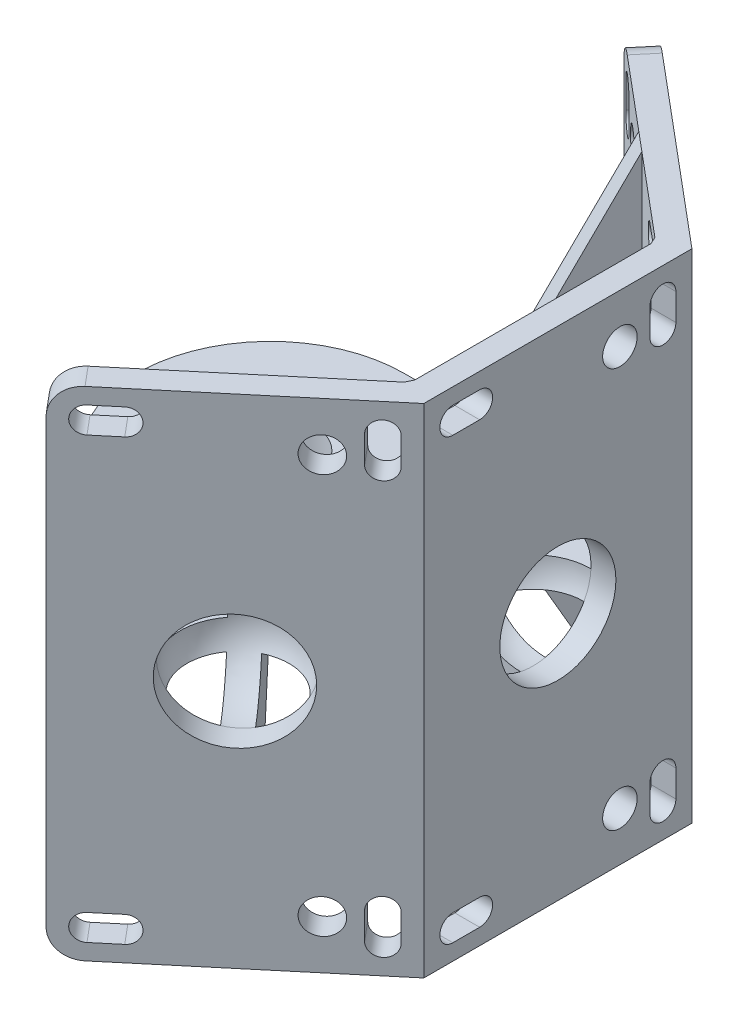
ISO-10303-21;
HEADER;
FILE_DESCRIPTION(('STEP AP214'),'2;1');
FILE_NAME('part.step','',(''),(''),'','','');
FILE_SCHEMA(('AUTOMOTIVE_DESIGN { 1 0 10303 214 1 1 1 1 }'));
ENDSEC;
DATA;
#1=APPLICATION_CONTEXT('core data for automotive mechanical design processes');
#2=APPLICATION_PROTOCOL_DEFINITION('international standard','automotive_design',2000,#1);
#3=PRODUCT_CONTEXT('',#1,'mechanical');
#4=PRODUCT('Part','Part','',(#3));
#5=PRODUCT_RELATED_PRODUCT_CATEGORY('part','',(#4));
#6=PRODUCT_DEFINITION_FORMATION('','',#4);
#7=PRODUCT_DEFINITION_CONTEXT('part definition',#1,'design');
#8=PRODUCT_DEFINITION('design','',#6,#7);
#9=PRODUCT_DEFINITION_SHAPE('','',#8);
#10=(LENGTH_UNIT() NAMED_UNIT(*) SI_UNIT(.MILLI.,.METRE.));
#11=(NAMED_UNIT(*) PLANE_ANGLE_UNIT() SI_UNIT($,.RADIAN.));
#12=(NAMED_UNIT(*) SI_UNIT($,.STERADIAN.) SOLID_ANGLE_UNIT());
#13=UNCERTAINTY_MEASURE_WITH_UNIT(LENGTH_MEASURE(1.E-05),#10,'distance_accuracy_value','');
#14=(GEOMETRIC_REPRESENTATION_CONTEXT(3) GLOBAL_UNCERTAINTY_ASSIGNED_CONTEXT((#13)) GLOBAL_UNIT_ASSIGNED_CONTEXT((#10,
#11,#12)) REPRESENTATION_CONTEXT('',''));
#15=CARTESIAN_POINT('',(0.,0.,0.));
#16=DIRECTION('',(0.,0.,1.));
#17=DIRECTION('',(1.,0.,0.));
#18=AXIS2_PLACEMENT_3D('',#15,#16,#17);
#19=CARTESIAN_POINT('',(0.,2.286,0.));
#20=DIRECTION('',(0.,1.,0.));
#21=DIRECTION('',(0.,0.,1.));
#22=AXIS2_PLACEMENT_3D('',#19,#20,#21);
#23=PLANE('',#22);
#24=DIRECTION('',(-0.422618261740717,0.,0.906307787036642));
#25=VECTOR('',#24,1.);
#26=CARTESIAN_POINT('',(23.9765205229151,2.286,11.1804351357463));
#27=LINE('',#26,#25);
#28=CARTESIAN_POINT('',(24.1321807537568,2.286,10.846620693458));
#29=VERTEX_POINT('',#28);
#30=CARTESIAN_POINT('',(23.8208602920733,2.286,11.5142495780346));
#31=VERTEX_POINT('',#30);
#32=EDGE_CURVE('E1525',#29,#31,#27,.T.);
#33=ORIENTED_EDGE('',*,*,#32,.F.);
#34=DIRECTION('',(0.,0.,1.));
#35=VECTOR('',#34,1.);
#36=CARTESIAN_POINT('',(24.1321807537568,2.286,11.2530206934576));
#37=LINE('',#36,#35);
#38=CARTESIAN_POINT('',(24.1321807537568,2.286,5.32794894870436));
#39=VERTEX_POINT('',#38);
#40=EDGE_CURVE('E755',#39,#29,#37,.T.);
#41=ORIENTED_EDGE('',*,*,#40,.F.);
#42=CARTESIAN_POINT('',(24.1321807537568,2.286,0.));
#43=DIRECTION('',(0.,1.,0.));
#44=DIRECTION('',(0.,0.,1.));
#45=AXIS2_PLACEMENT_3D('',#42,#43,#44);
#46=CIRCLE('',#45,5.32794894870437);
#47=CARTESIAN_POINT('',(18.9282792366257,2.286,1.143));
#48=VERTEX_POINT('',#47);
#49=EDGE_CURVE('E1620',#39,#48,#46,.F.);
#50=ORIENTED_EDGE('',*,*,#49,.T.);
#51=DIRECTION('',(1.,0.,0.));
#52=VECTOR('',#51,1.);
#53=CARTESIAN_POINT('',(24.1321807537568,2.286,1.143));
#54=LINE('',#53,#52);
#55=CARTESIAN_POINT('',(12.7021807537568,2.286,1.143));
#56=VERTEX_POINT('',#55);
#57=EDGE_CURVE('E1586',#56,#48,#54,.T.);
#58=ORIENTED_EDGE('',*,*,#57,.F.);
#59=DIRECTION('',(0.,0.,1.));
#60=VECTOR('',#59,1.);
#61=CARTESIAN_POINT('',(12.7021807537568,2.286,-1.143));
#62=LINE('',#61,#60);
#63=CARTESIAN_POINT('',(12.7021807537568,2.286,-1.143));
#64=VERTEX_POINT('',#63);
#65=EDGE_CURVE('E1584',#64,#56,#62,.T.);
#66=ORIENTED_EDGE('',*,*,#65,.F.);
#67=DIRECTION('',(-1.,0.,0.));
#68=VECTOR('',#67,1.);
#69=CARTESIAN_POINT('',(24.1321807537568,2.286,-1.143));
#70=LINE('',#69,#68);
#71=CARTESIAN_POINT('',(18.9282792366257,2.286,-1.143));
#72=VERTEX_POINT('',#71);
#73=EDGE_CURVE('E1582',#72,#64,#70,.T.);
#74=ORIENTED_EDGE('',*,*,#73,.F.);
#75=CARTESIAN_POINT('',(24.1321807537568,2.286,-5.32794894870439));
#76=VERTEX_POINT('',#75);
#77=EDGE_CURVE('E1624',#72,#76,#46,.F.);
#78=ORIENTED_EDGE('',*,*,#77,.T.);
#79=CARTESIAN_POINT('',(24.1321807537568,2.286,-10.8466206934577));
#80=VERTEX_POINT('',#79);
#81=EDGE_CURVE('E757',#80,#76,#37,.T.);
#82=ORIENTED_EDGE('',*,*,#81,.F.);
#83=DIRECTION('',(0.4226182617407,0.,0.90630778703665));
#84=VECTOR('',#83,1.);
#85=CARTESIAN_POINT('',(23.9765205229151,2.286,-11.1804351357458));
#86=LINE('',#85,#84);
#87=CARTESIAN_POINT('',(23.8208602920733,2.286,-11.5142495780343));
#88=VERTEX_POINT('',#87);
#89=EDGE_CURVE('E1509',#88,#80,#86,.T.);
#90=ORIENTED_EDGE('',*,*,#89,.F.);
#91=DIRECTION('',(0.766044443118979,0.,0.642787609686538));
#92=VECTOR('',#91,1.);
#93=CARTESIAN_POINT('',(24.1321807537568,2.286,-11.2530206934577));
#94=LINE('',#93,#92);
#95=CARTESIAN_POINT('',(19.5933124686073,2.286,-15.0615833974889));
#96=VERTEX_POINT('',#95);
#97=EDGE_CURVE('E756',#96,#88,#94,.T.);
#98=ORIENTED_EDGE('',*,*,#97,.F.);
#99=CARTESIAN_POINT('',(15.5118667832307,2.286,-18.4863229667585));
#100=DIRECTION('',(0.,1.,0.));
#101=DIRECTION('',(0.,0.,1.));
#102=AXIS2_PLACEMENT_3D('',#99,#100,#101);
#103=CIRCLE('',#102,5.32794894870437);
#104=CARTESIAN_POINT('',(13.0424521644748,2.286,-13.76519688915));
#105=VERTEX_POINT('',#104);
#106=EDGE_CURVE('E1501',#96,#105,#103,.F.);
#107=ORIENTED_EDGE('',*,*,#106,.T.);
#108=DIRECTION('',(0.642787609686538,0.,-0.766044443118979));
#109=VECTOR('',#108,1.);
#110=CARTESIAN_POINT('',(9.04039320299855,2.286,-8.99572874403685));
#111=LINE('',#110,#109);
#112=CARTESIAN_POINT('',(9.04039320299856,2.286,-8.99572874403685));
#113=VERTEX_POINT('',#112);
#114=EDGE_CURVE('E1569',#113,#105,#111,.T.);
#115=ORIENTED_EDGE('',*,*,#114,.F.);
#116=DIRECTION('',(0.766044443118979,0.,0.642787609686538));
#117=VECTOR('',#116,1.);
#118=CARTESIAN_POINT('',(7.28921560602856,2.286,-10.4651412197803));
#119=LINE('',#118,#117);
#120=CARTESIAN_POINT('',(7.28921560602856,2.286,-10.4651412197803));
#121=VERTEX_POINT('',#120);
#122=EDGE_CURVE('E1574',#121,#113,#119,.T.);
#123=ORIENTED_EDGE('',*,*,#122,.F.);
#124=DIRECTION('',(-0.642787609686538,0.,0.766044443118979));
#125=VECTOR('',#124,1.);
#126=CARTESIAN_POINT('',(14.6362779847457,2.286,-19.2210292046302));
#127=LINE('',#126,#125);
#128=CARTESIAN_POINT('',(11.2912745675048,2.286,-15.2346093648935));
#129=VERTEX_POINT('',#128);
#130=EDGE_CURVE('E1572',#129,#121,#127,.T.);
#131=ORIENTED_EDGE('',*,*,#130,.F.);
#132=CARTESIAN_POINT('',(11.4304210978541,2.286,-21.9110625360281));
#133=VERTEX_POINT('',#132);
#134=EDGE_CURVE('E1427',#129,#133,#103,.F.);
#135=ORIENTED_EDGE('',*,*,#134,.T.);
#136=CARTESIAN_POINT('',(6.07496528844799,2.286,-26.4048235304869));
#137=VERTEX_POINT('',#136);
#138=EDGE_CURVE('E752',#137,#133,#94,.T.);
#139=ORIENTED_EDGE('',*,*,#138,.F.);
#140=DIRECTION('',(0.,0.,-1.));
#141=VECTOR('',#140,1.);
#142=CARTESIAN_POINT('',(6.07496528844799,2.286,-26.4048235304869));
#143=LINE('',#142,#141);
#144=CARTESIAN_POINT('',(6.07496528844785,2.286,-12.2936));
#145=VERTEX_POINT('',#144);
#146=EDGE_CURVE('E765',#145,#137,#143,.T.);
#147=ORIENTED_EDGE('',*,*,#146,.F.);
#148=DIRECTION('',(-1.,0.,0.));
#149=VECTOR('',#148,1.);
#150=CARTESIAN_POINT('',(0.,2.286,-12.2936));
#151=LINE('',#150,#149);
#152=CARTESIAN_POINT('',(0.,2.286,-12.2936));
#153=VERTEX_POINT('',#152);
#154=EDGE_CURVE('E823',#145,#153,#151,.T.);
#155=ORIENTED_EDGE('',*,*,#154,.T.);
#156=CARTESIAN_POINT('',(0.,2.286,0.));
#157=DIRECTION('',(0.,1.,0.));
#158=DIRECTION('',(0.,0.,1.));
#159=AXIS2_PLACEMENT_3D('',#156,#157,#158);
#160=CIRCLE('',#159,12.2936);
#161=CARTESIAN_POINT('',(0.,2.286,12.2936));
#162=VERTEX_POINT('',#161);
#163=EDGE_CURVE('E816',#153,#162,#160,.T.);
#164=ORIENTED_EDGE('',*,*,#163,.T.);
#165=DIRECTION('',(1.,0.,0.));
#166=VECTOR('',#165,1.);
#167=CARTESIAN_POINT('',(0.,2.286,12.2936));
#168=LINE('',#167,#166);
#169=CARTESIAN_POINT('',(6.07496528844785,2.286,12.2936));
#170=VERTEX_POINT('',#169);
#171=EDGE_CURVE('E819',#162,#170,#168,.T.);
#172=ORIENTED_EDGE('',*,*,#171,.T.);
#173=DIRECTION('',(0.,0.,-1.));
#174=VECTOR('',#173,1.);
#175=CARTESIAN_POINT('',(6.07496528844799,2.286,12.2936));
#176=LINE('',#175,#174);
#177=CARTESIAN_POINT('',(6.07496528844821,2.286,26.404823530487));
#178=VERTEX_POINT('',#177);
#179=EDGE_CURVE('E762',#178,#170,#176,.T.);
#180=ORIENTED_EDGE('',*,*,#179,.F.);
#181=DIRECTION('',(-0.766044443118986,0.,0.64278760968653));
#182=VECTOR('',#181,1.);
#183=CARTESIAN_POINT('',(6.07496528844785,2.286,26.4048235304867));
#184=LINE('',#183,#182);
#185=CARTESIAN_POINT('',(11.4304210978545,2.286,21.9110625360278));
#186=VERTEX_POINT('',#185);
#187=EDGE_CURVE('E759',#186,#178,#184,.T.);
#188=ORIENTED_EDGE('',*,*,#187,.F.);
#189=CARTESIAN_POINT('',(15.5118667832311,2.286,18.4863229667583));
#190=DIRECTION('',(0.,1.,0.));
#191=DIRECTION('',(0.,0.,1.));
#192=AXIS2_PLACEMENT_3D('',#189,#190,#191);
#193=CIRCLE('',#192,5.32794894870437);
#194=CARTESIAN_POINT('',(11.2912745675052,2.286,15.2346093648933));
#195=VERTEX_POINT('',#194);
#196=EDGE_CURVE('E1459',#186,#195,#193,.F.);
#197=ORIENTED_EDGE('',*,*,#196,.T.);
#198=DIRECTION('',(0.642787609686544,0.,0.766044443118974));
#199=VECTOR('',#198,1.);
#200=CARTESIAN_POINT('',(7.28921560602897,2.286,10.4651412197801));
#201=LINE('',#200,#199);
#202=CARTESIAN_POINT('',(7.28921560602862,2.286,10.4651412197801));
#203=VERTEX_POINT('',#202);
#204=EDGE_CURVE('E1559',#203,#195,#201,.T.);
#205=ORIENTED_EDGE('',*,*,#204,.F.);
#206=DIRECTION('',(-0.766044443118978,0.,0.64278760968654));
#207=VECTOR('',#206,1.);
#208=CARTESIAN_POINT('',(9.04039320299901,2.286,8.99572874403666));
#209=LINE('',#208,#207);
#210=CARTESIAN_POINT('',(9.04039320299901,2.286,8.99572874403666));
#211=VERTEX_POINT('',#210);
#212=EDGE_CURVE('E1563',#211,#203,#209,.T.);
#213=ORIENTED_EDGE('',*,*,#212,.F.);
#214=DIRECTION('',(-0.642787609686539,0.,-0.766044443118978));
#215=VECTOR('',#214,1.);
#216=CARTESIAN_POINT('',(16.3874555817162,2.286,17.7516167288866));
#217=LINE('',#216,#215);
#218=CARTESIAN_POINT('',(13.0424521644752,2.286,13.7651968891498));
#219=VERTEX_POINT('',#218);
#220=EDGE_CURVE('E1561',#219,#211,#217,.T.);
#221=ORIENTED_EDGE('',*,*,#220,.F.);
#222=CARTESIAN_POINT('',(19.5933124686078,2.286,15.0615833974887));
#223=VERTEX_POINT('',#222);
#224=EDGE_CURVE('E1483',#219,#223,#193,.F.);
#225=ORIENTED_EDGE('',*,*,#224,.T.);
#226=EDGE_CURVE('E760',#31,#223,#184,.T.);
#227=ORIENTED_EDGE('',*,*,#226,.F.);
#228=EDGE_LOOP('',(#33,#41,#50,#58,#66,#74,#78,#82,#90,#98,#107,#115,#123,#131,#135,#139,#147,
#155,#164,#172,#180,#188,#197,#205,#213,#221,#225,#227));
#229=FACE_BOUND('',#228,.T.);
#230=CARTESIAN_POINT('',(8.3312,2.286,0.));
#231=DIRECTION('',(0.,1.,0.));
#232=DIRECTION('',(0.,0.,1.));
#233=AXIS2_PLACEMENT_3D('',#230,#231,#232);
#234=CIRCLE('',#233,1.1938);
#235=CARTESIAN_POINT('',(8.3312,2.286,1.1938));
#236=VERTEX_POINT('',#235);
#237=EDGE_CURVE('E786',#236,#236,#234,.T.);
#238=ORIENTED_EDGE('',*,*,#237,.F.);
#239=EDGE_LOOP('',(#238));
#240=FACE_BOUND('',#239,.T.);
#241=CARTESIAN_POINT('',(-8.3312,2.286,0.));
#242=DIRECTION('',(0.,1.,0.));
#243=DIRECTION('',(0.,0.,1.));
#244=AXIS2_PLACEMENT_3D('',#241,#242,#243);
#245=CIRCLE('',#244,1.1938);
#246=CARTESIAN_POINT('',(-8.3312,2.286,1.1938));
#247=VERTEX_POINT('',#246);
#248=EDGE_CURVE('E798',#247,#247,#245,.T.);
#249=ORIENTED_EDGE('',*,*,#248,.F.);
#250=EDGE_LOOP('',(#249));
#251=FACE_BOUND('',#250,.T.);
#252=CARTESIAN_POINT('',(0.,2.286,0.));
#253=DIRECTION('',(0.,1.,0.));
#254=DIRECTION('',(0.,0.,1.));
#255=AXIS2_PLACEMENT_3D('',#252,#253,#254);
#256=CIRCLE('',#255,4.0005);
#257=CARTESIAN_POINT('',(0.,2.286,4.0005));
#258=VERTEX_POINT('',#257);
#259=EDGE_CURVE('E810',#258,#258,#256,.T.);
#260=ORIENTED_EDGE('',*,*,#259,.F.);
#261=EDGE_LOOP('',(#260));
#262=FACE_BOUND('',#261,.T.);
#263=CARTESIAN_POINT('',(0.,2.286,-8.3312));
#264=DIRECTION('',(0.,1.,0.));
#265=DIRECTION('',(0.,0.,1.));
#266=AXIS2_PLACEMENT_3D('',#263,#264,#265);
#267=CIRCLE('',#266,1.1938);
#268=CARTESIAN_POINT('',(0.,2.286,-7.1374));
#269=VERTEX_POINT('',#268);
#270=EDGE_CURVE('E804',#269,#269,#267,.T.);
#271=ORIENTED_EDGE('',*,*,#270,.F.);
#272=EDGE_LOOP('',(#271));
#273=FACE_BOUND('',#272,.T.);
#274=CARTESIAN_POINT('',(0.,2.286,8.3312));
#275=DIRECTION('',(0.,1.,0.));
#276=DIRECTION('',(0.,0.,1.));
#277=AXIS2_PLACEMENT_3D('',#274,#275,#276);
#278=CIRCLE('',#277,1.1938);
#279=CARTESIAN_POINT('',(0.,2.286,9.525));
#280=VERTEX_POINT('',#279);
#281=EDGE_CURVE('E792',#280,#280,#278,.T.);
#282=ORIENTED_EDGE('',*,*,#281,.F.);
#283=EDGE_LOOP('',(#282));
#284=FACE_BOUND('',#283,.T.);
#285=ADVANCED_FACE('F33',(#229,#240,#251,#262,#273,#284),#23,.T.);
#286=CARTESIAN_POINT('',(0.,0.,0.));
#287=DIRECTION('',(0.,1.,0.));
#288=DIRECTION('',(0.,0.,1.));
#289=AXIS2_PLACEMENT_3D('',#286,#287,#288);
#290=PLANE('',#289);
#291=CARTESIAN_POINT('',(0.,0.,8.3312));
#292=DIRECTION('',(0.,1.,0.));
#293=DIRECTION('',(0.,0.,1.));
#294=AXIS2_PLACEMENT_3D('',#291,#292,#293);
#295=CIRCLE('',#294,1.1938);
#296=CARTESIAN_POINT('',(0.,0.,9.525));
#297=VERTEX_POINT('',#296);
#298=EDGE_CURVE('E789',#297,#297,#295,.T.);
#299=ORIENTED_EDGE('',*,*,#298,.T.);
#300=EDGE_LOOP('',(#299));
#301=FACE_BOUND('',#300,.T.);
#302=CARTESIAN_POINT('',(0.,0.,-8.3312));
#303=DIRECTION('',(0.,1.,0.));
#304=DIRECTION('',(0.,0.,1.));
#305=AXIS2_PLACEMENT_3D('',#302,#303,#304);
#306=CIRCLE('',#305,1.1938);
#307=CARTESIAN_POINT('',(0.,0.,-7.1374));
#308=VERTEX_POINT('',#307);
#309=EDGE_CURVE('E801',#308,#308,#306,.T.);
#310=ORIENTED_EDGE('',*,*,#309,.T.);
#311=EDGE_LOOP('',(#310));
#312=FACE_BOUND('',#311,.T.);
#313=CARTESIAN_POINT('',(0.,0.,0.));
#314=DIRECTION('',(0.,1.,0.));
#315=DIRECTION('',(0.,0.,1.));
#316=AXIS2_PLACEMENT_3D('',#313,#314,#315);
#317=CIRCLE('',#316,4.0005);
#318=CARTESIAN_POINT('',(0.,0.,4.0005));
#319=VERTEX_POINT('',#318);
#320=EDGE_CURVE('E807',#319,#319,#317,.T.);
#321=ORIENTED_EDGE('',*,*,#320,.T.);
#322=EDGE_LOOP('',(#321));
#323=FACE_BOUND('',#322,.T.);
#324=CARTESIAN_POINT('',(-8.3312,0.,0.));
#325=DIRECTION('',(0.,1.,0.));
#326=DIRECTION('',(0.,0.,1.));
#327=AXIS2_PLACEMENT_3D('',#324,#325,#326);
#328=CIRCLE('',#327,1.1938);
#329=CARTESIAN_POINT('',(-8.3312,0.,1.1938));
#330=VERTEX_POINT('',#329);
#331=EDGE_CURVE('E795',#330,#330,#328,.T.);
#332=ORIENTED_EDGE('',*,*,#331,.T.);
#333=EDGE_LOOP('',(#332));
#334=FACE_BOUND('',#333,.T.);
#335=CARTESIAN_POINT('',(8.3312,0.,0.));
#336=DIRECTION('',(0.,1.,0.));
#337=DIRECTION('',(0.,0.,1.));
#338=AXIS2_PLACEMENT_3D('',#335,#336,#337);
#339=CIRCLE('',#338,1.1938);
#340=CARTESIAN_POINT('',(8.3312,0.,1.1938));
#341=VERTEX_POINT('',#340);
#342=EDGE_CURVE('E777',#341,#341,#339,.T.);
#343=ORIENTED_EDGE('',*,*,#342,.T.);
#344=EDGE_LOOP('',(#343));
#345=FACE_BOUND('',#344,.T.);
#346=DIRECTION('',(0.,0.,-1.));
#347=VECTOR('',#346,1.);
#348=CARTESIAN_POINT('',(24.1321807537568,0.,-11.2530206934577));
#349=LINE('',#348,#347);
#350=CARTESIAN_POINT('',(24.1321807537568,0.,10.846620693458));
#351=VERTEX_POINT('',#350);
#352=CARTESIAN_POINT('',(24.1321807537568,0.,4.69041106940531));
#353=VERTEX_POINT('',#352);
#354=EDGE_CURVE('E715',#351,#353,#349,.T.);
#355=ORIENTED_EDGE('',*,*,#354,.F.);
#356=DIRECTION('',(-0.422618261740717,0.,0.906307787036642));
#357=VECTOR('',#356,1.);
#358=CARTESIAN_POINT('',(23.9765205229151,0.,11.1804351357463));
#359=LINE('',#358,#357);
#360=CARTESIAN_POINT('',(23.8208602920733,0.,11.5142495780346));
#361=VERTEX_POINT('',#360);
#362=EDGE_CURVE('E1528',#351,#361,#359,.T.);
#363=ORIENTED_EDGE('',*,*,#362,.T.);
#364=DIRECTION('',(0.766044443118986,0.,-0.64278760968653));
#365=VECTOR('',#364,1.);
#366=CARTESIAN_POINT('',(24.1321807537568,0.,11.2530206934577));
#367=LINE('',#366,#365);
#368=CARTESIAN_POINT('',(19.1049301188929,0.,15.471384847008));
#369=VERTEX_POINT('',#368);
#370=EDGE_CURVE('E680',#369,#361,#367,.T.);
#371=ORIENTED_EDGE('',*,*,#370,.F.);
#372=CARTESIAN_POINT('',(15.5118667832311,0.,18.4863229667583));
#373=DIRECTION('',(0.,1.,0.));
#374=DIRECTION('',(0.,0.,1.));
#375=AXIS2_PLACEMENT_3D('',#372,#373,#374);
#376=CIRCLE('',#375,4.69041106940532);
#377=CARTESIAN_POINT('',(13.4634072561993,0.,14.2668716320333));
#378=VERTEX_POINT('',#377);
#379=EDGE_CURVE('E1485',#378,#369,#376,.F.);
#380=ORIENTED_EDGE('',*,*,#379,.F.);
#381=DIRECTION('',(0.642787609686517,0.,0.766044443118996));
#382=VECTOR('',#381,1.);
#383=CARTESIAN_POINT('',(16.3874555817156,0.,17.7516167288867));
#384=LINE('',#383,#382);
#385=CARTESIAN_POINT('',(9.04039320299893,0.,8.9957287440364));
#386=VERTEX_POINT('',#385);
#387=EDGE_CURVE('E916',#386,#378,#384,.T.);
#388=ORIENTED_EDGE('',*,*,#387,.F.);
#389=DIRECTION('',(0.766044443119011,0.,-0.6427876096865));
#390=VECTOR('',#389,1.);
#391=CARTESIAN_POINT('',(9.0403932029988,0.,8.9957287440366));
#392=LINE('',#391,#390);
#393=CARTESIAN_POINT('',(7.28921560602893,0.,10.4651412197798));
#394=VERTEX_POINT('',#393);
#395=EDGE_CURVE('E1607',#394,#386,#392,.T.);
#396=ORIENTED_EDGE('',*,*,#395,.F.);
#397=DIRECTION('',(-0.642787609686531,0.,-0.766044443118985));
#398=VECTOR('',#397,1.);
#399=CARTESIAN_POINT('',(7.28921560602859,0.,10.4651412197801));
#400=LINE('',#399,#398);
#401=CARTESIAN_POINT('',(11.7122296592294,0.,15.7362841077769));
#402=VERTEX_POINT('',#401);
#403=EDGE_CURVE('E912',#402,#394,#400,.T.);
#404=ORIENTED_EDGE('',*,*,#403,.F.);
#405=CARTESIAN_POINT('',(11.9188034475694,0.,21.5012610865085));
#406=VERTEX_POINT('',#405);
#407=EDGE_CURVE('E1453',#406,#402,#376,.F.);
#408=ORIENTED_EDGE('',*,*,#407,.F.);
#409=CARTESIAN_POINT('',(6.07496528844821,0.,26.404823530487));
#410=VERTEX_POINT('',#409);
#411=EDGE_CURVE('E711',#410,#406,#367,.T.);
#412=ORIENTED_EDGE('',*,*,#411,.F.);
#413=DIRECTION('',(0.,0.,-1.));
#414=VECTOR('',#413,1.);
#415=CARTESIAN_POINT('',(6.07496528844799,0.,12.2936));
#416=LINE('',#415,#414);
#417=CARTESIAN_POINT('',(6.07496528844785,0.,12.2936));
#418=VERTEX_POINT('',#417);
#419=EDGE_CURVE('E751',#410,#418,#416,.T.);
#420=ORIENTED_EDGE('',*,*,#419,.T.);
#421=DIRECTION('',(1.,0.,0.));
#422=VECTOR('',#421,1.);
#423=CARTESIAN_POINT('',(0.,0.,12.2936));
#424=LINE('',#423,#422);
#425=CARTESIAN_POINT('',(0.,0.,12.2936));
#426=VERTEX_POINT('',#425);
#427=EDGE_CURVE('E828',#426,#418,#424,.T.);
#428=ORIENTED_EDGE('',*,*,#427,.F.);
#429=CARTESIAN_POINT('',(0.,0.,0.));
#430=DIRECTION('',(0.,1.,0.));
#431=DIRECTION('',(0.,0.,1.));
#432=AXIS2_PLACEMENT_3D('',#429,#430,#431);
#433=CIRCLE('',#432,12.2936);
#434=CARTESIAN_POINT('',(0.,0.,-12.2936));
#435=VERTEX_POINT('',#434);
#436=EDGE_CURVE('E813',#435,#426,#433,.T.);
#437=ORIENTED_EDGE('',*,*,#436,.F.);
#438=DIRECTION('',(-1.,0.,0.));
#439=VECTOR('',#438,1.);
#440=CARTESIAN_POINT('',(0.,0.,-12.2936));
#441=LINE('',#440,#439);
#442=CARTESIAN_POINT('',(6.07496528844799,0.,-12.2936));
#443=VERTEX_POINT('',#442);
#444=EDGE_CURVE('E820',#443,#435,#441,.T.);
#445=ORIENTED_EDGE('',*,*,#444,.F.);
#446=DIRECTION('',(0.,0.,-1.));
#447=VECTOR('',#446,1.);
#448=CARTESIAN_POINT('',(6.07496528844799,0.,-26.4048235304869));
#449=LINE('',#448,#447);
#450=CARTESIAN_POINT('',(6.07496528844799,0.,-26.4048235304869));
#451=VERTEX_POINT('',#450);
#452=EDGE_CURVE('E771',#443,#451,#449,.T.);
#453=ORIENTED_EDGE('',*,*,#452,.T.);
#454=DIRECTION('',(-0.766044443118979,0.,-0.642787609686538));
#455=VECTOR('',#454,1.);
#456=CARTESIAN_POINT('',(6.07496528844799,0.,-26.4048235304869));
#457=LINE('',#456,#455);
#458=CARTESIAN_POINT('',(11.918803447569,0.,-21.5012610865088));
#459=VERTEX_POINT('',#458);
#460=EDGE_CURVE('E691',#459,#451,#457,.T.);
#461=ORIENTED_EDGE('',*,*,#460,.F.);
#462=CARTESIAN_POINT('',(15.5118667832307,0.,-18.4863229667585));
#463=DIRECTION('',(0.,1.,0.));
#464=DIRECTION('',(0.,0.,1.));
#465=AXIS2_PLACEMENT_3D('',#462,#463,#464);
#466=CIRCLE('',#465,4.69041106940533);
#467=CARTESIAN_POINT('',(11.7122296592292,0.,-15.7362841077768));
#468=VERTEX_POINT('',#467);
#469=EDGE_CURVE('E1497',#468,#459,#466,.F.);
#470=ORIENTED_EDGE('',*,*,#469,.F.);
#471=DIRECTION('',(0.642787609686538,0.,-0.766044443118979));
#472=VECTOR('',#471,1.);
#473=CARTESIAN_POINT('',(14.6362779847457,0.,-19.2210292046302));
#474=LINE('',#473,#472);
#475=CARTESIAN_POINT('',(7.28921560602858,0.,-10.4651412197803));
#476=VERTEX_POINT('',#475);
#477=EDGE_CURVE('E1594',#476,#468,#474,.T.);
#478=ORIENTED_EDGE('',*,*,#477,.F.);
#479=DIRECTION('',(-0.76604444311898,0.,-0.642787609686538));
#480=VECTOR('',#479,1.);
#481=CARTESIAN_POINT('',(7.28921560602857,0.,-10.4651412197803));
#482=LINE('',#481,#480);
#483=CARTESIAN_POINT('',(9.04039320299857,0.,-8.99572874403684));
#484=VERTEX_POINT('',#483);
#485=EDGE_CURVE('E1599',#484,#476,#482,.T.);
#486=ORIENTED_EDGE('',*,*,#485,.F.);
#487=DIRECTION('',(-0.642787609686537,0.,0.76604444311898));
#488=VECTOR('',#487,1.);
#489=CARTESIAN_POINT('',(9.04039320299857,0.,-8.99572874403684));
#490=LINE('',#489,#488);
#491=CARTESIAN_POINT('',(13.4634072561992,0.,-14.2668716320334));
#492=VERTEX_POINT('',#491);
#493=EDGE_CURVE('E1597',#492,#484,#490,.T.);
#494=ORIENTED_EDGE('',*,*,#493,.F.);
#495=CARTESIAN_POINT('',(19.1049301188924,0.,-15.4713848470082));
#496=VERTEX_POINT('',#495);
#497=EDGE_CURVE('E1491',#496,#492,#466,.F.);
#498=ORIENTED_EDGE('',*,*,#497,.F.);
#499=CARTESIAN_POINT('',(23.8208602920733,0.,-11.5142495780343));
#500=VERTEX_POINT('',#499);
#501=EDGE_CURVE('E688',#500,#496,#457,.T.);
#502=ORIENTED_EDGE('',*,*,#501,.F.);
#503=DIRECTION('',(0.4226182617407,0.,0.90630778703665));
#504=VECTOR('',#503,1.);
#505=CARTESIAN_POINT('',(23.9765205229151,0.,-11.1804351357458));
#506=LINE('',#505,#504);
#507=CARTESIAN_POINT('',(24.1321807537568,0.,-10.8466206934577));
#508=VERTEX_POINT('',#507);
#509=EDGE_CURVE('E1513',#500,#508,#506,.T.);
#510=ORIENTED_EDGE('',*,*,#509,.T.);
#511=CARTESIAN_POINT('',(24.1321807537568,0.,-4.69041106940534));
#512=VERTEX_POINT('',#511);
#513=EDGE_CURVE('E714',#512,#508,#349,.T.);
#514=ORIENTED_EDGE('',*,*,#513,.F.);
#515=CARTESIAN_POINT('',(24.1321807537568,0.,0.));
#516=DIRECTION('',(0.,1.,0.));
#517=DIRECTION('',(0.,0.,1.));
#518=AXIS2_PLACEMENT_3D('',#515,#516,#517);
#519=CIRCLE('',#518,4.69041106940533);
#520=CARTESIAN_POINT('',(19.5831691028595,0.,-1.143));
#521=VERTEX_POINT('',#520);
#522=EDGE_CURVE('E1632',#521,#512,#519,.F.);
#523=ORIENTED_EDGE('',*,*,#522,.F.);
#524=DIRECTION('',(1.,0.,0.));
#525=VECTOR('',#524,1.);
#526=CARTESIAN_POINT('',(24.1321807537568,0.,-1.143));
#527=LINE('',#526,#525);
#528=CARTESIAN_POINT('',(12.7021807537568,0.,-1.143));
#529=VERTEX_POINT('',#528);
#530=EDGE_CURVE('E923',#529,#521,#527,.T.);
#531=ORIENTED_EDGE('',*,*,#530,.F.);
#532=DIRECTION('',(0.,0.,-1.));
#533=VECTOR('',#532,1.);
#534=CARTESIAN_POINT('',(12.7021807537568,0.,1.143));
#535=LINE('',#534,#533);
#536=CARTESIAN_POINT('',(12.7021807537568,0.,1.143));
#537=VERTEX_POINT('',#536);
#538=EDGE_CURVE('E921',#537,#529,#535,.T.);
#539=ORIENTED_EDGE('',*,*,#538,.F.);
#540=DIRECTION('',(-1.,0.,0.));
#541=VECTOR('',#540,1.);
#542=CARTESIAN_POINT('',(24.1321807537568,0.,1.143));
#543=LINE('',#542,#541);
#544=CARTESIAN_POINT('',(19.5831691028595,0.,1.143));
#545=VERTEX_POINT('',#544);
#546=EDGE_CURVE('E914',#545,#537,#543,.T.);
#547=ORIENTED_EDGE('',*,*,#546,.F.);
#548=EDGE_CURVE('E1638',#353,#545,#519,.F.);
#549=ORIENTED_EDGE('',*,*,#548,.F.);
#550=EDGE_LOOP('',(#355,#363,#371,#380,#388,#396,#404,#408,#412,#420,#428,#437,#445,#453,#461,
#470,#478,#486,#494,#498,#502,#510,#514,#523,#531,#539,#547,#549));
#551=FACE_BOUND('',#550,.T.);
#552=ADVANCED_FACE('F1450',(#301,#312,#323,#334,#345,#551),#290,.F.);
#553=CARTESIAN_POINT('',(14.6362779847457,-20.32,-19.2210292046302));
#554=DIRECTION('',(0.76604444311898,0.,0.642787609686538));
#555=DIRECTION('',(0.642787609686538,0.,-0.76604444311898));
#556=AXIS2_PLACEMENT_3D('',#553,#554,#555);
#557=PLANE('',#556);
#558=CARTESIAN_POINT('',(14.6362779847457,2.54,-19.2210292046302));
#559=DIRECTION('',(0.76604444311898,0.,0.642787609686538));
#560=DIRECTION('',(0.642787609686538,0.,-0.76604444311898));
#561=AXIS2_PLACEMENT_3D('',#558,#559,#560);
#562=CIRCLE('',#561,5.21009664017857);
#563=CARTESIAN_POINT('',(14.6362779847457,-2.67009664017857,-19.2210292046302));
#564=VERTEX_POINT('',#563);
#565=EDGE_CURVE('E1505',#564,#468,#562,.F.);
#566=ORIENTED_EDGE('',*,*,#565,.F.);
#567=DIRECTION('',(0.,1.,0.));
#568=VECTOR('',#567,1.);
#569=CARTESIAN_POINT('',(14.6362779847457,-20.32,-19.2210292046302));
#570=LINE('',#569,#568);
#571=CARTESIAN_POINT('',(14.6362779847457,-20.32,-19.2210292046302));
#572=VERTEX_POINT('',#571);
#573=EDGE_CURVE('E1604',#572,#564,#570,.T.);
#574=ORIENTED_EDGE('',*,*,#573,.F.);
#575=DIRECTION('',(0.315133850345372,-0.871575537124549,-0.375561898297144));
#576=VECTOR('',#575,1.);
#577=CARTESIAN_POINT('',(7.28921560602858,0.,-10.4651412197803));
#578=LINE('',#577,#576);
#579=EDGE_CURVE('E1653',#476,#572,#578,.T.);
#580=ORIENTED_EDGE('',*,*,#579,.F.);
#581=ORIENTED_EDGE('',*,*,#477,.T.);
#582=EDGE_LOOP('',(#566,#574,#580,#581));
#583=FACE_BOUND('',#582,.T.);
#584=ADVANCED_FACE('F1751',(#583),#557,.F.);
#585=CARTESIAN_POINT('',(9.04039320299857,-20.32,-8.99572874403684));
#586=DIRECTION('',(-0.76604444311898,0.,-0.642787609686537));
#587=DIRECTION('',(-0.642787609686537,0.,0.76604444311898));
#588=AXIS2_PLACEMENT_3D('',#585,#586,#587);
#589=PLANE('',#588);
#590=CARTESIAN_POINT('',(16.3874555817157,2.54,-17.7516167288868));
#591=DIRECTION('',(-0.76604444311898,0.,-0.642787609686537));
#592=DIRECTION('',(-0.642787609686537,0.,0.76604444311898));
#593=AXIS2_PLACEMENT_3D('',#590,#591,#592);
#594=CIRCLE('',#593,5.21009664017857);
#595=CARTESIAN_POINT('',(16.3874555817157,-2.67009664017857,-17.7516167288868));
#596=VERTEX_POINT('',#595);
#597=EDGE_CURVE('E1495',#492,#596,#594,.F.);
#598=ORIENTED_EDGE('',*,*,#597,.F.);
#599=ORIENTED_EDGE('',*,*,#493,.T.);
#600=DIRECTION('',(0.315133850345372,-0.871575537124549,-0.375561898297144));
#601=VECTOR('',#600,1.);
#602=CARTESIAN_POINT('',(9.04039320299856,0.,-8.99572874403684));
#603=LINE('',#602,#601);
#604=CARTESIAN_POINT('',(16.3874555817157,-20.32,-17.7516167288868));
#605=VERTEX_POINT('',#604);
#606=EDGE_CURVE('E1654',#484,#605,#603,.T.);
#607=ORIENTED_EDGE('',*,*,#606,.T.);
#608=DIRECTION('',(0.,1.,0.));
#609=VECTOR('',#608,1.);
#610=CARTESIAN_POINT('',(16.3874555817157,-20.32,-17.7516167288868));
#611=LINE('',#610,#609);
#612=EDGE_CURVE('E1601',#605,#596,#611,.T.);
#613=ORIENTED_EDGE('',*,*,#612,.T.);
#614=EDGE_LOOP('',(#598,#599,#607,#613));
#615=FACE_BOUND('',#614,.T.);
#616=ADVANCED_FACE('F1793',(#615),#589,.F.);
#617=CARTESIAN_POINT('',(9.04039320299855,25.4,-8.99572874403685));
#618=DIRECTION('',(-0.766044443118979,0.,-0.642787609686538));
#619=DIRECTION('',(-0.642787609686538,0.,0.766044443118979));
#620=AXIS2_PLACEMENT_3D('',#617,#618,#619);
#621=PLANE('',#620);
#622=CARTESIAN_POINT('',(16.3874555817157,2.54,-17.7516167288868));
#623=DIRECTION('',(-0.766044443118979,0.,-0.642787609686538));
#624=DIRECTION('',(-0.642787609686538,0.,0.766044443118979));
#625=AXIS2_PLACEMENT_3D('',#622,#623,#624);
#626=CIRCLE('',#625,5.21009664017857);
#627=CARTESIAN_POINT('',(16.3874555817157,7.75009664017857,-17.7516167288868));
#628=VERTEX_POINT('',#627);
#629=EDGE_CURVE('E1504',#628,#105,#626,.F.);
#630=ORIENTED_EDGE('',*,*,#629,.F.);
#631=DIRECTION('',(0.,-1.,0.));
#632=VECTOR('',#631,1.);
#633=CARTESIAN_POINT('',(16.3874555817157,25.4,-17.7516167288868));
#634=LINE('',#633,#632);
#635=CARTESIAN_POINT('',(16.3874555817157,25.4,-17.7516167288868));
#636=VERTEX_POINT('',#635);
#637=EDGE_CURVE('E1579',#636,#628,#634,.T.);
#638=ORIENTED_EDGE('',*,*,#637,.F.);
#639=DIRECTION('',(0.284927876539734,0.896388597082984,-0.339563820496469));
#640=VECTOR('',#639,1.);
#641=CARTESIAN_POINT('',(9.04039320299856,2.286,-8.99572874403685));
#642=LINE('',#641,#640);
#643=EDGE_CURVE('E1661',#113,#636,#642,.T.);
#644=ORIENTED_EDGE('',*,*,#643,.F.);
#645=ORIENTED_EDGE('',*,*,#114,.T.);
#646=EDGE_LOOP('',(#630,#638,#644,#645));
#647=FACE_BOUND('',#646,.T.);
#648=ADVANCED_FACE('F1817',(#647),#621,.F.);
#649=CARTESIAN_POINT('',(14.6362779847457,25.4,-19.2210292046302));
#650=DIRECTION('',(0.766044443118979,0.,0.642787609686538));
#651=DIRECTION('',(0.642787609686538,0.,-0.766044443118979));
#652=AXIS2_PLACEMENT_3D('',#649,#650,#651);
#653=PLANE('',#652);
#654=CARTESIAN_POINT('',(14.6362779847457,2.54,-19.2210292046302));
#655=DIRECTION('',(0.766044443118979,0.,0.642787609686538));
#656=DIRECTION('',(0.642787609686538,0.,-0.766044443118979));
#657=AXIS2_PLACEMENT_3D('',#654,#655,#656);
#658=CIRCLE('',#657,5.21009664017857);
#659=CARTESIAN_POINT('',(14.6362779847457,7.75009664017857,-19.2210292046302));
#660=VERTEX_POINT('',#659);
#661=EDGE_CURVE('E855',#129,#660,#658,.F.);
#662=ORIENTED_EDGE('',*,*,#661,.F.);
#663=ORIENTED_EDGE('',*,*,#130,.T.);
#664=DIRECTION('',(0.284927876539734,0.896388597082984,-0.339563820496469));
#665=VECTOR('',#664,1.);
#666=CARTESIAN_POINT('',(7.28921560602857,2.286,-10.4651412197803));
#667=LINE('',#666,#665);
#668=CARTESIAN_POINT('',(14.6362779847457,25.4,-19.2210292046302));
#669=VERTEX_POINT('',#668);
#670=EDGE_CURVE('E1662',#121,#669,#667,.T.);
#671=ORIENTED_EDGE('',*,*,#670,.T.);
#672=DIRECTION('',(0.,-1.,0.));
#673=VECTOR('',#672,1.);
#674=CARTESIAN_POINT('',(14.6362779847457,25.4,-19.2210292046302));
#675=LINE('',#674,#673);
#676=EDGE_CURVE('E1576',#669,#660,#675,.T.);
#677=ORIENTED_EDGE('',*,*,#676,.T.);
#678=EDGE_LOOP('',(#662,#663,#671,#677));
#679=FACE_BOUND('',#678,.T.);
#680=ADVANCED_FACE('F1823',(#679),#653,.F.);
#681=CARTESIAN_POINT('',(16.3874555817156,-20.32,17.7516167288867));
#682=DIRECTION('',(-0.766044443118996,0.,0.642787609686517));
#683=DIRECTION('',(0.642787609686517,0.,0.766044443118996));
#684=AXIS2_PLACEMENT_3D('',#681,#682,#683);
#685=PLANE('',#684);
#686=CARTESIAN_POINT('',(16.3874555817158,2.54,17.7516167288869));
#687=DIRECTION('',(-0.766044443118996,0.,0.642787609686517));
#688=DIRECTION('',(0.642787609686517,0.,0.766044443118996));
#689=AXIS2_PLACEMENT_3D('',#686,#687,#688);
#690=CIRCLE('',#689,5.21009664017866);
#691=CARTESIAN_POINT('',(16.3874555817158,-2.67009664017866,17.7516167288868));
#692=VERTEX_POINT('',#691);
#693=EDGE_CURVE('E1490',#692,#378,#690,.F.);
#694=ORIENTED_EDGE('',*,*,#693,.F.);
#695=DIRECTION('',(0.,1.,0.));
#696=VECTOR('',#695,1.);
#697=CARTESIAN_POINT('',(16.3874555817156,-20.32,17.7516167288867));
#698=LINE('',#697,#696);
#699=CARTESIAN_POINT('',(16.387455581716,-20.32,17.7516167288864));
#700=VERTEX_POINT('',#699);
#701=EDGE_CURVE('E911',#700,#692,#698,.T.);
#702=ORIENTED_EDGE('',*,*,#701,.F.);
#703=DIRECTION('',(0.315133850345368,-0.871575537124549,0.375561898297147));
#704=VECTOR('',#703,1.);
#705=CARTESIAN_POINT('',(9.04039320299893,0.,8.9957287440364));
#706=LINE('',#705,#704);
#707=EDGE_CURVE('E1615',#386,#700,#706,.T.);
#708=ORIENTED_EDGE('',*,*,#707,.F.);
#709=ORIENTED_EDGE('',*,*,#387,.T.);
#710=EDGE_LOOP('',(#694,#702,#708,#709));
#711=FACE_BOUND('',#710,.T.);
#712=ADVANCED_FACE('F1613',(#711),#685,.F.);
#713=CARTESIAN_POINT('',(7.28921560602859,-20.32,10.4651412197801));
#714=DIRECTION('',(0.766044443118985,0.,-0.642787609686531));
#715=DIRECTION('',(-0.642787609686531,0.,-0.766044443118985));
#716=AXIS2_PLACEMENT_3D('',#713,#714,#715);
#717=PLANE('',#716);
#718=CARTESIAN_POINT('',(14.6362779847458,2.54,19.2210292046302));
#719=DIRECTION('',(0.766044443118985,0.,-0.642787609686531));
#720=DIRECTION('',(-0.642787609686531,0.,-0.766044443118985));
#721=AXIS2_PLACEMENT_3D('',#718,#719,#720);
#722=CIRCLE('',#721,5.21009664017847);
#723=CARTESIAN_POINT('',(14.6362779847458,-2.67009664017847,19.2210292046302));
#724=VERTEX_POINT('',#723);
#725=EDGE_CURVE('E1481',#402,#724,#722,.F.);
#726=ORIENTED_EDGE('',*,*,#725,.F.);
#727=ORIENTED_EDGE('',*,*,#403,.T.);
#728=DIRECTION('',(0.315133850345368,-0.871575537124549,0.375561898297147));
#729=VECTOR('',#728,1.);
#730=CARTESIAN_POINT('',(7.28921560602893,0.,10.4651412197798));
#731=LINE('',#730,#729);
#732=CARTESIAN_POINT('',(14.6362779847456,-20.32,19.2210292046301));
#733=VERTEX_POINT('',#732);
#734=EDGE_CURVE('E1641',#394,#733,#731,.T.);
#735=ORIENTED_EDGE('',*,*,#734,.T.);
#736=DIRECTION('',(0.,1.,0.));
#737=VECTOR('',#736,1.);
#738=CARTESIAN_POINT('',(14.6362779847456,-20.32,19.2210292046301));
#739=LINE('',#738,#737);
#740=EDGE_CURVE('E906',#733,#724,#739,.T.);
#741=ORIENTED_EDGE('',*,*,#740,.T.);
#742=EDGE_LOOP('',(#726,#727,#735,#741));
#743=FACE_BOUND('',#742,.T.);
#744=ADVANCED_FACE('F1737',(#743),#717,.F.);
#745=CARTESIAN_POINT('',(7.28921560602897,25.4,10.4651412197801));
#746=DIRECTION('',(0.766044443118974,0.,-0.642787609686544));
#747=DIRECTION('',(-0.642787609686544,0.,-0.766044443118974));
#748=AXIS2_PLACEMENT_3D('',#745,#746,#747);
#749=PLANE('',#748);
#750=CARTESIAN_POINT('',(14.6362779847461,2.54,19.22102920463));
#751=DIRECTION('',(0.766044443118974,0.,-0.642787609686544));
#752=DIRECTION('',(-0.642787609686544,0.,-0.766044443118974));
#753=AXIS2_PLACEMENT_3D('',#750,#751,#752);
#754=CIRCLE('',#753,5.21009664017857);
#755=CARTESIAN_POINT('',(14.6362779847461,7.75009664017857,19.22102920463));
#756=VERTEX_POINT('',#755);
#757=EDGE_CURVE('E1480',#756,#195,#754,.F.);
#758=ORIENTED_EDGE('',*,*,#757,.F.);
#759=DIRECTION('',(0.,-1.,0.));
#760=VECTOR('',#759,1.);
#761=CARTESIAN_POINT('',(14.6362779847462,25.4,19.22102920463));
#762=LINE('',#761,#760);
#763=CARTESIAN_POINT('',(14.6362779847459,25.4,19.2210292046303));
#764=VERTEX_POINT('',#763);
#765=EDGE_CURVE('E1470',#764,#756,#762,.T.);
#766=ORIENTED_EDGE('',*,*,#765,.F.);
#767=DIRECTION('',(0.284927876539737,0.896388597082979,0.33956382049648));
#768=VECTOR('',#767,1.);
#769=CARTESIAN_POINT('',(14.6362779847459,25.4,19.2210292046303));
#770=LINE('',#769,#768);
#771=EDGE_CURVE('E1545',#203,#764,#770,.T.);
#772=ORIENTED_EDGE('',*,*,#771,.F.);
#773=ORIENTED_EDGE('',*,*,#204,.T.);
#774=EDGE_LOOP('',(#758,#766,#772,#773));
#775=FACE_BOUND('',#774,.T.);
#776=ADVANCED_FACE('F1735',(#775),#749,.F.);
#777=CARTESIAN_POINT('',(16.3874555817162,25.4,17.7516167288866));
#778=DIRECTION('',(-0.766044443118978,0.,0.642787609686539));
#779=DIRECTION('',(0.642787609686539,0.,0.766044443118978));
#780=AXIS2_PLACEMENT_3D('',#777,#778,#779);
#781=PLANE('',#780);
#782=CARTESIAN_POINT('',(16.3874555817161,2.54,17.7516167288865));
#783=DIRECTION('',(-0.766044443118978,0.,0.642787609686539));
#784=DIRECTION('',(0.642787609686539,0.,0.766044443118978));
#785=AXIS2_PLACEMENT_3D('',#782,#783,#784);
#786=CIRCLE('',#785,5.21009664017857);
#787=CARTESIAN_POINT('',(16.3874555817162,7.75009664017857,17.7516167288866));
#788=VERTEX_POINT('',#787);
#789=EDGE_CURVE('E853',#219,#788,#786,.F.);
#790=ORIENTED_EDGE('',*,*,#789,.F.);
#791=ORIENTED_EDGE('',*,*,#220,.T.);
#792=DIRECTION('',(0.284927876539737,0.896388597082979,0.33956382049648));
#793=VECTOR('',#792,1.);
#794=CARTESIAN_POINT('',(16.3874555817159,25.4,17.7516167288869));
#795=LINE('',#794,#793);
#796=CARTESIAN_POINT('',(16.3874555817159,25.4,17.7516167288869));
#797=VERTEX_POINT('',#796);
#798=EDGE_CURVE('E1548',#211,#797,#795,.T.);
#799=ORIENTED_EDGE('',*,*,#798,.T.);
#800=DIRECTION('',(0.,-1.,0.));
#801=VECTOR('',#800,1.);
#802=CARTESIAN_POINT('',(16.3874555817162,25.4,17.7516167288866));
#803=LINE('',#802,#801);
#804=EDGE_CURVE('E1565',#797,#788,#803,.T.);
#805=ORIENTED_EDGE('',*,*,#804,.T.);
#806=EDGE_LOOP('',(#790,#791,#799,#805));
#807=FACE_BOUND('',#806,.T.);
#808=ADVANCED_FACE('F1733',(#807),#781,.F.);
#809=CARTESIAN_POINT('',(24.1321807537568,-20.32,1.143));
#810=DIRECTION('',(0.,0.,-1.));
#811=DIRECTION('',(-1.,0.,0.));
#812=AXIS2_PLACEMENT_3D('',#809,#810,#811);
#813=PLANE('',#812);
#814=CARTESIAN_POINT('',(24.1321807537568,2.54,1.143));
#815=DIRECTION('',(0.,0.,-1.));
#816=DIRECTION('',(-1.,0.,0.));
#817=AXIS2_PLACEMENT_3D('',#814,#815,#816);
#818=CIRCLE('',#817,5.21009664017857);
#819=CARTESIAN_POINT('',(24.1321807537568,-2.67009664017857,1.143));
#820=VERTEX_POINT('',#819);
#821=EDGE_CURVE('E1636',#545,#820,#818,.F.);
#822=ORIENTED_EDGE('',*,*,#821,.F.);
#823=ORIENTED_EDGE('',*,*,#546,.T.);
#824=DIRECTION('',(0.490261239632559,-0.871575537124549,0.));
#825=VECTOR('',#824,1.);
#826=CARTESIAN_POINT('',(12.7021807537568,0.,1.143));
#827=LINE('',#826,#825);
#828=CARTESIAN_POINT('',(24.1321807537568,-20.32,1.143));
#829=VERTEX_POINT('',#828);
#830=EDGE_CURVE('E1646',#537,#829,#827,.T.);
#831=ORIENTED_EDGE('',*,*,#830,.T.);
#832=DIRECTION('',(0.,1.,0.));
#833=VECTOR('',#832,1.);
#834=CARTESIAN_POINT('',(24.1321807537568,-20.32,1.143));
#835=LINE('',#834,#833);
#836=EDGE_CURVE('E929',#829,#820,#835,.T.);
#837=ORIENTED_EDGE('',*,*,#836,.T.);
#838=EDGE_LOOP('',(#822,#823,#831,#837));
#839=FACE_BOUND('',#838,.T.);
#840=ADVANCED_FACE('F1715',(#839),#813,.F.);
#841=CARTESIAN_POINT('',(24.1321807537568,-20.32,-1.143));
#842=DIRECTION('',(0.,0.,1.));
#843=DIRECTION('',(1.,0.,0.));
#844=AXIS2_PLACEMENT_3D('',#841,#842,#843);
#845=PLANE('',#844);
#846=CARTESIAN_POINT('',(24.1321807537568,2.54,-1.143));
#847=DIRECTION('',(0.,0.,1.));
#848=DIRECTION('',(1.,0.,0.));
#849=AXIS2_PLACEMENT_3D('',#846,#847,#848);
#850=CIRCLE('',#849,5.21009664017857);
#851=CARTESIAN_POINT('',(24.1321807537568,-2.67009664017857,-1.143));
#852=VERTEX_POINT('',#851);
#853=EDGE_CURVE('E1628',#852,#521,#850,.F.);
#854=ORIENTED_EDGE('',*,*,#853,.F.);
#855=DIRECTION('',(0.,1.,0.));
#856=VECTOR('',#855,1.);
#857=CARTESIAN_POINT('',(24.1321807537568,-20.32,-1.143));
#858=LINE('',#857,#856);
#859=CARTESIAN_POINT('',(24.1321807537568,-20.32,-1.143));
#860=VERTEX_POINT('',#859);
#861=EDGE_CURVE('E926',#860,#852,#858,.T.);
#862=ORIENTED_EDGE('',*,*,#861,.F.);
#863=DIRECTION('',(0.490261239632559,-0.871575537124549,0.));
#864=VECTOR('',#863,1.);
#865=CARTESIAN_POINT('',(12.7021807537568,0.,-1.143));
#866=LINE('',#865,#864);
#867=EDGE_CURVE('E1645',#529,#860,#866,.T.);
#868=ORIENTED_EDGE('',*,*,#867,.F.);
#869=ORIENTED_EDGE('',*,*,#530,.T.);
#870=EDGE_LOOP('',(#854,#862,#868,#869));
#871=FACE_BOUND('',#870,.T.);
#872=ADVANCED_FACE('F1705',(#871),#845,.F.);
#873=CARTESIAN_POINT('',(24.1321807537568,25.4,-1.143));
#874=DIRECTION('',(0.,0.,1.));
#875=DIRECTION('',(1.,0.,0.));
#876=AXIS2_PLACEMENT_3D('',#873,#874,#875);
#877=PLANE('',#876);
#878=CARTESIAN_POINT('',(24.1321807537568,2.54,-1.143));
#879=DIRECTION('',(0.,0.,1.));
#880=DIRECTION('',(1.,0.,0.));
#881=AXIS2_PLACEMENT_3D('',#878,#879,#880);
#882=CIRCLE('',#881,5.21009664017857);
#883=CARTESIAN_POINT('',(24.1321807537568,7.75009664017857,-1.143));
#884=VERTEX_POINT('',#883);
#885=EDGE_CURVE('E1622',#72,#884,#882,.F.);
#886=ORIENTED_EDGE('',*,*,#885,.F.);
#887=ORIENTED_EDGE('',*,*,#73,.T.);
#888=DIRECTION('',(0.443269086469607,0.896388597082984,0.));
#889=VECTOR('',#888,1.);
#890=CARTESIAN_POINT('',(24.1321807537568,25.4,-1.143));
#891=LINE('',#890,#889);
#892=CARTESIAN_POINT('',(24.1321807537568,25.4,-1.143));
#893=VERTEX_POINT('',#892);
#894=EDGE_CURVE('E1546',#64,#893,#891,.T.);
#895=ORIENTED_EDGE('',*,*,#894,.T.);
#896=DIRECTION('',(0.,-1.,0.));
#897=VECTOR('',#896,1.);
#898=CARTESIAN_POINT('',(24.1321807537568,25.4,-1.143));
#899=LINE('',#898,#897);
#900=EDGE_CURVE('E1591',#893,#884,#899,.T.);
#901=ORIENTED_EDGE('',*,*,#900,.T.);
#902=EDGE_LOOP('',(#886,#887,#895,#901));
#903=FACE_BOUND('',#902,.T.);
#904=ADVANCED_FACE('F1678',(#903),#877,.F.);
#905=CARTESIAN_POINT('',(24.1321807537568,25.4,1.143));
#906=DIRECTION('',(0.,0.,-1.));
#907=DIRECTION('',(-1.,0.,0.));
#908=AXIS2_PLACEMENT_3D('',#905,#906,#907);
#909=PLANE('',#908);
#910=CARTESIAN_POINT('',(24.1321807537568,2.54,1.143));
#911=DIRECTION('',(0.,0.,-1.));
#912=DIRECTION('',(-1.,0.,0.));
#913=AXIS2_PLACEMENT_3D('',#910,#911,#912);
#914=CIRCLE('',#913,5.21009664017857);
#915=CARTESIAN_POINT('',(24.1321807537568,7.75009664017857,1.143));
#916=VERTEX_POINT('',#915);
#917=EDGE_CURVE('E850',#916,#48,#914,.F.);
#918=ORIENTED_EDGE('',*,*,#917,.F.);
#919=DIRECTION('',(0.,-1.,0.));
#920=VECTOR('',#919,1.);
#921=CARTESIAN_POINT('',(24.1321807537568,25.4,1.143));
#922=LINE('',#921,#920);
#923=CARTESIAN_POINT('',(24.1321807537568,25.4,1.143));
#924=VERTEX_POINT('',#923);
#925=EDGE_CURVE('E1589',#924,#916,#922,.T.);
#926=ORIENTED_EDGE('',*,*,#925,.F.);
#927=DIRECTION('',(0.443269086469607,0.896388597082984,0.));
#928=VECTOR('',#927,1.);
#929=CARTESIAN_POINT('',(24.1321807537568,25.4,1.143));
#930=LINE('',#929,#928);
#931=EDGE_CURVE('E1550',#56,#924,#930,.T.);
#932=ORIENTED_EDGE('',*,*,#931,.F.);
#933=ORIENTED_EDGE('',*,*,#57,.T.);
#934=EDGE_LOOP('',(#918,#926,#932,#933));
#935=FACE_BOUND('',#934,.T.);
#936=ADVANCED_FACE('F1675',(#935),#909,.F.);
#937=CARTESIAN_POINT('',(24.1321807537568,25.4,11.253020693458));
#938=DIRECTION('',(0.642787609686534,0.,0.766044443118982));
#939=DIRECTION('',(0.766044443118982,0.,-0.642787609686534));
#940=AXIS2_PLACEMENT_3D('',#937,#938,#939);
#941=PLANE('',#940);
#942=DIRECTION('',(-0.766044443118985,0.,0.642787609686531));
#943=VECTOR('',#942,1.);
#944=CARTESIAN_POINT('',(8.11800581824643,23.9268,24.6905089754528));
#945=LINE('',#944,#943);
#946=CARTESIAN_POINT('',(10.005386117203,23.9268,23.1068088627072));
#947=VERTEX_POINT('',#946);
#948=CARTESIAN_POINT('',(8.11800581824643,23.9268,24.6905089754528));
#949=VERTEX_POINT('',#948);
#950=EDGE_CURVE('E1058',#947,#949,#945,.T.);
#951=ORIENTED_EDGE('',*,*,#950,.T.);
#952=CARTESIAN_POINT('',(8.11800581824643,22.733,24.6905089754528));
#953=DIRECTION('',(0.64278760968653,0.,0.766044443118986));
#954=DIRECTION('',(0.766044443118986,0.,-0.64278760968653));
#955=AXIS2_PLACEMENT_3D('',#952,#953,#954);
#956=CIRCLE('',#955,1.1938);
#957=CARTESIAN_POINT('',(8.11800581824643,21.5392,24.6905089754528));
#958=VERTEX_POINT('',#957);
#959=EDGE_CURVE('E1048',#949,#958,#956,.T.);
#960=ORIENTED_EDGE('',*,*,#959,.T.);
#961=DIRECTION('',(0.766044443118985,0.,-0.642787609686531));
#962=VECTOR('',#961,1.);
#963=CARTESIAN_POINT('',(10.005386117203,21.5392,23.1068088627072));
#964=LINE('',#963,#962);
#965=CARTESIAN_POINT('',(10.0053861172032,21.5392,23.1068088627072));
#966=VERTEX_POINT('',#965);
#967=EDGE_CURVE('E1051',#958,#966,#964,.T.);
#968=ORIENTED_EDGE('',*,*,#967,.T.);
#969=CARTESIAN_POINT('',(10.005386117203,22.733,23.1068088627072));
#970=DIRECTION('',(0.64278760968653,0.,0.766044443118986));
#971=DIRECTION('',(0.766044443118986,0.,-0.64278760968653));
#972=AXIS2_PLACEMENT_3D('',#969,#970,#971);
#973=CIRCLE('',#972,1.1938);
#974=EDGE_CURVE('E1055',#966,#947,#973,.T.);
#975=ORIENTED_EDGE('',*,*,#974,.T.);
#976=EDGE_LOOP('',(#951,#960,#968,#975));
#977=FACE_BOUND('',#976,.T.);
#978=DIRECTION('',(0.,-1.,0.));
#979=VECTOR('',#978,1.);
#980=CARTESIAN_POINT('',(6.07496528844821,25.4,26.404823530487));
#981=LINE('',#980,#979);
#982=CARTESIAN_POINT('',(6.07496528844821,22.86,26.404823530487));
#983=VERTEX_POINT('',#982);
#984=EDGE_CURVE('E739',#983,#178,#981,.T.);
#985=ORIENTED_EDGE('',*,*,#984,.F.);
#986=CARTESIAN_POINT('',(8.02071817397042,22.86,24.7721430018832));
#987=DIRECTION('',(0.642787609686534,0.,0.766044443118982));
#988=DIRECTION('',(0.766044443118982,0.,-0.642787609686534));
#989=AXIS2_PLACEMENT_3D('',#986,#987,#988);
#990=CIRCLE('',#989,2.54);
#991=CARTESIAN_POINT('',(8.02071817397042,25.4,24.7721430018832));
#992=VERTEX_POINT('',#991);
#993=EDGE_CURVE('E864',#983,#992,#990,.F.);
#994=ORIENTED_EDGE('',*,*,#993,.T.);
#995=DIRECTION('',(-0.766044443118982,0.,0.642787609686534));
#996=VECTOR('',#995,1.);
#997=CARTESIAN_POINT('',(24.1321807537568,25.4,11.253020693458));
#998=LINE('',#997,#996);
#999=EDGE_CURVE('E733',#764,#992,#998,.T.);
#1000=ORIENTED_EDGE('',*,*,#999,.F.);
#1001=ORIENTED_EDGE('',*,*,#765,.T.);
#1002=CARTESIAN_POINT('',(15.5118667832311,2.54,18.4863229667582));
#1003=DIRECTION('',(0.64278760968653,0.,0.766044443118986));
#1004=DIRECTION('',(0.766044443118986,0.,-0.64278760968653));
#1005=AXIS2_PLACEMENT_3D('',#1002,#1003,#1004);
#1006=CIRCLE('',#1005,5.334);
#1007=EDGE_CURVE('E937',#756,#186,#1006,.T.);
#1008=ORIENTED_EDGE('',*,*,#1007,.T.);
#1009=ORIENTED_EDGE('',*,*,#187,.T.);
#1010=EDGE_LOOP('',(#985,#994,#1000,#1001,#1008,#1009));
#1011=FACE_BOUND('',#1010,.T.);
#1012=ADVANCED_FACE('F1463',(#977,#1011),#941,.F.);
#1013=DIRECTION('',(0.,1.,0.));
#1014=VECTOR('',#1013,1.);
#1015=CARTESIAN_POINT('',(23.8202316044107,20.2692,11.5147771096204));
#1016=LINE('',#1015,#1014);
#1017=CARTESIAN_POINT('',(23.8202316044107,20.2692,11.5147771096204));
#1018=VERTEX_POINT('',#1017);
#1019=CARTESIAN_POINT('',(23.8202316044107,22.733,11.5147771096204));
#1020=VERTEX_POINT('',#1019);
#1021=EDGE_CURVE('E1026',#1018,#1020,#1016,.T.);
#1022=ORIENTED_EDGE('',*,*,#1021,.T.);
#1023=CARTESIAN_POINT('',(22.9057277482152,22.733,12.2821369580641));
#1024=DIRECTION('',(0.64278760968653,0.,0.766044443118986));
#1025=DIRECTION('',(0.766044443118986,0.,-0.64278760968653));
#1026=AXIS2_PLACEMENT_3D('',#1023,#1024,#1025);
#1027=CIRCLE('',#1026,1.1938);
#1028=CARTESIAN_POINT('',(21.9912238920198,22.733,13.0494968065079));
#1029=VERTEX_POINT('',#1028);
#1030=EDGE_CURVE('E1016',#1020,#1029,#1027,.T.);
#1031=ORIENTED_EDGE('',*,*,#1030,.T.);
#1032=DIRECTION('',(0.,-1.,0.));
#1033=VECTOR('',#1032,1.);
#1034=CARTESIAN_POINT('',(21.9912238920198,22.733,13.0494968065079));
#1035=LINE('',#1034,#1033);
#1036=CARTESIAN_POINT('',(21.9912238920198,20.2692,13.049496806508));
#1037=VERTEX_POINT('',#1036);
#1038=EDGE_CURVE('E1019',#1029,#1037,#1035,.T.);
#1039=ORIENTED_EDGE('',*,*,#1038,.T.);
#1040=CARTESIAN_POINT('',(22.9057277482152,20.2692,12.2821369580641));
#1041=DIRECTION('',(0.64278760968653,0.,0.766044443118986));
#1042=DIRECTION('',(0.766044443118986,0.,-0.64278760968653));
#1043=AXIS2_PLACEMENT_3D('',#1040,#1041,#1042);
#1044=CIRCLE('',#1043,1.1938);
#1045=EDGE_CURVE('E1023',#1037,#1018,#1044,.T.);
#1046=ORIENTED_EDGE('',*,*,#1045,.T.);
#1047=EDGE_LOOP('',(#1022,#1031,#1039,#1046));
#1048=FACE_BOUND('',#1047,.T.);
#1049=CARTESIAN_POINT('',(19.8800820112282,20.9169,14.820955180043));
#1050=DIRECTION('',(0.64278760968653,0.,0.766044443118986));
#1051=DIRECTION('',(0.766044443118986,0.,-0.64278760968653));
#1052=AXIS2_PLACEMENT_3D('',#1049,#1050,#1051);
#1053=CIRCLE('',#1052,1.58750000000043);
#1054=CARTESIAN_POINT('',(21.0961775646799,20.9169,13.8005298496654));
#1055=VERTEX_POINT('',#1054);
#1056=EDGE_CURVE('E978',#1055,#1055,#1053,.T.);
#1057=ORIENTED_EDGE('',*,*,#1056,.T.);
#1058=EDGE_LOOP('',(#1057));
#1059=FACE_BOUND('',#1058,.T.);
#1060=CARTESIAN_POINT('',(23.8208602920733,25.4,11.5142495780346));
#1061=VERTEX_POINT('',#1060);
#1062=EDGE_CURVE('E734',#1061,#797,#998,.T.);
#1063=ORIENTED_EDGE('',*,*,#1062,.F.);
#1064=DIRECTION('',(0.,1.,0.));
#1065=VECTOR('',#1064,1.);
#1066=CARTESIAN_POINT('',(23.8208602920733,-20.32,11.5142495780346));
#1067=LINE('',#1066,#1065);
#1068=EDGE_CURVE('E669',#31,#1061,#1067,.T.);
#1069=ORIENTED_EDGE('',*,*,#1068,.F.);
#1070=ORIENTED_EDGE('',*,*,#226,.T.);
#1071=EDGE_CURVE('E2936',#223,#788,#1006,.T.);
#1072=ORIENTED_EDGE('',*,*,#1071,.T.);
#1073=ORIENTED_EDGE('',*,*,#804,.F.);
#1074=EDGE_LOOP('',(#1063,#1069,#1070,#1072,#1073));
#1075=FACE_BOUND('',#1074,.T.);
#1076=ADVANCED_FACE('F1721',(#1048,#1059,#1075),#941,.F.);
#1077=CARTESIAN_POINT('',(6.07496528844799,25.4,-26.4048235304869));
#1078=DIRECTION('',(0.642787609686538,0.,-0.766044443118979));
#1079=DIRECTION('',(-0.766044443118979,0.,-0.642787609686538));
#1080=AXIS2_PLACEMENT_3D('',#1077,#1078,#1079);
#1081=PLANE('',#1080);
#1082=DIRECTION('',(0.766044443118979,0.,0.642787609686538));
#1083=VECTOR('',#1082,1.);
#1084=CARTESIAN_POINT('',(22.9057277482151,23.9268,-12.282136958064));
#1085=LINE('',#1084,#1083);
#1086=CARTESIAN_POINT('',(21.0183474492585,23.9268,-13.8658370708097));
#1087=VERTEX_POINT('',#1086);
#1088=CARTESIAN_POINT('',(22.9057277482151,23.9268,-12.282136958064));
#1089=VERTEX_POINT('',#1088);
#1090=EDGE_CURVE('E1198',#1087,#1089,#1085,.T.);
#1091=ORIENTED_EDGE('',*,*,#1090,.T.);
#1092=CARTESIAN_POINT('',(22.9057277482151,22.733,-12.282136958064));
#1093=DIRECTION('',(0.642787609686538,0.,-0.766044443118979));
#1094=DIRECTION('',(-0.766044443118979,0.,-0.642787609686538));
#1095=AXIS2_PLACEMENT_3D('',#1092,#1093,#1094);
#1096=CIRCLE('',#1095,1.1938);
#1097=CARTESIAN_POINT('',(22.9057277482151,21.5392,-12.282136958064));
#1098=VERTEX_POINT('',#1097);
#1099=EDGE_CURVE('E1188',#1089,#1098,#1096,.T.);
#1100=ORIENTED_EDGE('',*,*,#1099,.T.);
#1101=DIRECTION('',(-0.766044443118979,0.,-0.642787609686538));
#1102=VECTOR('',#1101,1.);
#1103=CARTESIAN_POINT('',(22.9057277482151,21.5392,-12.282136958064));
#1104=LINE('',#1103,#1102);
#1105=CARTESIAN_POINT('',(21.0183474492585,21.5392,-13.8658370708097));
#1106=VERTEX_POINT('',#1105);
#1107=EDGE_CURVE('E1191',#1098,#1106,#1104,.T.);
#1108=ORIENTED_EDGE('',*,*,#1107,.T.);
#1109=CARTESIAN_POINT('',(21.0183474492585,22.733,-13.8658370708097));
#1110=DIRECTION('',(0.642787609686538,0.,-0.766044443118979));
#1111=DIRECTION('',(-0.766044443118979,0.,-0.642787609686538));
#1112=AXIS2_PLACEMENT_3D('',#1109,#1110,#1111);
#1113=CIRCLE('',#1112,1.1938);
#1114=EDGE_CURVE('E1195',#1106,#1087,#1113,.T.);
#1115=ORIENTED_EDGE('',*,*,#1114,.T.);
#1116=EDGE_LOOP('',(#1091,#1100,#1108,#1115));
#1117=FACE_BOUND('',#1116,.T.);
#1118=ORIENTED_EDGE('',*,*,#97,.T.);
#1119=DIRECTION('',(0.,1.,0.));
#1120=VECTOR('',#1119,1.);
#1121=CARTESIAN_POINT('',(23.8208602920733,-20.32,-11.5142495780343));
#1122=LINE('',#1121,#1120);
#1123=CARTESIAN_POINT('',(23.8208602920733,25.4,-11.5142495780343));
#1124=VERTEX_POINT('',#1123);
#1125=EDGE_CURVE('E1519',#88,#1124,#1122,.T.);
#1126=ORIENTED_EDGE('',*,*,#1125,.T.);
#1127=DIRECTION('',(0.766044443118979,0.,0.642787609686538));
#1128=VECTOR('',#1127,1.);
#1129=CARTESIAN_POINT('',(6.07496528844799,25.4,-26.4048235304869));
#1130=LINE('',#1129,#1128);
#1131=EDGE_CURVE('E727',#636,#1124,#1130,.T.);
#1132=ORIENTED_EDGE('',*,*,#1131,.F.);
#1133=ORIENTED_EDGE('',*,*,#637,.T.);
#1134=CARTESIAN_POINT('',(15.5118667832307,2.54,-18.4863229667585));
#1135=DIRECTION('',(0.642787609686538,0.,-0.766044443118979));
#1136=DIRECTION('',(-0.766044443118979,0.,-0.642787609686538));
#1137=AXIS2_PLACEMENT_3D('',#1134,#1135,#1136);
#1138=CIRCLE('',#1137,5.334);
#1139=EDGE_CURVE('E1225',#628,#96,#1138,.T.);
#1140=ORIENTED_EDGE('',*,*,#1139,.T.);
#1141=EDGE_LOOP('',(#1118,#1126,#1132,#1133,#1140));
#1142=FACE_BOUND('',#1141,.T.);
#1143=ADVANCED_FACE('F2071',(#1117,#1142),#1081,.F.);
#1144=DIRECTION('',(0.,1.,0.));
#1145=VECTOR('',#1144,1.);
#1146=CARTESIAN_POINT('',(7.20350196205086,22.733,-25.4578688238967));
#1147=LINE('',#1146,#1145);
#1148=CARTESIAN_POINT('',(7.20350196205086,20.2692,-25.4578688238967));
#1149=VERTEX_POINT('',#1148);
#1150=CARTESIAN_POINT('',(7.20350196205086,22.733,-25.4578688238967));
#1151=VERTEX_POINT('',#1150);
#1152=EDGE_CURVE('E1166',#1149,#1151,#1147,.T.);
#1153=ORIENTED_EDGE('',*,*,#1152,.T.);
#1154=CARTESIAN_POINT('',(8.1180058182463,22.733,-24.690508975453));
#1155=DIRECTION('',(0.642787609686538,0.,-0.766044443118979));
#1156=DIRECTION('',(-0.766044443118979,0.,-0.642787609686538));
#1157=AXIS2_PLACEMENT_3D('',#1154,#1155,#1156);
#1158=CIRCLE('',#1157,1.1938);
#1159=CARTESIAN_POINT('',(9.03250967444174,22.733,-23.9231491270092));
#1160=VERTEX_POINT('',#1159);
#1161=EDGE_CURVE('E1156',#1151,#1160,#1158,.T.);
#1162=ORIENTED_EDGE('',*,*,#1161,.T.);
#1163=DIRECTION('',(0.,-1.,0.));
#1164=VECTOR('',#1163,1.);
#1165=CARTESIAN_POINT('',(9.03250967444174,22.733,-23.9231491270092));
#1166=LINE('',#1165,#1164);
#1167=CARTESIAN_POINT('',(9.03250967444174,20.2692,-23.9231491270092));
#1168=VERTEX_POINT('',#1167);
#1169=EDGE_CURVE('E1159',#1160,#1168,#1166,.T.);
#1170=ORIENTED_EDGE('',*,*,#1169,.T.);
#1171=CARTESIAN_POINT('',(8.1180058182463,20.2692,-24.690508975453));
#1172=DIRECTION('',(0.642787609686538,0.,-0.766044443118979));
#1173=DIRECTION('',(-0.766044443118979,0.,-0.642787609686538));
#1174=AXIS2_PLACEMENT_3D('',#1171,#1172,#1173);
#1175=CIRCLE('',#1174,1.1938);
#1176=EDGE_CURVE('E1163',#1168,#1149,#1175,.T.);
#1177=ORIENTED_EDGE('',*,*,#1176,.T.);
#1178=EDGE_LOOP('',(#1153,#1162,#1170,#1177));
#1179=FACE_BOUND('',#1178,.T.);
#1180=CARTESIAN_POINT('',(11.1436515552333,20.9169,-22.151690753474));
#1181=DIRECTION('',(0.642787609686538,0.,-0.766044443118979));
#1182=DIRECTION('',(-0.766044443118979,0.,-0.642787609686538));
#1183=AXIS2_PLACEMENT_3D('',#1180,#1181,#1182);
#1184=CIRCLE('',#1183,1.5875);
#1185=CARTESIAN_POINT('',(9.92755600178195,20.9169,-23.1721160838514));
#1186=VERTEX_POINT('',#1185);
#1187=EDGE_CURVE('E1118',#1186,#1186,#1184,.T.);
#1188=ORIENTED_EDGE('',*,*,#1187,.T.);
#1189=EDGE_LOOP('',(#1188));
#1190=FACE_BOUND('',#1189,.T.);
#1191=CARTESIAN_POINT('',(8.02071817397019,25.4,-24.7721430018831));
#1192=VERTEX_POINT('',#1191);
#1193=EDGE_CURVE('E728',#1192,#669,#1130,.T.);
#1194=ORIENTED_EDGE('',*,*,#1193,.F.);
#1195=CARTESIAN_POINT('',(8.02071817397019,22.86,-24.7721430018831));
#1196=DIRECTION('',(0.642787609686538,0.,-0.766044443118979));
#1197=DIRECTION('',(-0.766044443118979,0.,-0.642787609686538));
#1198=AXIS2_PLACEMENT_3D('',#1195,#1196,#1197);
#1199=CIRCLE('',#1198,2.54);
#1200=CARTESIAN_POINT('',(6.07496528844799,22.86,-26.4048235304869));
#1201=VERTEX_POINT('',#1200);
#1202=EDGE_CURVE('E869',#1192,#1201,#1199,.F.);
#1203=ORIENTED_EDGE('',*,*,#1202,.T.);
#1204=DIRECTION('',(0.,-1.,0.));
#1205=VECTOR('',#1204,1.);
#1206=CARTESIAN_POINT('',(6.07496528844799,25.4,-26.4048235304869));
#1207=LINE('',#1206,#1205);
#1208=EDGE_CURVE('E741',#1201,#137,#1207,.T.);
#1209=ORIENTED_EDGE('',*,*,#1208,.T.);
#1210=ORIENTED_EDGE('',*,*,#138,.T.);
#1211=EDGE_CURVE('E1809',#133,#660,#1138,.T.);
#1212=ORIENTED_EDGE('',*,*,#1211,.T.);
#1213=ORIENTED_EDGE('',*,*,#676,.F.);
#1214=EDGE_LOOP('',(#1194,#1203,#1209,#1210,#1212,#1213));
#1215=FACE_BOUND('',#1214,.T.);
#1216=ADVANCED_FACE('F1411',(#1179,#1190,#1215),#1081,.F.);
#1217=CARTESIAN_POINT('',(24.1321807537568,25.4,-11.2530206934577));
#1218=DIRECTION('',(1.,0.,0.));
#1219=DIRECTION('',(0.,0.,-1.));
#1220=AXIS2_PLACEMENT_3D('',#1217,#1218,#1219);
#1221=PLANE('',#1220);
#1222=CARTESIAN_POINT('',(24.1321807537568,20.9169,-5.70230000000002));
#1223=DIRECTION('',(1.,0.,0.));
#1224=DIRECTION('',(0.,0.,-1.));
#1225=AXIS2_PLACEMENT_3D('',#1222,#1223,#1224);
#1226=CIRCLE('',#1225,1.5875);
#1227=CARTESIAN_POINT('',(24.1321807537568,20.9169,-7.28980000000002));
#1228=VERTEX_POINT('',#1227);
#1229=EDGE_CURVE('E1362',#1228,#1228,#1226,.T.);
#1230=ORIENTED_EDGE('',*,*,#1229,.T.);
#1231=EDGE_LOOP('',(#1230));
#1232=FACE_BOUND('',#1231,.T.);
#1233=DIRECTION('',(0.,1.,0.));
#1234=VECTOR('',#1233,1.);
#1235=CARTESIAN_POINT('',(24.1321807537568,20.2692,-10.8458));
#1236=LINE('',#1235,#1234);
#1237=CARTESIAN_POINT('',(24.1321807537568,20.2692,-10.8458));
#1238=VERTEX_POINT('',#1237);
#1239=CARTESIAN_POINT('',(24.1321807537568,22.733,-10.8458));
#1240=VERTEX_POINT('',#1239);
#1241=EDGE_CURVE('E1302',#1238,#1240,#1236,.T.);
#1242=ORIENTED_EDGE('',*,*,#1241,.T.);
#1243=CARTESIAN_POINT('',(24.1321807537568,22.733,-9.65200000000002));
#1244=DIRECTION('',(1.,0.,0.));
#1245=DIRECTION('',(0.,0.,-1.));
#1246=AXIS2_PLACEMENT_3D('',#1243,#1244,#1245);
#1247=CIRCLE('',#1246,1.1938);
#1248=CARTESIAN_POINT('',(24.1321807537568,22.733,-8.45820000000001));
#1249=VERTEX_POINT('',#1248);
#1250=EDGE_CURVE('E1292',#1240,#1249,#1247,.T.);
#1251=ORIENTED_EDGE('',*,*,#1250,.T.);
#1252=DIRECTION('',(0.,-1.,0.));
#1253=VECTOR('',#1252,1.);
#1254=CARTESIAN_POINT('',(24.1321807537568,22.733,-8.45820000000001));
#1255=LINE('',#1254,#1253);
#1256=CARTESIAN_POINT('',(24.1321807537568,20.2692,-8.45820000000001));
#1257=VERTEX_POINT('',#1256);
#1258=EDGE_CURVE('E1295',#1249,#1257,#1255,.T.);
#1259=ORIENTED_EDGE('',*,*,#1258,.T.);
#1260=CARTESIAN_POINT('',(24.1321807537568,20.2692,-9.65200000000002));
#1261=DIRECTION('',(1.,0.,0.));
#1262=DIRECTION('',(0.,0.,-1.));
#1263=AXIS2_PLACEMENT_3D('',#1260,#1261,#1262);
#1264=CIRCLE('',#1263,1.1938);
#1265=EDGE_CURVE('E1299',#1257,#1238,#1264,.T.);
#1266=ORIENTED_EDGE('',*,*,#1265,.T.);
#1267=EDGE_LOOP('',(#1242,#1251,#1259,#1266));
#1268=FACE_BOUND('',#1267,.T.);
#1269=DIRECTION('',(0.,0.,1.));
#1270=VECTOR('',#1269,1.);
#1271=CARTESIAN_POINT('',(24.1321807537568,25.4,-11.2530206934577));
#1272=LINE('',#1271,#1270);
#1273=CARTESIAN_POINT('',(24.1321807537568,25.4,-10.8466206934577));
#1274=VERTEX_POINT('',#1273);
#1275=EDGE_CURVE('E731',#1274,#893,#1272,.T.);
#1276=ORIENTED_EDGE('',*,*,#1275,.F.);
#1277=DIRECTION('',(0.,1.,0.));
#1278=VECTOR('',#1277,1.);
#1279=CARTESIAN_POINT('',(24.1321807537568,-20.32,-10.8466206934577));
#1280=LINE('',#1279,#1278);
#1281=EDGE_CURVE('E1520',#80,#1274,#1280,.T.);
#1282=ORIENTED_EDGE('',*,*,#1281,.F.);
#1283=ORIENTED_EDGE('',*,*,#81,.T.);
#1284=CARTESIAN_POINT('',(24.1321807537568,2.54,0.));
#1285=DIRECTION('',(1.,0.,0.));
#1286=DIRECTION('',(0.,0.,-1.));
#1287=AXIS2_PLACEMENT_3D('',#1284,#1285,#1286);
#1288=CIRCLE('',#1287,5.334);
#1289=EDGE_CURVE('E1374',#76,#884,#1288,.T.);
#1290=ORIENTED_EDGE('',*,*,#1289,.T.);
#1291=ORIENTED_EDGE('',*,*,#900,.F.);
#1292=EDGE_LOOP('',(#1276,#1282,#1283,#1290,#1291));
#1293=FACE_BOUND('',#1292,.T.);
#1294=ADVANCED_FACE('F1686',(#1232,#1268,#1293),#1221,.F.);
#1295=DIRECTION('',(0.,0.,1.));
#1296=VECTOR('',#1295,1.);
#1297=CARTESIAN_POINT('',(24.1321807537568,23.9268,9.652));
#1298=LINE('',#1297,#1296);
#1299=CARTESIAN_POINT('',(24.1321807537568,23.9268,7.18819999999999));
#1300=VERTEX_POINT('',#1299);
#1301=CARTESIAN_POINT('',(24.1321807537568,23.9268,9.652));
#1302=VERTEX_POINT('',#1301);
#1303=EDGE_CURVE('E1270',#1300,#1302,#1298,.T.);
#1304=ORIENTED_EDGE('',*,*,#1303,.T.);
#1305=CARTESIAN_POINT('',(24.1321807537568,22.733,9.652));
#1306=DIRECTION('',(1.,0.,0.));
#1307=DIRECTION('',(0.,0.,-1.));
#1308=AXIS2_PLACEMENT_3D('',#1305,#1306,#1307);
#1309=CIRCLE('',#1308,1.1938);
#1310=CARTESIAN_POINT('',(24.1321807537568,21.5392,9.652));
#1311=VERTEX_POINT('',#1310);
#1312=EDGE_CURVE('E1260',#1302,#1311,#1309,.T.);
#1313=ORIENTED_EDGE('',*,*,#1312,.T.);
#1314=DIRECTION('',(0.,0.,-1.));
#1315=VECTOR('',#1314,1.);
#1316=CARTESIAN_POINT('',(24.1321807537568,21.5392,7.18819999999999));
#1317=LINE('',#1316,#1315);
#1318=CARTESIAN_POINT('',(24.1321807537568,21.5392,7.18819999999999));
#1319=VERTEX_POINT('',#1318);
#1320=EDGE_CURVE('E1263',#1311,#1319,#1317,.T.);
#1321=ORIENTED_EDGE('',*,*,#1320,.T.);
#1322=CARTESIAN_POINT('',(24.1321807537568,22.733,7.18819999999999));
#1323=DIRECTION('',(1.,0.,0.));
#1324=DIRECTION('',(0.,0.,-1.));
#1325=AXIS2_PLACEMENT_3D('',#1322,#1323,#1324);
#1326=CIRCLE('',#1325,1.1938);
#1327=EDGE_CURVE('E1267',#1319,#1300,#1326,.T.);
#1328=ORIENTED_EDGE('',*,*,#1327,.T.);
#1329=EDGE_LOOP('',(#1304,#1313,#1321,#1328));
#1330=FACE_BOUND('',#1329,.T.);
#1331=ORIENTED_EDGE('',*,*,#40,.T.);
#1332=DIRECTION('',(0.,1.,0.));
#1333=VECTOR('',#1332,1.);
#1334=CARTESIAN_POINT('',(24.1321807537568,-20.32,10.846620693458));
#1335=LINE('',#1334,#1333);
#1336=CARTESIAN_POINT('',(24.1321807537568,25.4,10.846620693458));
#1337=VERTEX_POINT('',#1336);
#1338=EDGE_CURVE('E681',#29,#1337,#1335,.T.);
#1339=ORIENTED_EDGE('',*,*,#1338,.T.);
#1340=EDGE_CURVE('E730',#924,#1337,#1272,.T.);
#1341=ORIENTED_EDGE('',*,*,#1340,.F.);
#1342=ORIENTED_EDGE('',*,*,#925,.T.);
#1343=EDGE_CURVE('E1369',#916,#39,#1288,.T.);
#1344=ORIENTED_EDGE('',*,*,#1343,.T.);
#1345=EDGE_LOOP('',(#1331,#1339,#1341,#1342,#1344));
#1346=FACE_BOUND('',#1345,.T.);
#1347=ADVANCED_FACE('F1534',(#1330,#1346),#1221,.F.);
#1348=CARTESIAN_POINT('',(6.07496528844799,-20.32,-26.4048235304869));
#1349=DIRECTION('',(0.642787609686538,0.,-0.766044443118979));
#1350=DIRECTION('',(-0.766044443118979,0.,-0.642787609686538));
#1351=AXIS2_PLACEMENT_3D('',#1348,#1349,#1350);
#1352=PLANE('',#1351);
#1353=DIRECTION('',(0.,1.,0.));
#1354=VECTOR('',#1353,1.);
#1355=CARTESIAN_POINT('',(7.20350196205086,-15.1892,-25.4578688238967));
#1356=LINE('',#1355,#1354);
#1357=CARTESIAN_POINT('',(7.20350196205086,-17.653,-25.4578688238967));
#1358=VERTEX_POINT('',#1357);
#1359=CARTESIAN_POINT('',(7.20350196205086,-15.1892,-25.4578688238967));
#1360=VERTEX_POINT('',#1359);
#1361=EDGE_CURVE('E1134',#1358,#1360,#1356,.T.);
#1362=ORIENTED_EDGE('',*,*,#1361,.T.);
#1363=CARTESIAN_POINT('',(8.1180058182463,-15.1892,-24.690508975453));
#1364=DIRECTION('',(0.642787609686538,0.,-0.766044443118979));
#1365=DIRECTION('',(-0.766044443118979,0.,-0.642787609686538));
#1366=AXIS2_PLACEMENT_3D('',#1363,#1364,#1365);
#1367=CIRCLE('',#1366,1.1938);
#1368=CARTESIAN_POINT('',(9.03250967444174,-15.1892,-23.9231491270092));
#1369=VERTEX_POINT('',#1368);
#1370=EDGE_CURVE('E1124',#1360,#1369,#1367,.T.);
#1371=ORIENTED_EDGE('',*,*,#1370,.T.);
#1372=DIRECTION('',(0.,-1.,0.));
#1373=VECTOR('',#1372,1.);
#1374=CARTESIAN_POINT('',(9.03250967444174,-15.1892,-23.9231491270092));
#1375=LINE('',#1374,#1373);
#1376=CARTESIAN_POINT('',(9.03250967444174,-17.653,-23.9231491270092));
#1377=VERTEX_POINT('',#1376);
#1378=EDGE_CURVE('E1127',#1369,#1377,#1375,.T.);
#1379=ORIENTED_EDGE('',*,*,#1378,.T.);
#1380=CARTESIAN_POINT('',(8.1180058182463,-17.653,-24.690508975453));
#1381=DIRECTION('',(0.642787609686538,0.,-0.766044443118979));
#1382=DIRECTION('',(-0.766044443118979,0.,-0.642787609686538));
#1383=AXIS2_PLACEMENT_3D('',#1380,#1381,#1382);
#1384=CIRCLE('',#1383,1.1938);
#1385=EDGE_CURVE('E1131',#1377,#1358,#1384,.T.);
#1386=ORIENTED_EDGE('',*,*,#1385,.T.);
#1387=EDGE_LOOP('',(#1362,#1371,#1379,#1386));
#1388=FACE_BOUND('',#1387,.T.);
#1389=CARTESIAN_POINT('',(11.1436515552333,-15.8369,-22.151690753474));
#1390=DIRECTION('',(0.642787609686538,0.,-0.766044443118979));
#1391=DIRECTION('',(-0.766044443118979,0.,-0.642787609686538));
#1392=AXIS2_PLACEMENT_3D('',#1389,#1390,#1391);
#1393=CIRCLE('',#1392,1.5875);
#1394=CARTESIAN_POINT('',(9.92755600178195,-15.8369,-23.1721160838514));
#1395=VERTEX_POINT('',#1394);
#1396=EDGE_CURVE('E1080',#1395,#1395,#1393,.T.);
#1397=ORIENTED_EDGE('',*,*,#1396,.T.);
#1398=EDGE_LOOP('',(#1397));
#1399=FACE_BOUND('',#1398,.T.);
#1400=DIRECTION('',(0.,1.,0.));
#1401=VECTOR('',#1400,1.);
#1402=CARTESIAN_POINT('',(6.07496528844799,-20.32,-26.4048235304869));
#1403=LINE('',#1402,#1401);
#1404=CARTESIAN_POINT('',(6.07496528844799,-17.78,-26.4048235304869));
#1405=VERTEX_POINT('',#1404);
#1406=EDGE_CURVE('E710',#1405,#451,#1403,.T.);
#1407=ORIENTED_EDGE('',*,*,#1406,.F.);
#1408=CARTESIAN_POINT('',(8.02071817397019,-17.78,-24.7721430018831));
#1409=DIRECTION('',(0.642787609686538,0.,-0.766044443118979));
#1410=DIRECTION('',(-0.766044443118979,0.,-0.642787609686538));
#1411=AXIS2_PLACEMENT_3D('',#1408,#1409,#1410);
#1412=CIRCLE('',#1411,2.54);
#1413=CARTESIAN_POINT('',(8.02071817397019,-20.32,-24.7721430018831));
#1414=VERTEX_POINT('',#1413);
#1415=EDGE_CURVE('E882',#1405,#1414,#1412,.F.);
#1416=ORIENTED_EDGE('',*,*,#1415,.T.);
#1417=DIRECTION('',(-0.766044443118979,0.,-0.642787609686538));
#1418=VECTOR('',#1417,1.);
#1419=CARTESIAN_POINT('',(6.07496528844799,-20.32,-26.4048235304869));
#1420=LINE('',#1419,#1418);
#1421=EDGE_CURVE('E699',#572,#1414,#1420,.T.);
#1422=ORIENTED_EDGE('',*,*,#1421,.F.);
#1423=ORIENTED_EDGE('',*,*,#573,.T.);
#1424=CARTESIAN_POINT('',(15.5118667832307,2.54,-18.4863229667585));
#1425=DIRECTION('',(0.642787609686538,0.,-0.766044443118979));
#1426=DIRECTION('',(-0.766044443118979,0.,-0.642787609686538));
#1427=AXIS2_PLACEMENT_3D('',#1424,#1425,#1426);
#1428=CIRCLE('',#1427,5.334);
#1429=EDGE_CURVE('E840',#564,#459,#1428,.T.);
#1430=ORIENTED_EDGE('',*,*,#1429,.T.);
#1431=ORIENTED_EDGE('',*,*,#460,.T.);
#1432=EDGE_LOOP('',(#1407,#1416,#1422,#1423,#1430,#1431));
#1433=FACE_BOUND('',#1432,.T.);
#1434=ADVANCED_FACE('F1781',(#1388,#1399,#1433),#1352,.F.);
#1435=DIRECTION('',(0.766044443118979,0.,0.642787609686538));
#1436=VECTOR('',#1435,1.);
#1437=CARTESIAN_POINT('',(22.9057277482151,-16.4592,-12.282136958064));
#1438=LINE('',#1437,#1436);
#1439=CARTESIAN_POINT('',(21.0183474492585,-16.4592,-13.8658370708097));
#1440=VERTEX_POINT('',#1439);
#1441=CARTESIAN_POINT('',(22.9057277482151,-16.4592,-12.282136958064));
#1442=VERTEX_POINT('',#1441);
#1443=EDGE_CURVE('E1096',#1440,#1442,#1438,.T.);
#1444=ORIENTED_EDGE('',*,*,#1443,.T.);
#1445=CARTESIAN_POINT('',(22.9057277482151,-17.653,-12.282136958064));
#1446=DIRECTION('',(0.642787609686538,0.,-0.766044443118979));
#1447=DIRECTION('',(-0.766044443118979,0.,-0.642787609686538));
#1448=AXIS2_PLACEMENT_3D('',#1445,#1446,#1447);
#1449=CIRCLE('',#1448,1.19379999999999);
#1450=CARTESIAN_POINT('',(22.9057277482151,-18.8468,-12.282136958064));
#1451=VERTEX_POINT('',#1450);
#1452=EDGE_CURVE('E1086',#1442,#1451,#1449,.T.);
#1453=ORIENTED_EDGE('',*,*,#1452,.T.);
#1454=DIRECTION('',(-0.766044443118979,0.,-0.642787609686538));
#1455=VECTOR('',#1454,1.);
#1456=CARTESIAN_POINT('',(22.9057277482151,-18.8468,-12.282136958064));
#1457=LINE('',#1456,#1455);
#1458=CARTESIAN_POINT('',(21.0183474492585,-18.8468,-13.8658370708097));
#1459=VERTEX_POINT('',#1458);
#1460=EDGE_CURVE('E1089',#1451,#1459,#1457,.T.);
#1461=ORIENTED_EDGE('',*,*,#1460,.T.);
#1462=CARTESIAN_POINT('',(21.0183474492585,-17.653,-13.8658370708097));
#1463=DIRECTION('',(0.642787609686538,0.,-0.766044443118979));
#1464=DIRECTION('',(-0.766044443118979,0.,-0.642787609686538));
#1465=AXIS2_PLACEMENT_3D('',#1462,#1463,#1464);
#1466=CIRCLE('',#1465,1.1938);
#1467=EDGE_CURVE('E1093',#1459,#1440,#1466,.T.);
#1468=ORIENTED_EDGE('',*,*,#1467,.T.);
#1469=EDGE_LOOP('',(#1444,#1453,#1461,#1468));
#1470=FACE_BOUND('',#1469,.T.);
#1471=CARTESIAN_POINT('',(23.8208602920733,-20.32,-11.5142495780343));
#1472=VERTEX_POINT('',#1471);
#1473=EDGE_CURVE('E700',#1472,#605,#1420,.T.);
#1474=ORIENTED_EDGE('',*,*,#1473,.F.);
#1475=EDGE_CURVE('E1516',#1472,#500,#1122,.T.);
#1476=ORIENTED_EDGE('',*,*,#1475,.T.);
#1477=ORIENTED_EDGE('',*,*,#501,.T.);
#1478=EDGE_CURVE('E842',#496,#596,#1428,.T.);
#1479=ORIENTED_EDGE('',*,*,#1478,.T.);
#1480=ORIENTED_EDGE('',*,*,#612,.F.);
#1481=EDGE_LOOP('',(#1474,#1476,#1477,#1479,#1480));
#1482=FACE_BOUND('',#1481,.T.);
#1483=ADVANCED_FACE('F1796',(#1470,#1482),#1352,.F.);
#1484=CARTESIAN_POINT('',(24.1321807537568,-20.32,11.2530206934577));
#1485=DIRECTION('',(0.64278760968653,0.,0.766044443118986));
#1486=DIRECTION('',(0.766044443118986,0.,-0.64278760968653));
#1487=AXIS2_PLACEMENT_3D('',#1484,#1485,#1486);
#1488=PLANE('',#1487);
#1489=DIRECTION('',(0.,1.,0.));
#1490=VECTOR('',#1489,1.);
#1491=CARTESIAN_POINT('',(23.8202316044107,-17.653,11.5147771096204));
#1492=LINE('',#1491,#1490);
#1493=CARTESIAN_POINT('',(23.820231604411,-17.653,11.5147771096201));
#1494=VERTEX_POINT('',#1493);
#1495=CARTESIAN_POINT('',(23.8202316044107,-15.1892,11.5147771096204));
#1496=VERTEX_POINT('',#1495);
#1497=EDGE_CURVE('E994',#1494,#1496,#1492,.T.);
#1498=ORIENTED_EDGE('',*,*,#1497,.T.);
#1499=CARTESIAN_POINT('',(22.9057277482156,-15.1892,12.2821369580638));
#1500=DIRECTION('',(0.64278760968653,0.,0.766044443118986));
#1501=DIRECTION('',(0.766044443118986,0.,-0.64278760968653));
#1502=AXIS2_PLACEMENT_3D('',#1499,#1500,#1501);
#1503=CIRCLE('',#1502,1.1938);
#1504=CARTESIAN_POINT('',(21.9912238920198,-15.1892,13.0494968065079));
#1505=VERTEX_POINT('',#1504);
#1506=EDGE_CURVE('E984',#1496,#1505,#1503,.T.);
#1507=ORIENTED_EDGE('',*,*,#1506,.T.);
#1508=DIRECTION('',(0.,-1.,0.));
#1509=VECTOR('',#1508,1.);
#1510=CARTESIAN_POINT('',(21.9912238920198,-15.1892,13.0494968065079));
#1511=LINE('',#1510,#1509);
#1512=CARTESIAN_POINT('',(21.9912238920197,-17.653,13.0494968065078));
#1513=VERTEX_POINT('',#1512);
#1514=EDGE_CURVE('E987',#1505,#1513,#1511,.T.);
#1515=ORIENTED_EDGE('',*,*,#1514,.T.);
#1516=CARTESIAN_POINT('',(22.9057277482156,-17.653,12.2821369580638));
#1517=DIRECTION('',(0.64278760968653,0.,0.766044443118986));
#1518=DIRECTION('',(0.766044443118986,0.,-0.64278760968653));
#1519=AXIS2_PLACEMENT_3D('',#1516,#1517,#1518);
#1520=CIRCLE('',#1519,1.1938);
#1521=EDGE_CURVE('E991',#1513,#1494,#1520,.T.);
#1522=ORIENTED_EDGE('',*,*,#1521,.T.);
#1523=EDGE_LOOP('',(#1498,#1507,#1515,#1522));
#1524=FACE_BOUND('',#1523,.T.);
#1525=CARTESIAN_POINT('',(19.8800820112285,-15.8369,14.8209551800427));
#1526=DIRECTION('',(0.64278760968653,0.,0.766044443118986));
#1527=DIRECTION('',(0.766044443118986,0.,-0.64278760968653));
#1528=AXIS2_PLACEMENT_3D('',#1525,#1526,#1527);
#1529=CIRCLE('',#1528,1.5875);
#1530=CARTESIAN_POINT('',(21.0961775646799,-15.8369,13.8005298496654));
#1531=VERTEX_POINT('',#1530);
#1532=EDGE_CURVE('E940',#1531,#1531,#1529,.T.);
#1533=ORIENTED_EDGE('',*,*,#1532,.T.);
#1534=EDGE_LOOP('',(#1533));
#1535=FACE_BOUND('',#1534,.T.);
#1536=ORIENTED_EDGE('',*,*,#370,.T.);
#1537=CARTESIAN_POINT('',(23.8208602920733,-20.32,11.5142495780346));
#1538=VERTEX_POINT('',#1537);
#1539=EDGE_CURVE('E662',#1538,#361,#1067,.T.);
#1540=ORIENTED_EDGE('',*,*,#1539,.F.);
#1541=DIRECTION('',(0.766044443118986,0.,-0.64278760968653));
#1542=VECTOR('',#1541,1.);
#1543=CARTESIAN_POINT('',(24.1321807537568,-20.32,11.2530206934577));
#1544=LINE('',#1543,#1542);
#1545=EDGE_CURVE('E676',#700,#1538,#1544,.T.);
#1546=ORIENTED_EDGE('',*,*,#1545,.F.);
#1547=ORIENTED_EDGE('',*,*,#701,.T.);
#1548=CARTESIAN_POINT('',(15.511866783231,2.54,18.4863229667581));
#1549=DIRECTION('',(0.64278760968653,0.,0.766044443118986));
#1550=DIRECTION('',(0.766044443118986,0.,-0.64278760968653));
#1551=AXIS2_PLACEMENT_3D('',#1548,#1549,#1550);
#1552=CIRCLE('',#1551,5.334);
#1553=EDGE_CURVE('E845',#692,#369,#1552,.T.);
#1554=ORIENTED_EDGE('',*,*,#1553,.T.);
#1555=EDGE_LOOP('',(#1536,#1540,#1546,#1547,#1554));
#1556=FACE_BOUND('',#1555,.T.);
#1557=ADVANCED_FACE('F674',(#1524,#1535,#1556),#1488,.F.);
#1558=DIRECTION('',(-0.766044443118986,0.,0.64278760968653));
#1559=VECTOR('',#1558,1.);
#1560=CARTESIAN_POINT('',(8.11800581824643,-16.4592,24.6905089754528));
#1561=LINE('',#1560,#1559);
#1562=CARTESIAN_POINT('',(10.005386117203,-16.4592,23.1068088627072));
#1563=VERTEX_POINT('',#1562);
#1564=CARTESIAN_POINT('',(8.11800581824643,-16.4592,24.6905089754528));
#1565=VERTEX_POINT('',#1564);
#1566=EDGE_CURVE('E956',#1563,#1565,#1561,.T.);
#1567=ORIENTED_EDGE('',*,*,#1566,.T.);
#1568=CARTESIAN_POINT('',(8.11800581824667,-17.653,24.6905089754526));
#1569=DIRECTION('',(0.64278760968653,0.,0.766044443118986));
#1570=DIRECTION('',(0.766044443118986,0.,-0.64278760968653));
#1571=AXIS2_PLACEMENT_3D('',#1568,#1569,#1570);
#1572=CIRCLE('',#1571,1.1938);
#1573=CARTESIAN_POINT('',(8.11800581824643,-18.8468,24.6905089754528));
#1574=VERTEX_POINT('',#1573);
#1575=EDGE_CURVE('E946',#1565,#1574,#1572,.T.);
#1576=ORIENTED_EDGE('',*,*,#1575,.T.);
#1577=DIRECTION('',(0.766044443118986,0.,-0.64278760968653));
#1578=VECTOR('',#1577,1.);
#1579=CARTESIAN_POINT('',(8.11800581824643,-18.8468,24.6905089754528));
#1580=LINE('',#1579,#1578);
#1581=CARTESIAN_POINT('',(10.0053861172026,-18.8468,23.1068088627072));
#1582=VERTEX_POINT('',#1581);
#1583=EDGE_CURVE('E949',#1574,#1582,#1580,.T.);
#1584=ORIENTED_EDGE('',*,*,#1583,.T.);
#1585=CARTESIAN_POINT('',(10.0053861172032,-17.653,23.106808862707));
#1586=DIRECTION('',(0.64278760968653,0.,0.766044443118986));
#1587=DIRECTION('',(0.766044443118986,0.,-0.64278760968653));
#1588=AXIS2_PLACEMENT_3D('',#1585,#1586,#1587);
#1589=CIRCLE('',#1588,1.1938);
#1590=EDGE_CURVE('E953',#1582,#1563,#1589,.T.);
#1591=ORIENTED_EDGE('',*,*,#1590,.T.);
#1592=EDGE_LOOP('',(#1567,#1576,#1584,#1591));
#1593=FACE_BOUND('',#1592,.T.);
#1594=CARTESIAN_POINT('',(8.02071817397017,-20.32,24.7721430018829));
#1595=VERTEX_POINT('',#1594);
#1596=EDGE_CURVE('E687',#1595,#733,#1544,.T.);
#1597=ORIENTED_EDGE('',*,*,#1596,.F.);
#1598=CARTESIAN_POINT('',(8.02071817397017,-17.78,24.7721430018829));
#1599=DIRECTION('',(0.64278760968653,0.,0.766044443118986));
#1600=DIRECTION('',(0.766044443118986,0.,-0.64278760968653));
#1601=AXIS2_PLACEMENT_3D('',#1598,#1599,#1600);
#1602=CIRCLE('',#1601,2.54);
#1603=CARTESIAN_POINT('',(6.07496528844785,-17.78,26.4048235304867));
#1604=VERTEX_POINT('',#1603);
#1605=EDGE_CURVE('E887',#1595,#1604,#1602,.F.);
#1606=ORIENTED_EDGE('',*,*,#1605,.T.);
#1607=DIRECTION('',(0.,1.,0.));
#1608=VECTOR('',#1607,1.);
#1609=CARTESIAN_POINT('',(6.07496528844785,-20.32,26.4048235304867));
#1610=LINE('',#1609,#1608);
#1611=EDGE_CURVE('E718',#1604,#410,#1610,.T.);
#1612=ORIENTED_EDGE('',*,*,#1611,.T.);
#1613=ORIENTED_EDGE('',*,*,#411,.T.);
#1614=EDGE_CURVE('E847',#406,#724,#1552,.T.);
#1615=ORIENTED_EDGE('',*,*,#1614,.T.);
#1616=ORIENTED_EDGE('',*,*,#740,.F.);
#1617=EDGE_LOOP('',(#1597,#1606,#1612,#1613,#1615,#1616));
#1618=FACE_BOUND('',#1617,.T.);
#1619=ADVANCED_FACE('F904',(#1593,#1618),#1488,.F.);
#1620=CARTESIAN_POINT('',(24.1321807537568,-20.32,-11.2530206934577));
#1621=DIRECTION('',(1.,0.,0.));
#1622=DIRECTION('',(0.,0.,-1.));
#1623=AXIS2_PLACEMENT_3D('',#1620,#1621,#1622);
#1624=PLANE('',#1623);
#1625=DIRECTION('',(0.,0.,1.));
#1626=VECTOR('',#1625,1.);
#1627=CARTESIAN_POINT('',(24.1321807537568,-16.4592,9.652));
#1628=LINE('',#1627,#1626);
#1629=CARTESIAN_POINT('',(24.1321807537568,-16.4592,7.18819999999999));
#1630=VERTEX_POINT('',#1629);
#1631=CARTESIAN_POINT('',(24.1321807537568,-16.4592,9.652));
#1632=VERTEX_POINT('',#1631);
#1633=EDGE_CURVE('E1238',#1630,#1632,#1628,.T.);
#1634=ORIENTED_EDGE('',*,*,#1633,.T.);
#1635=CARTESIAN_POINT('',(24.1321807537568,-17.653,9.652));
#1636=DIRECTION('',(1.,0.,0.));
#1637=DIRECTION('',(0.,0.,-1.));
#1638=AXIS2_PLACEMENT_3D('',#1635,#1636,#1637);
#1639=CIRCLE('',#1638,1.1938);
#1640=CARTESIAN_POINT('',(24.1321807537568,-18.8468,9.652));
#1641=VERTEX_POINT('',#1640);
#1642=EDGE_CURVE('E1228',#1632,#1641,#1639,.T.);
#1643=ORIENTED_EDGE('',*,*,#1642,.T.);
#1644=DIRECTION('',(0.,0.,-1.));
#1645=VECTOR('',#1644,1.);
#1646=CARTESIAN_POINT('',(24.1321807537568,-18.8468,7.18819999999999));
#1647=LINE('',#1646,#1645);
#1648=CARTESIAN_POINT('',(24.1321807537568,-18.8468,7.1882));
#1649=VERTEX_POINT('',#1648);
#1650=EDGE_CURVE('E1231',#1641,#1649,#1647,.T.);
#1651=ORIENTED_EDGE('',*,*,#1650,.T.);
#1652=CARTESIAN_POINT('',(24.1321807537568,-17.653,7.18819999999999));
#1653=DIRECTION('',(1.,0.,0.));
#1654=DIRECTION('',(0.,0.,-1.));
#1655=AXIS2_PLACEMENT_3D('',#1652,#1653,#1654);
#1656=CIRCLE('',#1655,1.1938);
#1657=EDGE_CURVE('E1235',#1649,#1630,#1656,.T.);
#1658=ORIENTED_EDGE('',*,*,#1657,.T.);
#1659=EDGE_LOOP('',(#1634,#1643,#1651,#1658));
#1660=FACE_BOUND('',#1659,.T.);
#1661=DIRECTION('',(0.,0.,-1.));
#1662=VECTOR('',#1661,1.);
#1663=CARTESIAN_POINT('',(24.1321807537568,-20.32,-11.2530206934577));
#1664=LINE('',#1663,#1662);
#1665=CARTESIAN_POINT('',(24.1321807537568,-20.32,10.846620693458));
#1666=VERTEX_POINT('',#1665);
#1667=EDGE_CURVE('E697',#1666,#829,#1664,.T.);
#1668=ORIENTED_EDGE('',*,*,#1667,.F.);
#1669=EDGE_CURVE('E665',#1666,#351,#1335,.T.);
#1670=ORIENTED_EDGE('',*,*,#1669,.T.);
#1671=ORIENTED_EDGE('',*,*,#354,.T.);
#1672=CARTESIAN_POINT('',(24.1321807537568,2.54,0.));
#1673=DIRECTION('',(1.,0.,0.));
#1674=DIRECTION('',(0.,0.,-1.));
#1675=AXIS2_PLACEMENT_3D('',#1672,#1673,#1674);
#1676=CIRCLE('',#1675,5.334);
#1677=EDGE_CURVE('E837',#353,#820,#1676,.T.);
#1678=ORIENTED_EDGE('',*,*,#1677,.T.);
#1679=ORIENTED_EDGE('',*,*,#836,.F.);
#1680=EDGE_LOOP('',(#1668,#1670,#1671,#1678,#1679));
#1681=FACE_BOUND('',#1680,.T.);
#1682=ADVANCED_FACE('F1716',(#1660,#1681),#1624,.F.);
#1683=DIRECTION('',(0.,1.,0.));
#1684=VECTOR('',#1683,1.);
#1685=CARTESIAN_POINT('',(24.1321807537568,-17.653,-10.8458));
#1686=LINE('',#1685,#1684);
#1687=CARTESIAN_POINT('',(24.1321807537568,-17.653,-10.8458));
#1688=VERTEX_POINT('',#1687);
#1689=CARTESIAN_POINT('',(24.1321807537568,-15.1892,-10.8458));
#1690=VERTEX_POINT('',#1689);
#1691=EDGE_CURVE('E1340',#1688,#1690,#1686,.T.);
#1692=ORIENTED_EDGE('',*,*,#1691,.T.);
#1693=CARTESIAN_POINT('',(24.1321807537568,-15.1892,-9.65200000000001));
#1694=DIRECTION('',(1.,0.,0.));
#1695=DIRECTION('',(0.,0.,-1.));
#1696=AXIS2_PLACEMENT_3D('',#1693,#1694,#1695);
#1697=CIRCLE('',#1696,1.1938);
#1698=CARTESIAN_POINT('',(24.1321807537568,-15.1892,-8.45820000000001));
#1699=VERTEX_POINT('',#1698);
#1700=EDGE_CURVE('E1330',#1690,#1699,#1697,.T.);
#1701=ORIENTED_EDGE('',*,*,#1700,.T.);
#1702=DIRECTION('',(0.,-1.,0.));
#1703=VECTOR('',#1702,1.);
#1704=CARTESIAN_POINT('',(24.1321807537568,-15.1892,-8.45820000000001));
#1705=LINE('',#1704,#1703);
#1706=CARTESIAN_POINT('',(24.1321807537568,-17.653,-8.45820000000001));
#1707=VERTEX_POINT('',#1706);
#1708=EDGE_CURVE('E1333',#1699,#1707,#1705,.T.);
#1709=ORIENTED_EDGE('',*,*,#1708,.T.);
#1710=CARTESIAN_POINT('',(24.1321807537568,-17.653,-9.65200000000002));
#1711=DIRECTION('',(1.,0.,0.));
#1712=DIRECTION('',(0.,0.,-1.));
#1713=AXIS2_PLACEMENT_3D('',#1710,#1711,#1712);
#1714=CIRCLE('',#1713,1.1938);
#1715=EDGE_CURVE('E1337',#1707,#1688,#1714,.T.);
#1716=ORIENTED_EDGE('',*,*,#1715,.T.);
#1717=EDGE_LOOP('',(#1692,#1701,#1709,#1716));
#1718=FACE_BOUND('',#1717,.T.);
#1719=CARTESIAN_POINT('',(24.1321807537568,-15.8369,-5.70230000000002));
#1720=DIRECTION('',(1.,0.,0.));
#1721=DIRECTION('',(0.,0.,-1.));
#1722=AXIS2_PLACEMENT_3D('',#1719,#1720,#1721);
#1723=CIRCLE('',#1722,1.5875);
#1724=CARTESIAN_POINT('',(24.1321807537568,-15.8369,-7.28980000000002));
#1725=VERTEX_POINT('',#1724);
#1726=EDGE_CURVE('E1324',#1725,#1725,#1723,.T.);
#1727=ORIENTED_EDGE('',*,*,#1726,.T.);
#1728=EDGE_LOOP('',(#1727));
#1729=FACE_BOUND('',#1728,.T.);
#1730=ORIENTED_EDGE('',*,*,#513,.T.);
#1731=CARTESIAN_POINT('',(24.1321807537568,-20.32,-10.8466206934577));
#1732=VERTEX_POINT('',#1731);
#1733=EDGE_CURVE('E1517',#1732,#508,#1280,.T.);
#1734=ORIENTED_EDGE('',*,*,#1733,.F.);
#1735=EDGE_CURVE('E690',#860,#1732,#1664,.T.);
#1736=ORIENTED_EDGE('',*,*,#1735,.F.);
#1737=ORIENTED_EDGE('',*,*,#861,.T.);
#1738=EDGE_CURVE('E836',#852,#512,#1676,.T.);
#1739=ORIENTED_EDGE('',*,*,#1738,.T.);
#1740=EDGE_LOOP('',(#1730,#1734,#1736,#1737,#1739));
#1741=FACE_BOUND('',#1740,.T.);
#1742=ADVANCED_FACE('F1698',(#1718,#1729,#1741),#1624,.F.);
#1743=CARTESIAN_POINT('',(0.,2.286,0.));
#1744=DIRECTION('',(0.,-1.,0.));
#1745=DIRECTION('',(0.,0.,-1.));
#1746=AXIS2_PLACEMENT_3D('',#1743,#1744,#1745);
#1747=CYLINDRICAL_SURFACE('',#1746,12.2936);
#1748=ORIENTED_EDGE('',*,*,#436,.T.);
#1749=DIRECTION('',(0.,-1.,0.));
#1750=VECTOR('',#1749,1.);
#1751=CARTESIAN_POINT('',(0.,2.286,12.2936));
#1752=LINE('',#1751,#1750);
#1753=EDGE_CURVE('E833',#162,#426,#1752,.T.);
#1754=ORIENTED_EDGE('',*,*,#1753,.F.);
#1755=ORIENTED_EDGE('',*,*,#163,.F.);
#1756=DIRECTION('',(0.,-1.,0.));
#1757=VECTOR('',#1756,1.);
#1758=CARTESIAN_POINT('',(0.,2.286,-12.2936));
#1759=LINE('',#1758,#1757);
#1760=EDGE_CURVE('E825',#153,#435,#1759,.T.);
#1761=ORIENTED_EDGE('',*,*,#1760,.T.);
#1762=EDGE_LOOP('',(#1748,#1754,#1755,#1761));
#1763=FACE_BOUND('',#1762,.T.);
#1764=ADVANCED_FACE('F1439',(#1763),#1747,.T.);
#1765=CARTESIAN_POINT('',(0.,2.286,12.2936));
#1766=DIRECTION('',(0.,0.,-1.));
#1767=DIRECTION('',(-1.,0.,0.));
#1768=AXIS2_PLACEMENT_3D('',#1765,#1766,#1767);
#1769=PLANE('',#1768);
#1770=ORIENTED_EDGE('',*,*,#427,.T.);
#1771=DIRECTION('',(0.,-1.,0.));
#1772=VECTOR('',#1771,1.);
#1773=CARTESIAN_POINT('',(6.07496528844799,2.286,12.2936));
#1774=LINE('',#1773,#1772);
#1775=EDGE_CURVE('E781',#170,#418,#1774,.T.);
#1776=ORIENTED_EDGE('',*,*,#1775,.F.);
#1777=ORIENTED_EDGE('',*,*,#171,.F.);
#1778=ORIENTED_EDGE('',*,*,#1753,.T.);
#1779=EDGE_LOOP('',(#1770,#1776,#1777,#1778));
#1780=FACE_BOUND('',#1779,.T.);
#1781=ADVANCED_FACE('F1442',(#1780),#1769,.F.);
#1782=CARTESIAN_POINT('',(0.,2.286,-12.2936));
#1783=DIRECTION('',(0.,0.,1.));
#1784=DIRECTION('',(1.,0.,0.));
#1785=AXIS2_PLACEMENT_3D('',#1782,#1783,#1784);
#1786=PLANE('',#1785);
#1787=ORIENTED_EDGE('',*,*,#154,.F.);
#1788=DIRECTION('',(0.,-1.,0.));
#1789=VECTOR('',#1788,1.);
#1790=CARTESIAN_POINT('',(6.07496528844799,2.286,-12.2936));
#1791=LINE('',#1790,#1789);
#1792=EDGE_CURVE('E778',#145,#443,#1791,.T.);
#1793=ORIENTED_EDGE('',*,*,#1792,.T.);
#1794=ORIENTED_EDGE('',*,*,#444,.T.);
#1795=ORIENTED_EDGE('',*,*,#1760,.F.);
#1796=EDGE_LOOP('',(#1787,#1793,#1794,#1795));
#1797=FACE_BOUND('',#1796,.T.);
#1798=ADVANCED_FACE('F1433',(#1797),#1786,.F.);
#1799=CARTESIAN_POINT('',(0.,2.286,0.));
#1800=DIRECTION('',(0.,-1.,0.));
#1801=DIRECTION('',(0.,0.,-1.));
#1802=AXIS2_PLACEMENT_3D('',#1799,#1800,#1801);
#1803=CYLINDRICAL_SURFACE('',#1802,4.0005);
#1804=ORIENTED_EDGE('',*,*,#259,.T.);
#1805=EDGE_LOOP('',(#1804));
#1806=FACE_BOUND('',#1805,.T.);
#1807=ORIENTED_EDGE('',*,*,#320,.F.);
#1808=EDGE_LOOP('',(#1807));
#1809=FACE_BOUND('',#1808,.T.);
#1810=ADVANCED_FACE('F1755',(#1806,#1809),#1803,.F.);
#1811=CARTESIAN_POINT('',(0.,2.286,-8.3312));
#1812=DIRECTION('',(0.,-1.,0.));
#1813=DIRECTION('',(0.,0.,-1.));
#1814=AXIS2_PLACEMENT_3D('',#1811,#1812,#1813);
#1815=CYLINDRICAL_SURFACE('',#1814,1.1938);
#1816=ORIENTED_EDGE('',*,*,#270,.T.);
#1817=EDGE_LOOP('',(#1816));
#1818=FACE_BOUND('',#1817,.T.);
#1819=ORIENTED_EDGE('',*,*,#309,.F.);
#1820=EDGE_LOOP('',(#1819));
#1821=FACE_BOUND('',#1820,.T.);
#1822=ADVANCED_FACE('F2097',(#1818,#1821),#1815,.F.);
#1823=CARTESIAN_POINT('',(-8.3312,2.286,0.));
#1824=DIRECTION('',(0.,-1.,0.));
#1825=DIRECTION('',(0.,0.,-1.));
#1826=AXIS2_PLACEMENT_3D('',#1823,#1824,#1825);
#1827=CYLINDRICAL_SURFACE('',#1826,1.1938);
#1828=ORIENTED_EDGE('',*,*,#248,.T.);
#1829=EDGE_LOOP('',(#1828));
#1830=FACE_BOUND('',#1829,.T.);
#1831=ORIENTED_EDGE('',*,*,#331,.F.);
#1832=EDGE_LOOP('',(#1831));
#1833=FACE_BOUND('',#1832,.T.);
#1834=ADVANCED_FACE('F2094',(#1830,#1833),#1827,.F.);
#1835=CARTESIAN_POINT('',(0.,2.286,8.3312));
#1836=DIRECTION('',(0.,-1.,0.));
#1837=DIRECTION('',(0.,0.,-1.));
#1838=AXIS2_PLACEMENT_3D('',#1835,#1836,#1837);
#1839=CYLINDRICAL_SURFACE('',#1838,1.1938);
#1840=ORIENTED_EDGE('',*,*,#281,.T.);
#1841=EDGE_LOOP('',(#1840));
#1842=FACE_BOUND('',#1841,.T.);
#1843=ORIENTED_EDGE('',*,*,#298,.F.);
#1844=EDGE_LOOP('',(#1843));
#1845=FACE_BOUND('',#1844,.T.);
#1846=ADVANCED_FACE('F2090',(#1842,#1845),#1839,.F.);
#1847=CARTESIAN_POINT('',(8.3312,2.286,0.));
#1848=DIRECTION('',(0.,-1.,0.));
#1849=DIRECTION('',(0.,0.,-1.));
#1850=AXIS2_PLACEMENT_3D('',#1847,#1848,#1849);
#1851=CYLINDRICAL_SURFACE('',#1850,1.1938);
#1852=ORIENTED_EDGE('',*,*,#237,.T.);
#1853=EDGE_LOOP('',(#1852));
#1854=FACE_BOUND('',#1853,.T.);
#1855=ORIENTED_EDGE('',*,*,#342,.F.);
#1856=EDGE_LOOP('',(#1855));
#1857=FACE_BOUND('',#1856,.T.);
#1858=ADVANCED_FACE('F2085',(#1854,#1857),#1851,.F.);
#1859=CARTESIAN_POINT('',(6.07496528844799,2.286,-26.4048235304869));
#1860=DIRECTION('',(-1.,0.,0.));
#1861=DIRECTION('',(0.,0.,1.));
#1862=AXIS2_PLACEMENT_3D('',#1859,#1860,#1861);
#1863=PLANE('',#1862);
#1864=ORIENTED_EDGE('',*,*,#452,.F.);
#1865=ORIENTED_EDGE('',*,*,#1792,.F.);
#1866=ORIENTED_EDGE('',*,*,#146,.T.);
#1867=DIRECTION('',(0.,-1.,0.));
#1868=VECTOR('',#1867,1.);
#1869=CARTESIAN_POINT('',(6.07496528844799,2.286,-26.4048235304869));
#1870=LINE('',#1869,#1868);
#1871=EDGE_CURVE('E774',#137,#451,#1870,.T.);
#1872=ORIENTED_EDGE('',*,*,#1871,.T.);
#1873=EDGE_LOOP('',(#1864,#1865,#1866,#1872));
#1874=FACE_BOUND('',#1873,.T.);
#1875=ADVANCED_FACE('F1431',(#1874),#1863,.T.);
#1876=CARTESIAN_POINT('',(6.07496528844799,2.286,12.2936));
#1877=DIRECTION('',(-1.,0.,0.));
#1878=DIRECTION('',(0.,0.,1.));
#1879=AXIS2_PLACEMENT_3D('',#1876,#1877,#1878);
#1880=PLANE('',#1879);
#1881=ORIENTED_EDGE('',*,*,#419,.F.);
#1882=DIRECTION('',(0.,-1.,0.));
#1883=VECTOR('',#1882,1.);
#1884=CARTESIAN_POINT('',(6.07496528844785,2.286,26.4048235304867));
#1885=LINE('',#1884,#1883);
#1886=EDGE_CURVE('E768',#178,#410,#1885,.T.);
#1887=ORIENTED_EDGE('',*,*,#1886,.F.);
#1888=ORIENTED_EDGE('',*,*,#179,.T.);
#1889=ORIENTED_EDGE('',*,*,#1775,.T.);
#1890=EDGE_LOOP('',(#1881,#1887,#1888,#1889));
#1891=FACE_BOUND('',#1890,.T.);
#1892=ADVANCED_FACE('F1445',(#1891),#1880,.T.);
#1893=CARTESIAN_POINT('',(26.4181807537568,25.4,12.319));
#1894=DIRECTION('',(-0.642787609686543,0.,-0.766044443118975));
#1895=DIRECTION('',(-0.766044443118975,0.,0.642787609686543));
#1896=AXIS2_PLACEMENT_3D('',#1893,#1894,#1895);
#1897=PLANE('',#1896);
#1898=CARTESIAN_POINT('',(16.9812792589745,2.54,20.2375005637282));
#1899=DIRECTION('',(0.64278760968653,0.,0.766044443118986));
#1900=DIRECTION('',(0.766044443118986,0.,-0.64278760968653));
#1901=AXIS2_PLACEMENT_3D('',#1898,#1899,#1900);
#1902=CIRCLE('',#1901,5.334);
#1903=CARTESIAN_POINT('',(21.0673603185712,2.54,16.8088714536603));
#1904=VERTEX_POINT('',#1903);
#1905=EDGE_CURVE('E932',#1904,#1904,#1902,.T.);
#1906=ORIENTED_EDGE('',*,*,#1905,.F.);
#1907=EDGE_LOOP('',(#1906));
#1908=FACE_BOUND('',#1907,.T.);
#1909=CARTESIAN_POINT('',(21.3494944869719,-15.8369,16.5721327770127));
#1910=DIRECTION('',(0.64278760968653,0.,0.766044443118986));
#1911=DIRECTION('',(0.766044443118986,0.,-0.64278760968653));
#1912=AXIS2_PLACEMENT_3D('',#1909,#1910,#1911);
#1913=CIRCLE('',#1912,1.5875);
#1914=CARTESIAN_POINT('',(22.5655900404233,-15.8369,15.5517074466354));
#1915=VERTEX_POINT('',#1914);
#1916=EDGE_CURVE('E935',#1915,#1915,#1913,.T.);
#1917=ORIENTED_EDGE('',*,*,#1916,.F.);
#1918=EDGE_LOOP('',(#1917));
#1919=FACE_BOUND('',#1918,.T.);
#1920=DIRECTION('',(0.766044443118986,0.,-0.64278760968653));
#1921=VECTOR('',#1920,1.);
#1922=CARTESIAN_POINT('',(9.58741829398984,-18.8468,26.4416865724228));
#1923=LINE('',#1922,#1921);
#1924=CARTESIAN_POINT('',(9.58741829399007,-18.8468,26.4416865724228));
#1925=VERTEX_POINT('',#1924);
#1926=CARTESIAN_POINT('',(11.4747985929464,-18.8468,24.8579864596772));
#1927=VERTEX_POINT('',#1926);
#1928=EDGE_CURVE('E961',#1925,#1927,#1923,.T.);
#1929=ORIENTED_EDGE('',*,*,#1928,.F.);
#1930=CARTESIAN_POINT('',(9.58741829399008,-17.653,26.4416865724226));
#1931=DIRECTION('',(0.64278760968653,0.,0.766044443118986));
#1932=DIRECTION('',(0.766044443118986,0.,-0.64278760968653));
#1933=AXIS2_PLACEMENT_3D('',#1930,#1931,#1932);
#1934=CIRCLE('',#1933,1.1938);
#1935=CARTESIAN_POINT('',(9.58741829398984,-16.4592,26.4416865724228));
#1936=VERTEX_POINT('',#1935);
#1937=EDGE_CURVE('E943',#1936,#1925,#1934,.T.);
#1938=ORIENTED_EDGE('',*,*,#1937,.F.);
#1939=DIRECTION('',(-0.766044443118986,0.,0.64278760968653));
#1940=VECTOR('',#1939,1.);
#1941=CARTESIAN_POINT('',(9.58741829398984,-16.4592,26.4416865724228));
#1942=LINE('',#1941,#1940);
#1943=CARTESIAN_POINT('',(11.4747985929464,-16.4592,24.8579864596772));
#1944=VERTEX_POINT('',#1943);
#1945=EDGE_CURVE('E950',#1944,#1936,#1942,.T.);
#1946=ORIENTED_EDGE('',*,*,#1945,.F.);
#1947=CARTESIAN_POINT('',(11.4747985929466,-17.653,24.857986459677));
#1948=DIRECTION('',(0.64278760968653,0.,0.766044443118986));
#1949=DIRECTION('',(0.766044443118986,0.,-0.64278760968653));
#1950=AXIS2_PLACEMENT_3D('',#1947,#1948,#1949);
#1951=CIRCLE('',#1950,1.1938);
#1952=EDGE_CURVE('E964',#1927,#1944,#1951,.T.);
#1953=ORIENTED_EDGE('',*,*,#1952,.F.);
#1954=EDGE_LOOP('',(#1929,#1938,#1946,#1953));
#1955=FACE_BOUND('',#1954,.T.);
#1956=CARTESIAN_POINT('',(21.3494944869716,20.9169,16.572132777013));
#1957=DIRECTION('',(0.64278760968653,0.,0.766044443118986));
#1958=DIRECTION('',(0.766044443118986,0.,-0.64278760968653));
#1959=AXIS2_PLACEMENT_3D('',#1956,#1957,#1958);
#1960=CIRCLE('',#1959,1.58750000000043);
#1961=CARTESIAN_POINT('',(22.5655900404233,20.9169,15.5517074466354));
#1962=VERTEX_POINT('',#1961);
#1963=EDGE_CURVE('E971',#1962,#1962,#1960,.T.);
#1964=ORIENTED_EDGE('',*,*,#1963,.F.);
#1965=EDGE_LOOP('',(#1964));
#1966=FACE_BOUND('',#1965,.T.);
#1967=DIRECTION('',(0.,-1.,0.));
#1968=VECTOR('',#1967,1.);
#1969=CARTESIAN_POINT('',(23.4606363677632,-15.1892,14.8006744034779));
#1970=LINE('',#1969,#1968);
#1971=CARTESIAN_POINT('',(23.4606363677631,-15.1892,14.8006744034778));
#1972=VERTEX_POINT('',#1971);
#1973=CARTESIAN_POINT('',(23.4606363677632,-17.653,14.8006744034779));
#1974=VERTEX_POINT('',#1973);
#1975=EDGE_CURVE('E999',#1972,#1974,#1970,.T.);
#1976=ORIENTED_EDGE('',*,*,#1975,.F.);
#1977=CARTESIAN_POINT('',(24.375140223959,-15.1892,14.0333145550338));
#1978=DIRECTION('',(0.64278760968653,0.,0.766044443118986));
#1979=DIRECTION('',(0.766044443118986,0.,-0.64278760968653));
#1980=AXIS2_PLACEMENT_3D('',#1977,#1978,#1979);
#1981=CIRCLE('',#1980,1.1938);
#1982=CARTESIAN_POINT('',(25.2896440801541,-15.1892,13.2659547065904));
#1983=VERTEX_POINT('',#1982);
#1984=EDGE_CURVE('E981',#1983,#1972,#1981,.T.);
#1985=ORIENTED_EDGE('',*,*,#1984,.F.);
#1986=DIRECTION('',(0.,1.,0.));
#1987=VECTOR('',#1986,1.);
#1988=CARTESIAN_POINT('',(25.2896440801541,-17.653,13.2659547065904));
#1989=LINE('',#1988,#1987);
#1990=CARTESIAN_POINT('',(25.2896440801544,-17.653,13.2659547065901));
#1991=VERTEX_POINT('',#1990);
#1992=EDGE_CURVE('E988',#1991,#1983,#1989,.T.);
#1993=ORIENTED_EDGE('',*,*,#1992,.F.);
#1994=CARTESIAN_POINT('',(24.375140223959,-17.653,14.0333145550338));
#1995=DIRECTION('',(0.64278760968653,0.,0.766044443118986));
#1996=DIRECTION('',(0.766044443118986,0.,-0.64278760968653));
#1997=AXIS2_PLACEMENT_3D('',#1994,#1995,#1996);
#1998=CIRCLE('',#1997,1.1938);
#1999=EDGE_CURVE('E1002',#1974,#1991,#1998,.T.);
#2000=ORIENTED_EDGE('',*,*,#1999,.F.);
#2001=EDGE_LOOP('',(#1976,#1985,#1993,#2000));
#2002=FACE_BOUND('',#2001,.T.);
#2003=DIRECTION('',(0.,-1.,0.));
#2004=VECTOR('',#2003,1.);
#2005=CARTESIAN_POINT('',(23.4606363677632,22.733,14.8006744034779));
#2006=LINE('',#2005,#2004);
#2007=CARTESIAN_POINT('',(23.4606363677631,22.733,14.8006744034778));
#2008=VERTEX_POINT('',#2007);
#2009=CARTESIAN_POINT('',(23.4606363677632,20.2692,14.8006744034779));
#2010=VERTEX_POINT('',#2009);
#2011=EDGE_CURVE('E1031',#2008,#2010,#2006,.T.);
#2012=ORIENTED_EDGE('',*,*,#2011,.F.);
#2013=CARTESIAN_POINT('',(24.3751402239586,22.733,14.0333145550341));
#2014=DIRECTION('',(0.64278760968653,0.,0.766044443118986));
#2015=DIRECTION('',(0.766044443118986,0.,-0.64278760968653));
#2016=AXIS2_PLACEMENT_3D('',#2013,#2014,#2015);
#2017=CIRCLE('',#2016,1.1938);
#2018=CARTESIAN_POINT('',(25.2896440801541,22.733,13.2659547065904));
#2019=VERTEX_POINT('',#2018);
#2020=EDGE_CURVE('E1009',#2019,#2008,#2017,.T.);
#2021=ORIENTED_EDGE('',*,*,#2020,.F.);
#2022=DIRECTION('',(0.,1.,0.));
#2023=VECTOR('',#2022,1.);
#2024=CARTESIAN_POINT('',(25.2896440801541,20.2692,13.2659547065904));
#2025=LINE('',#2024,#2023);
#2026=CARTESIAN_POINT('',(25.2896440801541,20.2692,13.2659547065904));
#2027=VERTEX_POINT('',#2026);
#2028=EDGE_CURVE('E1020',#2027,#2019,#2025,.T.);
#2029=ORIENTED_EDGE('',*,*,#2028,.F.);
#2030=CARTESIAN_POINT('',(24.3751402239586,20.2692,14.0333145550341));
#2031=DIRECTION('',(0.64278760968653,0.,0.766044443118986));
#2032=DIRECTION('',(0.766044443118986,0.,-0.64278760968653));
#2033=AXIS2_PLACEMENT_3D('',#2030,#2031,#2032);
#2034=CIRCLE('',#2033,1.1938);
#2035=EDGE_CURVE('E1034',#2010,#2027,#2034,.T.);
#2036=ORIENTED_EDGE('',*,*,#2035,.F.);
#2037=EDGE_LOOP('',(#2012,#2021,#2029,#2036));
#2038=FACE_BOUND('',#2037,.T.);
#2039=DIRECTION('',(0.766044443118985,0.,-0.642787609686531));
#2040=VECTOR('',#2039,1.);
#2041=CARTESIAN_POINT('',(11.4747985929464,21.5392,24.8579864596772));
#2042=LINE('',#2041,#2040);
#2043=CARTESIAN_POINT('',(9.58741829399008,21.5392,26.4416865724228));
#2044=VERTEX_POINT('',#2043);
#2045=CARTESIAN_POINT('',(11.4747985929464,21.5392,24.8579864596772));
#2046=VERTEX_POINT('',#2045);
#2047=EDGE_CURVE('E1063',#2044,#2046,#2042,.T.);
#2048=ORIENTED_EDGE('',*,*,#2047,.F.);
#2049=CARTESIAN_POINT('',(9.58741829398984,22.733,26.4416865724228));
#2050=DIRECTION('',(0.64278760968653,0.,0.766044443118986));
#2051=DIRECTION('',(0.766044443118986,0.,-0.64278760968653));
#2052=AXIS2_PLACEMENT_3D('',#2049,#2050,#2051);
#2053=CIRCLE('',#2052,1.1938);
#2054=CARTESIAN_POINT('',(9.58741829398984,23.9268,26.4416865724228));
#2055=VERTEX_POINT('',#2054);
#2056=EDGE_CURVE('E1041',#2055,#2044,#2053,.T.);
#2057=ORIENTED_EDGE('',*,*,#2056,.F.);
#2058=DIRECTION('',(-0.766044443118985,0.,0.642787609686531));
#2059=VECTOR('',#2058,1.);
#2060=CARTESIAN_POINT('',(9.58741829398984,23.9268,26.4416865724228));
#2061=LINE('',#2060,#2059);
#2062=CARTESIAN_POINT('',(11.4747985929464,23.9268,24.8579864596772));
#2063=VERTEX_POINT('',#2062);
#2064=EDGE_CURVE('E1052',#2063,#2055,#2061,.T.);
#2065=ORIENTED_EDGE('',*,*,#2064,.F.);
#2066=CARTESIAN_POINT('',(11.4747985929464,22.733,24.8579864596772));
#2067=DIRECTION('',(0.64278760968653,0.,0.766044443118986));
#2068=DIRECTION('',(0.766044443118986,0.,-0.64278760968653));
#2069=AXIS2_PLACEMENT_3D('',#2066,#2067,#2068);
#2070=CIRCLE('',#2069,1.1938);
#2071=EDGE_CURVE('E1066',#2046,#2063,#2070,.T.);
#2072=ORIENTED_EDGE('',*,*,#2071,.F.);
#2073=EDGE_LOOP('',(#2048,#2057,#2065,#2072));
#2074=FACE_BOUND('',#2073,.T.);
#2075=DIRECTION('',(0.,-1.,0.));
#2076=VECTOR('',#2075,1.);
#2077=CARTESIAN_POINT('',(7.54437776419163,25.4,28.156001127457));
#2078=LINE('',#2077,#2076);
#2079=CARTESIAN_POINT('',(7.54437776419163,22.86,28.156001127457));
#2080=VERTEX_POINT('',#2079);
#2081=CARTESIAN_POINT('',(7.54437776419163,-17.78,28.156001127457));
#2082=VERTEX_POINT('',#2081);
#2083=EDGE_CURVE('E736',#2080,#2082,#2078,.T.);
#2084=ORIENTED_EDGE('',*,*,#2083,.T.);
#2085=CARTESIAN_POINT('',(9.49013064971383,-17.78,26.5233205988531));
#2086=DIRECTION('',(-0.642787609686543,0.,-0.766044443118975));
#2087=DIRECTION('',(-0.766044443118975,0.,0.642787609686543));
#2088=AXIS2_PLACEMENT_3D('',#2085,#2086,#2087);
#2089=CIRCLE('',#2088,2.54);
#2090=CARTESIAN_POINT('',(9.49013064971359,-20.32,26.5233205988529));
#2091=VERTEX_POINT('',#2090);
#2092=EDGE_CURVE('E11',#2082,#2091,#2089,.F.);
#2093=ORIENTED_EDGE('',*,*,#2092,.T.);
#2094=DIRECTION('',(-0.766044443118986,0.,0.64278760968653));
#2095=VECTOR('',#2094,1.);
#2096=CARTESIAN_POINT('',(7.54437776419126,-20.32,28.1560011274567));
#2097=LINE('',#2096,#2095);
#2098=CARTESIAN_POINT('',(26.4181807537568,-20.32,12.319));
#2099=VERTEX_POINT('',#2098);
#2100=EDGE_CURVE('E707',#2099,#2091,#2097,.T.);
#2101=ORIENTED_EDGE('',*,*,#2100,.F.);
#2102=DIRECTION('',(0.,-1.,0.));
#2103=VECTOR('',#2102,1.);
#2104=CARTESIAN_POINT('',(26.4181807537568,25.4,12.319));
#2105=LINE('',#2104,#2103);
#2106=CARTESIAN_POINT('',(26.4181807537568,25.4,12.319));
#2107=VERTEX_POINT('',#2106);
#2108=EDGE_CURVE('E749',#2107,#2099,#2105,.T.);
#2109=ORIENTED_EDGE('',*,*,#2108,.F.);
#2110=DIRECTION('',(0.766044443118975,0.,-0.642787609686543));
#2111=VECTOR('',#2110,1.);
#2112=CARTESIAN_POINT('',(26.4181807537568,25.4,12.319));
#2113=LINE('',#2112,#2111);
#2114=CARTESIAN_POINT('',(9.49013064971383,25.4,26.5233205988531));
#2115=VERTEX_POINT('',#2114);
#2116=EDGE_CURVE('E720',#2115,#2107,#2113,.T.);
#2117=ORIENTED_EDGE('',*,*,#2116,.F.);
#2118=CARTESIAN_POINT('',(9.49013064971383,22.86,26.5233205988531));
#2119=DIRECTION('',(-0.642787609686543,0.,-0.766044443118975));
#2120=DIRECTION('',(-0.766044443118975,0.,0.642787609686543));
#2121=AXIS2_PLACEMENT_3D('',#2118,#2119,#2120);
#2122=CIRCLE('',#2121,2.54);
#2123=EDGE_CURVE('E860',#2115,#2080,#2122,.F.);
#2124=ORIENTED_EDGE('',*,*,#2123,.T.);
#2125=EDGE_LOOP('',(#2084,#2093,#2101,#2109,#2117,#2124));
#2126=FACE_BOUND('',#2125,.T.);
#2127=ADVANCED_FACE('F897',(#1908,#1919,#1955,#1966,#2002,#2038,#2074,#2126),#1897,.F.);
#2128=CARTESIAN_POINT('',(26.4181807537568,25.4,12.319));
#2129=DIRECTION('',(-1.,0.,0.));
#2130=DIRECTION('',(0.,0.,1.));
#2131=AXIS2_PLACEMENT_3D('',#2128,#2129,#2130);
#2132=PLANE('',#2131);
#2133=DIRECTION('',(0.,0.,-1.));
#2134=VECTOR('',#2133,1.);
#2135=CARTESIAN_POINT('',(26.4181807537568,-18.8468,7.18819999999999));
#2136=LINE('',#2135,#2134);
#2137=CARTESIAN_POINT('',(26.4181807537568,-18.8468,9.652));
#2138=VERTEX_POINT('',#2137);
#2139=CARTESIAN_POINT('',(26.4181807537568,-18.8468,7.18819999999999));
#2140=VERTEX_POINT('',#2139);
#2141=EDGE_CURVE('E1243',#2138,#2140,#2136,.T.);
#2142=ORIENTED_EDGE('',*,*,#2141,.F.);
#2143=CARTESIAN_POINT('',(26.4181807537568,-17.653,9.65199999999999));
#2144=DIRECTION('',(1.,0.,0.));
#2145=DIRECTION('',(0.,0.,-1.));
#2146=AXIS2_PLACEMENT_3D('',#2143,#2144,#2145);
#2147=CIRCLE('',#2146,1.1938);
#2148=CARTESIAN_POINT('',(26.4181807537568,-16.4592,9.65199999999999));
#2149=VERTEX_POINT('',#2148);
#2150=EDGE_CURVE('E1223',#2149,#2138,#2147,.T.);
#2151=ORIENTED_EDGE('',*,*,#2150,.F.);
#2152=DIRECTION('',(0.,0.,1.));
#2153=VECTOR('',#2152,1.);
#2154=CARTESIAN_POINT('',(26.4181807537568,-16.4592,9.65199999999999));
#2155=LINE('',#2154,#2153);
#2156=CARTESIAN_POINT('',(26.4181807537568,-16.4592,7.18819999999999));
#2157=VERTEX_POINT('',#2156);
#2158=EDGE_CURVE('E1232',#2157,#2149,#2155,.T.);
#2159=ORIENTED_EDGE('',*,*,#2158,.F.);
#2160=CARTESIAN_POINT('',(26.4181807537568,-17.653,7.18819999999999));
#2161=DIRECTION('',(1.,0.,0.));
#2162=DIRECTION('',(0.,0.,-1.));
#2163=AXIS2_PLACEMENT_3D('',#2160,#2161,#2162);
#2164=CIRCLE('',#2163,1.1938);
#2165=EDGE_CURVE('E1246',#2140,#2157,#2164,.T.);
#2166=ORIENTED_EDGE('',*,*,#2165,.F.);
#2167=EDGE_LOOP('',(#2142,#2151,#2159,#2166));
#2168=FACE_BOUND('',#2167,.T.);
#2169=DIRECTION('',(0.,0.,-1.));
#2170=VECTOR('',#2169,1.);
#2171=CARTESIAN_POINT('',(26.4181807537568,21.5392,7.18819999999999));
#2172=LINE('',#2171,#2170);
#2173=CARTESIAN_POINT('',(26.4181807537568,21.5392,9.652));
#2174=VERTEX_POINT('',#2173);
#2175=CARTESIAN_POINT('',(26.4181807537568,21.5392,7.18819999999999));
#2176=VERTEX_POINT('',#2175);
#2177=EDGE_CURVE('E1275',#2174,#2176,#2172,.T.);
#2178=ORIENTED_EDGE('',*,*,#2177,.F.);
#2179=CARTESIAN_POINT('',(26.4181807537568,22.733,9.65199999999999));
#2180=DIRECTION('',(1.,0.,0.));
#2181=DIRECTION('',(0.,0.,-1.));
#2182=AXIS2_PLACEMENT_3D('',#2179,#2180,#2181);
#2183=CIRCLE('',#2182,1.1938);
#2184=CARTESIAN_POINT('',(26.4181807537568,23.9268,9.65199999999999));
#2185=VERTEX_POINT('',#2184);
#2186=EDGE_CURVE('E1253',#2185,#2174,#2183,.T.);
#2187=ORIENTED_EDGE('',*,*,#2186,.F.);
#2188=DIRECTION('',(0.,0.,1.));
#2189=VECTOR('',#2188,1.);
#2190=CARTESIAN_POINT('',(26.4181807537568,23.9268,9.65199999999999));
#2191=LINE('',#2190,#2189);
#2192=CARTESIAN_POINT('',(26.4181807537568,23.9268,7.18819999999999));
#2193=VERTEX_POINT('',#2192);
#2194=EDGE_CURVE('E1264',#2193,#2185,#2191,.T.);
#2195=ORIENTED_EDGE('',*,*,#2194,.F.);
#2196=CARTESIAN_POINT('',(26.4181807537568,22.733,7.18819999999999));
#2197=DIRECTION('',(1.,0.,0.));
#2198=DIRECTION('',(0.,0.,-1.));
#2199=AXIS2_PLACEMENT_3D('',#2196,#2197,#2198);
#2200=CIRCLE('',#2199,1.1938);
#2201=EDGE_CURVE('E1278',#2176,#2193,#2200,.T.);
#2202=ORIENTED_EDGE('',*,*,#2201,.F.);
#2203=EDGE_LOOP('',(#2178,#2187,#2195,#2202));
#2204=FACE_BOUND('',#2203,.T.);
#2205=DIRECTION('',(0.,-1.,0.));
#2206=VECTOR('',#2205,1.);
#2207=CARTESIAN_POINT('',(26.4181807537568,22.733,-8.45820000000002));
#2208=LINE('',#2207,#2206);
#2209=CARTESIAN_POINT('',(26.4181807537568,22.733,-8.45820000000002));
#2210=VERTEX_POINT('',#2209);
#2211=CARTESIAN_POINT('',(26.4181807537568,20.2692,-8.45820000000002));
#2212=VERTEX_POINT('',#2211);
#2213=EDGE_CURVE('E1307',#2210,#2212,#2208,.T.);
#2214=ORIENTED_EDGE('',*,*,#2213,.F.);
#2215=CARTESIAN_POINT('',(26.4181807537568,22.733,-9.65200000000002));
#2216=DIRECTION('',(1.,0.,0.));
#2217=DIRECTION('',(0.,0.,-1.));
#2218=AXIS2_PLACEMENT_3D('',#2215,#2216,#2217);
#2219=CIRCLE('',#2218,1.1938);
#2220=CARTESIAN_POINT('',(26.4181807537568,22.733,-10.8458));
#2221=VERTEX_POINT('',#2220);
#2222=EDGE_CURVE('E1285',#2221,#2210,#2219,.T.);
#2223=ORIENTED_EDGE('',*,*,#2222,.F.);
#2224=DIRECTION('',(0.,1.,0.));
#2225=VECTOR('',#2224,1.);
#2226=CARTESIAN_POINT('',(26.4181807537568,20.2692,-10.8458));
#2227=LINE('',#2226,#2225);
#2228=CARTESIAN_POINT('',(26.4181807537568,20.2692,-10.8458));
#2229=VERTEX_POINT('',#2228);
#2230=EDGE_CURVE('E1296',#2229,#2221,#2227,.T.);
#2231=ORIENTED_EDGE('',*,*,#2230,.F.);
#2232=CARTESIAN_POINT('',(26.4181807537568,20.2692,-9.65200000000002));
#2233=DIRECTION('',(1.,0.,0.));
#2234=DIRECTION('',(0.,0.,-1.));
#2235=AXIS2_PLACEMENT_3D('',#2232,#2233,#2234);
#2236=CIRCLE('',#2235,1.1938);
#2237=EDGE_CURVE('E1310',#2212,#2229,#2236,.T.);
#2238=ORIENTED_EDGE('',*,*,#2237,.F.);
#2239=EDGE_LOOP('',(#2214,#2223,#2231,#2238));
#2240=FACE_BOUND('',#2239,.T.);
#2241=CARTESIAN_POINT('',(26.4181807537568,-15.8369,-5.70230000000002));
#2242=DIRECTION('',(1.,0.,0.));
#2243=DIRECTION('',(0.,0.,-1.));
#2244=AXIS2_PLACEMENT_3D('',#2241,#2242,#2243);
#2245=CIRCLE('',#2244,1.5875);
#2246=CARTESIAN_POINT('',(26.4181807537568,-15.8369,-7.28980000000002));
#2247=VERTEX_POINT('',#2246);
#2248=EDGE_CURVE('E1317',#2247,#2247,#2245,.T.);
#2249=ORIENTED_EDGE('',*,*,#2248,.F.);
#2250=EDGE_LOOP('',(#2249));
#2251=FACE_BOUND('',#2250,.T.);
#2252=DIRECTION('',(0.,-1.,0.));
#2253=VECTOR('',#2252,1.);
#2254=CARTESIAN_POINT('',(26.4181807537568,-15.1892,-8.45820000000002));
#2255=LINE('',#2254,#2253);
#2256=CARTESIAN_POINT('',(26.4181807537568,-15.1892,-8.45820000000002));
#2257=VERTEX_POINT('',#2256);
#2258=CARTESIAN_POINT('',(26.4181807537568,-17.653,-8.45820000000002));
#2259=VERTEX_POINT('',#2258);
#2260=EDGE_CURVE('E1345',#2257,#2259,#2255,.T.);
#2261=ORIENTED_EDGE('',*,*,#2260,.F.);
#2262=CARTESIAN_POINT('',(26.4181807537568,-15.1892,-9.65200000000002));
#2263=DIRECTION('',(1.,0.,0.));
#2264=DIRECTION('',(0.,0.,-1.));
#2265=AXIS2_PLACEMENT_3D('',#2262,#2263,#2264);
#2266=CIRCLE('',#2265,1.1938);
#2267=CARTESIAN_POINT('',(26.4181807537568,-15.1892,-10.8458));
#2268=VERTEX_POINT('',#2267);
#2269=EDGE_CURVE('E1327',#2268,#2257,#2266,.T.);
#2270=ORIENTED_EDGE('',*,*,#2269,.F.);
#2271=DIRECTION('',(0.,1.,0.));
#2272=VECTOR('',#2271,1.);
#2273=CARTESIAN_POINT('',(26.4181807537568,-17.653,-10.8458));
#2274=LINE('',#2273,#2272);
#2275=CARTESIAN_POINT('',(26.4181807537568,-17.653,-10.8458));
#2276=VERTEX_POINT('',#2275);
#2277=EDGE_CURVE('E1334',#2276,#2268,#2274,.T.);
#2278=ORIENTED_EDGE('',*,*,#2277,.F.);
#2279=CARTESIAN_POINT('',(26.4181807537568,-17.653,-9.65200000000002));
#2280=DIRECTION('',(1.,0.,0.));
#2281=DIRECTION('',(0.,0.,-1.));
#2282=AXIS2_PLACEMENT_3D('',#2279,#2280,#2281);
#2283=CIRCLE('',#2282,1.1938);
#2284=EDGE_CURVE('E1348',#2259,#2276,#2283,.T.);
#2285=ORIENTED_EDGE('',*,*,#2284,.F.);
#2286=EDGE_LOOP('',(#2261,#2270,#2278,#2285));
#2287=FACE_BOUND('',#2286,.T.);
#2288=CARTESIAN_POINT('',(26.4181807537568,20.9169,-5.70230000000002));
#2289=DIRECTION('',(1.,0.,0.));
#2290=DIRECTION('',(0.,0.,-1.));
#2291=AXIS2_PLACEMENT_3D('',#2288,#2289,#2290);
#2292=CIRCLE('',#2291,1.5875);
#2293=CARTESIAN_POINT('',(26.4181807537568,20.9169,-7.28980000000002));
#2294=VERTEX_POINT('',#2293);
#2295=EDGE_CURVE('E1355',#2294,#2294,#2292,.T.);
#2296=ORIENTED_EDGE('',*,*,#2295,.F.);
#2297=EDGE_LOOP('',(#2296));
#2298=FACE_BOUND('',#2297,.T.);
#2299=CARTESIAN_POINT('',(26.4181807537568,2.54,0.));
#2300=DIRECTION('',(1.,0.,0.));
#2301=DIRECTION('',(0.,0.,-1.));
#2302=AXIS2_PLACEMENT_3D('',#2299,#2300,#2301);
#2303=CIRCLE('',#2302,5.334);
#2304=CARTESIAN_POINT('',(26.4181807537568,2.54,-5.33400000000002));
#2305=VERTEX_POINT('',#2304);
#2306=EDGE_CURVE('E695',#2305,#2305,#2303,.T.);
#2307=ORIENTED_EDGE('',*,*,#2306,.F.);
#2308=EDGE_LOOP('',(#2307));
#2309=FACE_BOUND('',#2308,.T.);
#2310=ORIENTED_EDGE('',*,*,#2108,.T.);
#2311=DIRECTION('',(0.,0.,1.));
#2312=VECTOR('',#2311,1.);
#2313=CARTESIAN_POINT('',(26.4181807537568,-20.32,12.319));
#2314=LINE('',#2313,#2312);
#2315=CARTESIAN_POINT('',(26.4181807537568,-20.32,-12.319));
#2316=VERTEX_POINT('',#2315);
#2317=EDGE_CURVE('E704',#2316,#2099,#2314,.T.);
#2318=ORIENTED_EDGE('',*,*,#2317,.F.);
#2319=DIRECTION('',(0.,-1.,0.));
#2320=VECTOR('',#2319,1.);
#2321=CARTESIAN_POINT('',(26.4181807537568,25.4,-12.319));
#2322=LINE('',#2321,#2320);
#2323=CARTESIAN_POINT('',(26.4181807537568,25.4,-12.319));
#2324=VERTEX_POINT('',#2323);
#2325=EDGE_CURVE('E746',#2324,#2316,#2322,.T.);
#2326=ORIENTED_EDGE('',*,*,#2325,.F.);
#2327=DIRECTION('',(0.,0.,-1.));
#2328=VECTOR('',#2327,1.);
#2329=CARTESIAN_POINT('',(26.4181807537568,25.4,12.319));
#2330=LINE('',#2329,#2328);
#2331=EDGE_CURVE('E722',#2107,#2324,#2330,.T.);
#2332=ORIENTED_EDGE('',*,*,#2331,.F.);
#2333=EDGE_LOOP('',(#2310,#2318,#2326,#2332));
#2334=FACE_BOUND('',#2333,.T.);
#2335=ADVANCED_FACE('F1386',(#2168,#2204,#2240,#2251,#2287,#2298,#2309,#2334),#2132,.F.);
#2336=CARTESIAN_POINT('',(7.54437776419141,25.4,-28.1560011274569));
#2337=DIRECTION('',(-0.642787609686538,0.,0.766044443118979));
#2338=DIRECTION('',(0.76604444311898,0.,0.642787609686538));
#2339=AXIS2_PLACEMENT_3D('',#2336,#2337,#2338);
#2340=PLANE('',#2339);
#2341=CARTESIAN_POINT('',(12.6130640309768,-15.8369,-23.902868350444));
#2342=DIRECTION('',(0.642787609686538,0.,-0.766044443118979));
#2343=DIRECTION('',(-0.766044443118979,0.,-0.642787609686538));
#2344=AXIS2_PLACEMENT_3D('',#2341,#2342,#2343);
#2345=CIRCLE('',#2344,1.5875);
#2346=CARTESIAN_POINT('',(11.3969684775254,-15.8369,-24.9232936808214));
#2347=VERTEX_POINT('',#2346);
#2348=EDGE_CURVE('E1073',#2347,#2347,#2345,.T.);
#2349=ORIENTED_EDGE('',*,*,#2348,.F.);
#2350=EDGE_LOOP('',(#2349));
#2351=FACE_BOUND('',#2350,.T.);
#2352=DIRECTION('',(-0.766044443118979,0.,-0.642787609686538));
#2353=VECTOR('',#2352,1.);
#2354=CARTESIAN_POINT('',(24.3751402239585,-18.8468,-14.033314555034));
#2355=LINE('',#2354,#2353);
#2356=CARTESIAN_POINT('',(24.3751402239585,-18.8468,-14.033314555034));
#2357=VERTEX_POINT('',#2356);
#2358=CARTESIAN_POINT('',(22.487759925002,-18.8468,-15.6170146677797));
#2359=VERTEX_POINT('',#2358);
#2360=EDGE_CURVE('E1101',#2357,#2359,#2355,.T.);
#2361=ORIENTED_EDGE('',*,*,#2360,.F.);
#2362=CARTESIAN_POINT('',(24.3751402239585,-17.653,-14.033314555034));
#2363=DIRECTION('',(0.642787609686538,0.,-0.766044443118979));
#2364=DIRECTION('',(-0.766044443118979,0.,-0.642787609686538));
#2365=AXIS2_PLACEMENT_3D('',#2362,#2363,#2364);
#2366=CIRCLE('',#2365,1.19379999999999);
#2367=CARTESIAN_POINT('',(24.3751402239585,-16.4592,-14.033314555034));
#2368=VERTEX_POINT('',#2367);
#2369=EDGE_CURVE('E1083',#2368,#2357,#2366,.T.);
#2370=ORIENTED_EDGE('',*,*,#2369,.F.);
#2371=DIRECTION('',(0.766044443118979,0.,0.642787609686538));
#2372=VECTOR('',#2371,1.);
#2373=CARTESIAN_POINT('',(24.3751402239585,-16.4592,-14.033314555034));
#2374=LINE('',#2373,#2372);
#2375=CARTESIAN_POINT('',(22.487759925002,-16.4592,-15.6170146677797));
#2376=VERTEX_POINT('',#2375);
#2377=EDGE_CURVE('E1090',#2376,#2368,#2374,.T.);
#2378=ORIENTED_EDGE('',*,*,#2377,.F.);
#2379=CARTESIAN_POINT('',(22.487759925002,-17.653,-15.6170146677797));
#2380=DIRECTION('',(0.642787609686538,0.,-0.766044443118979));
#2381=DIRECTION('',(-0.766044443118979,0.,-0.642787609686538));
#2382=AXIS2_PLACEMENT_3D('',#2379,#2380,#2381);
#2383=CIRCLE('',#2382,1.1938);
#2384=EDGE_CURVE('E1104',#2359,#2376,#2383,.T.);
#2385=ORIENTED_EDGE('',*,*,#2384,.F.);
#2386=EDGE_LOOP('',(#2361,#2370,#2378,#2385));
#2387=FACE_BOUND('',#2386,.T.);
#2388=CARTESIAN_POINT('',(12.6130640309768,20.9169,-23.902868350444));
#2389=DIRECTION('',(0.642787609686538,0.,-0.766044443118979));
#2390=DIRECTION('',(-0.766044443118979,0.,-0.642787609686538));
#2391=AXIS2_PLACEMENT_3D('',#2388,#2389,#2390);
#2392=CIRCLE('',#2391,1.5875);
#2393=CARTESIAN_POINT('',(11.3969684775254,20.9169,-24.9232936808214));
#2394=VERTEX_POINT('',#2393);
#2395=EDGE_CURVE('E1111',#2394,#2394,#2392,.T.);
#2396=ORIENTED_EDGE('',*,*,#2395,.F.);
#2397=EDGE_LOOP('',(#2396));
#2398=FACE_BOUND('',#2397,.T.);
#2399=DIRECTION('',(0.,-1.,0.));
#2400=VECTOR('',#2399,1.);
#2401=CARTESIAN_POINT('',(10.5019221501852,-15.1892,-25.6743267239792));
#2402=LINE('',#2401,#2400);
#2403=CARTESIAN_POINT('',(10.5019221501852,-15.1892,-25.6743267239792));
#2404=VERTEX_POINT('',#2403);
#2405=CARTESIAN_POINT('',(10.5019221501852,-17.653,-25.6743267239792));
#2406=VERTEX_POINT('',#2405);
#2407=EDGE_CURVE('E1139',#2404,#2406,#2402,.T.);
#2408=ORIENTED_EDGE('',*,*,#2407,.F.);
#2409=CARTESIAN_POINT('',(9.58741829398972,-15.1892,-26.4416865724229));
#2410=DIRECTION('',(0.642787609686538,0.,-0.766044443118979));
#2411=DIRECTION('',(-0.766044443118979,0.,-0.642787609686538));
#2412=AXIS2_PLACEMENT_3D('',#2409,#2410,#2411);
#2413=CIRCLE('',#2412,1.1938);
#2414=CARTESIAN_POINT('',(8.67291443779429,-15.1892,-27.2090464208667));
#2415=VERTEX_POINT('',#2414);
#2416=EDGE_CURVE('E1121',#2415,#2404,#2413,.T.);
#2417=ORIENTED_EDGE('',*,*,#2416,.F.);
#2418=DIRECTION('',(0.,1.,0.));
#2419=VECTOR('',#2418,1.);
#2420=CARTESIAN_POINT('',(8.67291443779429,-15.1892,-27.2090464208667));
#2421=LINE('',#2420,#2419);
#2422=CARTESIAN_POINT('',(8.67291443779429,-17.653,-27.2090464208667));
#2423=VERTEX_POINT('',#2422);
#2424=EDGE_CURVE('E1128',#2423,#2415,#2421,.T.);
#2425=ORIENTED_EDGE('',*,*,#2424,.F.);
#2426=CARTESIAN_POINT('',(9.58741829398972,-17.653,-26.4416865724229));
#2427=DIRECTION('',(0.642787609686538,0.,-0.766044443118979));
#2428=DIRECTION('',(-0.766044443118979,0.,-0.642787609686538));
#2429=AXIS2_PLACEMENT_3D('',#2426,#2427,#2428);
#2430=CIRCLE('',#2429,1.1938);
#2431=EDGE_CURVE('E1142',#2406,#2423,#2430,.T.);
#2432=ORIENTED_EDGE('',*,*,#2431,.F.);
#2433=EDGE_LOOP('',(#2408,#2417,#2425,#2432));
#2434=FACE_BOUND('',#2433,.T.);
#2435=DIRECTION('',(0.,-1.,0.));
#2436=VECTOR('',#2435,1.);
#2437=CARTESIAN_POINT('',(10.5019221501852,22.733,-25.6743267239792));
#2438=LINE('',#2437,#2436);
#2439=CARTESIAN_POINT('',(10.5019221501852,22.733,-25.6743267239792));
#2440=VERTEX_POINT('',#2439);
#2441=CARTESIAN_POINT('',(10.5019221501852,20.2692,-25.6743267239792));
#2442=VERTEX_POINT('',#2441);
#2443=EDGE_CURVE('E1171',#2440,#2442,#2438,.T.);
#2444=ORIENTED_EDGE('',*,*,#2443,.F.);
#2445=CARTESIAN_POINT('',(9.58741829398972,22.733,-26.4416865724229));
#2446=DIRECTION('',(0.642787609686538,0.,-0.766044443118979));
#2447=DIRECTION('',(-0.766044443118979,0.,-0.642787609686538));
#2448=AXIS2_PLACEMENT_3D('',#2445,#2446,#2447);
#2449=CIRCLE('',#2448,1.1938);
#2450=CARTESIAN_POINT('',(8.67291443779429,22.733,-27.2090464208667));
#2451=VERTEX_POINT('',#2450);
#2452=EDGE_CURVE('E1149',#2451,#2440,#2449,.T.);
#2453=ORIENTED_EDGE('',*,*,#2452,.F.);
#2454=DIRECTION('',(0.,1.,0.));
#2455=VECTOR('',#2454,1.);
#2456=CARTESIAN_POINT('',(8.67291443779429,22.733,-27.2090464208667));
#2457=LINE('',#2456,#2455);
#2458=CARTESIAN_POINT('',(8.67291443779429,20.2692,-27.2090464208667));
#2459=VERTEX_POINT('',#2458);
#2460=EDGE_CURVE('E1160',#2459,#2451,#2457,.T.);
#2461=ORIENTED_EDGE('',*,*,#2460,.F.);
#2462=CARTESIAN_POINT('',(9.58741829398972,20.2692,-26.4416865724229));
#2463=DIRECTION('',(0.642787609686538,0.,-0.766044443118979));
#2464=DIRECTION('',(-0.766044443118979,0.,-0.642787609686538));
#2465=AXIS2_PLACEMENT_3D('',#2462,#2463,#2464);
#2466=CIRCLE('',#2465,1.1938);
#2467=EDGE_CURVE('E1174',#2442,#2459,#2466,.T.);
#2468=ORIENTED_EDGE('',*,*,#2467,.F.);
#2469=EDGE_LOOP('',(#2444,#2453,#2461,#2468));
#2470=FACE_BOUND('',#2469,.T.);
#2471=DIRECTION('',(-0.766044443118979,0.,-0.642787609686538));
#2472=VECTOR('',#2471,1.);
#2473=CARTESIAN_POINT('',(24.3751402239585,21.5392,-14.033314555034));
#2474=LINE('',#2473,#2472);
#2475=CARTESIAN_POINT('',(24.3751402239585,21.5392,-14.033314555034));
#2476=VERTEX_POINT('',#2475);
#2477=CARTESIAN_POINT('',(22.487759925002,21.5392,-15.6170146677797));
#2478=VERTEX_POINT('',#2477);
#2479=EDGE_CURVE('E1203',#2476,#2478,#2474,.T.);
#2480=ORIENTED_EDGE('',*,*,#2479,.F.);
#2481=CARTESIAN_POINT('',(24.3751402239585,22.733,-14.033314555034));
#2482=DIRECTION('',(0.642787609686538,0.,-0.766044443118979));
#2483=DIRECTION('',(-0.766044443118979,0.,-0.642787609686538));
#2484=AXIS2_PLACEMENT_3D('',#2481,#2482,#2483);
#2485=CIRCLE('',#2484,1.1938);
#2486=CARTESIAN_POINT('',(24.3751402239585,23.9268,-14.033314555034));
#2487=VERTEX_POINT('',#2486);
#2488=EDGE_CURVE('E1181',#2487,#2476,#2485,.T.);
#2489=ORIENTED_EDGE('',*,*,#2488,.F.);
#2490=DIRECTION('',(0.766044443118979,0.,0.642787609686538));
#2491=VECTOR('',#2490,1.);
#2492=CARTESIAN_POINT('',(24.3751402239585,23.9268,-14.033314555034));
#2493=LINE('',#2492,#2491);
#2494=CARTESIAN_POINT('',(22.487759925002,23.9268,-15.6170146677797));
#2495=VERTEX_POINT('',#2494);
#2496=EDGE_CURVE('E1192',#2495,#2487,#2493,.T.);
#2497=ORIENTED_EDGE('',*,*,#2496,.F.);
#2498=CARTESIAN_POINT('',(22.487759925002,22.733,-15.6170146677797));
#2499=DIRECTION('',(0.642787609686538,0.,-0.766044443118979));
#2500=DIRECTION('',(-0.766044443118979,0.,-0.642787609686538));
#2501=AXIS2_PLACEMENT_3D('',#2498,#2499,#2500);
#2502=CIRCLE('',#2501,1.1938);
#2503=EDGE_CURVE('E1206',#2478,#2495,#2502,.T.);
#2504=ORIENTED_EDGE('',*,*,#2503,.F.);
#2505=EDGE_LOOP('',(#2480,#2489,#2497,#2504));
#2506=FACE_BOUND('',#2505,.T.);
#2507=CARTESIAN_POINT('',(16.9812792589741,2.54,-20.2375005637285));
#2508=DIRECTION('',(0.642787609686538,0.,-0.766044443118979));
#2509=DIRECTION('',(-0.766044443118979,0.,-0.642787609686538));
#2510=AXIS2_PLACEMENT_3D('',#2507,#2508,#2509);
#2511=CIRCLE('',#2510,5.334);
#2512=CARTESIAN_POINT('',(12.8951981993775,2.54,-23.6661296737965));
#2513=VERTEX_POINT('',#2512);
#2514=EDGE_CURVE('E1213',#2513,#2513,#2511,.T.);
#2515=ORIENTED_EDGE('',*,*,#2514,.F.);
#2516=EDGE_LOOP('',(#2515));
#2517=FACE_BOUND('',#2516,.T.);
#2518=DIRECTION('',(0.766044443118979,0.,0.642787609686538));
#2519=VECTOR('',#2518,1.);
#2520=CARTESIAN_POINT('',(26.4181807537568,-20.32,-12.319));
#2521=LINE('',#2520,#2519);
#2522=CARTESIAN_POINT('',(9.49013064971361,-20.32,-26.5233205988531));
#2523=VERTEX_POINT('',#2522);
#2524=EDGE_CURVE('E702',#2523,#2316,#2521,.T.);
#2525=ORIENTED_EDGE('',*,*,#2524,.F.);
#2526=CARTESIAN_POINT('',(9.49013064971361,-17.78,-26.5233205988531));
#2527=DIRECTION('',(-0.642787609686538,0.,0.766044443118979));
#2528=DIRECTION('',(0.76604444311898,0.,0.642787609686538));
#2529=AXIS2_PLACEMENT_3D('',#2526,#2527,#2528);
#2530=CIRCLE('',#2529,2.54);
#2531=CARTESIAN_POINT('',(7.54437776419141,-17.78,-28.1560011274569));
#2532=VERTEX_POINT('',#2531);
#2533=EDGE_CURVE('E878',#2523,#2532,#2530,.F.);
#2534=ORIENTED_EDGE('',*,*,#2533,.T.);
#2535=DIRECTION('',(0.,-1.,0.));
#2536=VECTOR('',#2535,1.);
#2537=CARTESIAN_POINT('',(7.54437776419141,25.4,-28.1560011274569));
#2538=LINE('',#2537,#2536);
#2539=CARTESIAN_POINT('',(7.54437776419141,22.86,-28.1560011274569));
#2540=VERTEX_POINT('',#2539);
#2541=EDGE_CURVE('E743',#2540,#2532,#2538,.T.);
#2542=ORIENTED_EDGE('',*,*,#2541,.F.);
#2543=CARTESIAN_POINT('',(9.49013064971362,22.86,-26.5233205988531));
#2544=DIRECTION('',(-0.642787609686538,0.,0.766044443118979));
#2545=DIRECTION('',(0.76604444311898,0.,0.642787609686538));
#2546=AXIS2_PLACEMENT_3D('',#2543,#2544,#2545);
#2547=CIRCLE('',#2546,2.54);
#2548=CARTESIAN_POINT('',(9.49013064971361,25.4,-26.5233205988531));
#2549=VERTEX_POINT('',#2548);
#2550=EDGE_CURVE('E873',#2540,#2549,#2547,.F.);
#2551=ORIENTED_EDGE('',*,*,#2550,.T.);
#2552=DIRECTION('',(-0.766044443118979,0.,-0.642787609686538));
#2553=VECTOR('',#2552,1.);
#2554=CARTESIAN_POINT('',(7.54437776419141,25.4,-28.1560011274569));
#2555=LINE('',#2554,#2553);
#2556=EDGE_CURVE('E724',#2324,#2549,#2555,.T.);
#2557=ORIENTED_EDGE('',*,*,#2556,.F.);
#2558=ORIENTED_EDGE('',*,*,#2325,.T.);
#2559=EDGE_LOOP('',(#2525,#2534,#2542,#2551,#2557,#2558));
#2560=FACE_BOUND('',#2559,.T.);
#2561=ADVANCED_FACE('F1389',(#2351,#2387,#2398,#2434,#2470,#2506,#2517,#2560),#2340,.F.);
#2562=CARTESIAN_POINT('',(7.54437776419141,25.4,-28.1560011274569));
#2563=DIRECTION('',(0.76604444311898,0.,0.642787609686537));
#2564=DIRECTION('',(0.642787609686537,0.,-0.76604444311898));
#2565=AXIS2_PLACEMENT_3D('',#2562,#2563,#2564);
#2566=PLANE('',#2565);
#2567=ORIENTED_EDGE('',*,*,#2541,.T.);
#2568=DIRECTION('',(0.642787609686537,0.,-0.76604444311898));
#2569=VECTOR('',#2568,1.);
#2570=CARTESIAN_POINT('',(7.54437776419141,-17.78,-28.1560011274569));
#2571=LINE('',#2570,#2569);
#2572=EDGE_CURVE('E880',#2532,#1405,#2571,.F.);
#2573=ORIENTED_EDGE('',*,*,#2572,.T.);
#2574=ORIENTED_EDGE('',*,*,#1406,.T.);
#2575=ORIENTED_EDGE('',*,*,#1871,.F.);
#2576=ORIENTED_EDGE('',*,*,#1208,.F.);
#2577=DIRECTION('',(-0.642787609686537,0.,0.76604444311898));
#2578=VECTOR('',#2577,1.);
#2579=CARTESIAN_POINT('',(7.54437776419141,22.86,-28.1560011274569));
#2580=LINE('',#2579,#2578);
#2581=EDGE_CURVE('E871',#1201,#2540,#2580,.F.);
#2582=ORIENTED_EDGE('',*,*,#2581,.T.);
#2583=EDGE_LOOP('',(#2567,#2573,#2574,#2575,#2576,#2582));
#2584=FACE_BOUND('',#2583,.T.);
#2585=ADVANCED_FACE('F1415',(#2584),#2566,.F.);
#2586=CARTESIAN_POINT('',(6.07496528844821,25.4,26.404823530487));
#2587=DIRECTION('',(0.766044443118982,0.,-0.642787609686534));
#2588=DIRECTION('',(-0.642787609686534,0.,-0.766044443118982));
#2589=AXIS2_PLACEMENT_3D('',#2586,#2587,#2588);
#2590=PLANE('',#2589);
#2591=ORIENTED_EDGE('',*,*,#1611,.F.);
#2592=DIRECTION('',(-0.642787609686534,0.,-0.766044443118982));
#2593=VECTOR('',#2592,1.);
#2594=CARTESIAN_POINT('',(6.07496528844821,-17.78,26.404823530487));
#2595=LINE('',#2594,#2593);
#2596=EDGE_CURVE('E41',#1604,#2082,#2595,.F.);
#2597=ORIENTED_EDGE('',*,*,#2596,.T.);
#2598=ORIENTED_EDGE('',*,*,#2083,.F.);
#2599=DIRECTION('',(0.642787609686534,0.,0.766044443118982));
#2600=VECTOR('',#2599,1.);
#2601=CARTESIAN_POINT('',(6.07496528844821,22.86,26.404823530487));
#2602=LINE('',#2601,#2600);
#2603=EDGE_CURVE('E862',#2080,#983,#2602,.F.);
#2604=ORIENTED_EDGE('',*,*,#2603,.T.);
#2605=ORIENTED_EDGE('',*,*,#984,.T.);
#2606=ORIENTED_EDGE('',*,*,#1886,.T.);
#2607=EDGE_LOOP('',(#2591,#2597,#2598,#2604,#2605,#2606));
#2608=FACE_BOUND('',#2607,.T.);
#2609=ADVANCED_FACE('F892',(#2608),#2590,.F.);
#2610=CARTESIAN_POINT('',(7.54437776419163,25.4,28.156001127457));
#2611=DIRECTION('',(0.,1.,0.));
#2612=DIRECTION('',(0.,0.,1.));
#2613=AXIS2_PLACEMENT_3D('',#2610,#2611,#2612);
#2614=PLANE('',#2613);
#2615=ORIENTED_EDGE('',*,*,#1340,.T.);
#2616=DIRECTION('',(-0.422618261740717,0.,0.906307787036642));
#2617=VECTOR('',#2616,1.);
#2618=CARTESIAN_POINT('',(24.1321807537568,25.4,10.846620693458));
#2619=LINE('',#2618,#2617);
#2620=EDGE_CURVE('E48',#1337,#1061,#2619,.T.);
#2621=ORIENTED_EDGE('',*,*,#2620,.T.);
#2622=ORIENTED_EDGE('',*,*,#1062,.T.);
#2623=DIRECTION('',(-0.766044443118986,0.,0.64278760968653));
#2624=VECTOR('',#2623,1.);
#2625=CARTESIAN_POINT('',(16.3874555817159,25.4,17.7516167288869));
#2626=LINE('',#2625,#2624);
#2627=EDGE_CURVE('E1555',#797,#764,#2626,.T.);
#2628=ORIENTED_EDGE('',*,*,#2627,.T.);
#2629=ORIENTED_EDGE('',*,*,#999,.T.);
#2630=DIRECTION('',(0.642787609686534,0.,0.766044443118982));
#2631=VECTOR('',#2630,1.);
#2632=CARTESIAN_POINT('',(9.49013064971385,25.4,26.5233205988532));
#2633=LINE('',#2632,#2631);
#2634=EDGE_CURVE('E857',#992,#2115,#2633,.T.);
#2635=ORIENTED_EDGE('',*,*,#2634,.T.);
#2636=ORIENTED_EDGE('',*,*,#2116,.T.);
#2637=ORIENTED_EDGE('',*,*,#2331,.T.);
#2638=ORIENTED_EDGE('',*,*,#2556,.T.);
#2639=DIRECTION('',(-0.642787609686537,0.,0.76604444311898));
#2640=VECTOR('',#2639,1.);
#2641=CARTESIAN_POINT('',(8.02071817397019,25.4,-24.7721430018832));
#2642=LINE('',#2641,#2640);
#2643=EDGE_CURVE('E866',#2549,#1192,#2642,.T.);
#2644=ORIENTED_EDGE('',*,*,#2643,.T.);
#2645=ORIENTED_EDGE('',*,*,#1193,.T.);
#2646=DIRECTION('',(0.766044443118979,0.,0.642787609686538));
#2647=VECTOR('',#2646,1.);
#2648=CARTESIAN_POINT('',(14.6362779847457,25.4,-19.2210292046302));
#2649=LINE('',#2648,#2647);
#2650=EDGE_CURVE('E1665',#669,#636,#2649,.T.);
#2651=ORIENTED_EDGE('',*,*,#2650,.T.);
#2652=ORIENTED_EDGE('',*,*,#1131,.T.);
#2653=DIRECTION('',(0.4226182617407,0.,0.90630778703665));
#2654=VECTOR('',#2653,1.);
#2655=CARTESIAN_POINT('',(24.1321807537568,25.4,-10.8466206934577));
#2656=LINE('',#2655,#2654);
#2657=EDGE_CURVE('E55',#1124,#1274,#2656,.T.);
#2658=ORIENTED_EDGE('',*,*,#2657,.T.);
#2659=ORIENTED_EDGE('',*,*,#1275,.T.);
#2660=DIRECTION('',(0.,0.,1.));
#2661=VECTOR('',#2660,1.);
#2662=CARTESIAN_POINT('',(24.1321807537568,25.4,-1.143));
#2663=LINE('',#2662,#2661);
#2664=EDGE_CURVE('E1540',#893,#924,#2663,.T.);
#2665=ORIENTED_EDGE('',*,*,#2664,.T.);
#2666=EDGE_LOOP('',(#2615,#2621,#2622,#2628,#2629,#2635,#2636,#2637,#2638,#2644,#2645,#2651,
#2652,#2658,#2659,#2665));
#2667=FACE_BOUND('',#2666,.T.);
#2668=ADVANCED_FACE('F1404',(#2667),#2614,.T.);
#2669=CARTESIAN_POINT('',(7.54437776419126,-20.32,28.1560011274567));
#2670=DIRECTION('',(0.,1.,0.));
#2671=DIRECTION('',(0.,0.,1.));
#2672=AXIS2_PLACEMENT_3D('',#2669,#2670,#2671);
#2673=PLANE('',#2672);
#2674=DIRECTION('',(-0.422618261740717,0.,0.906307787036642));
#2675=VECTOR('',#2674,1.);
#2676=CARTESIAN_POINT('',(24.1321807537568,-20.32,10.846620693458));
#2677=LINE('',#2676,#2675);
#2678=EDGE_CURVE('E659',#1666,#1538,#2677,.T.);
#2679=ORIENTED_EDGE('',*,*,#2678,.F.);
#2680=ORIENTED_EDGE('',*,*,#1667,.T.);
#2681=DIRECTION('',(0.,0.,-1.));
#2682=VECTOR('',#2681,1.);
#2683=CARTESIAN_POINT('',(24.1321807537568,-20.32,1.143));
#2684=LINE('',#2683,#2682);
#2685=EDGE_CURVE('E1649',#829,#860,#2684,.T.);
#2686=ORIENTED_EDGE('',*,*,#2685,.T.);
#2687=ORIENTED_EDGE('',*,*,#1735,.T.);
#2688=DIRECTION('',(0.4226182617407,0.,0.90630778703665));
#2689=VECTOR('',#2688,1.);
#2690=CARTESIAN_POINT('',(24.1321807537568,-20.32,-10.8466206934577));
#2691=LINE('',#2690,#2689);
#2692=EDGE_CURVE('E1524',#1472,#1732,#2691,.T.);
#2693=ORIENTED_EDGE('',*,*,#2692,.F.);
#2694=ORIENTED_EDGE('',*,*,#1473,.T.);
#2695=DIRECTION('',(-0.766044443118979,0.,-0.642787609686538));
#2696=VECTOR('',#2695,1.);
#2697=CARTESIAN_POINT('',(16.3874555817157,-20.32,-17.7516167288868));
#2698=LINE('',#2697,#2696);
#2699=EDGE_CURVE('E1657',#605,#572,#2698,.T.);
#2700=ORIENTED_EDGE('',*,*,#2699,.T.);
#2701=ORIENTED_EDGE('',*,*,#1421,.T.);
#2702=DIRECTION('',(0.642787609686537,0.,-0.76604444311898));
#2703=VECTOR('',#2702,1.);
#2704=CARTESIAN_POINT('',(-18.2381175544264,-20.32,6.52191881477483));
#2705=LINE('',#2704,#2703);
#2706=EDGE_CURVE('E875',#1414,#2523,#2705,.T.);
#2707=ORIENTED_EDGE('',*,*,#2706,.T.);
#2708=ORIENTED_EDGE('',*,*,#2524,.T.);
#2709=ORIENTED_EDGE('',*,*,#2317,.T.);
#2710=ORIENTED_EDGE('',*,*,#2100,.T.);
#2711=DIRECTION('',(-0.642787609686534,0.,-0.766044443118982));
#2712=VECTOR('',#2711,1.);
#2713=CARTESIAN_POINT('',(9.49013064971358,-20.32,26.5233205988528));
#2714=LINE('',#2713,#2712);
#2715=EDGE_CURVE('E884',#2091,#1595,#2714,.T.);
#2716=ORIENTED_EDGE('',*,*,#2715,.T.);
#2717=ORIENTED_EDGE('',*,*,#1596,.T.);
#2718=DIRECTION('',(0.766044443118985,0.,-0.642787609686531));
#2719=VECTOR('',#2718,1.);
#2720=CARTESIAN_POINT('',(14.636277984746,-20.32,19.2210292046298));
#2721=LINE('',#2720,#2719);
#2722=EDGE_CURVE('E686',#733,#700,#2721,.T.);
#2723=ORIENTED_EDGE('',*,*,#2722,.T.);
#2724=ORIENTED_EDGE('',*,*,#1545,.T.);
#2725=EDGE_LOOP('',(#2679,#2680,#2686,#2687,#2693,#2694,#2700,#2701,#2707,#2708,#2709,#2710,
#2716,#2717,#2723,#2724));
#2726=FACE_BOUND('',#2725,.T.);
#2727=ADVANCED_FACE('F684',(#2726),#2673,.F.);
#2728=CARTESIAN_POINT('',(24.1321807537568,2.54,0.));
#2729=DIRECTION('',(1.,0.,0.));
#2730=DIRECTION('',(0.,0.,-1.));
#2731=AXIS2_PLACEMENT_3D('',#2728,#2729,#2730);
#2732=CYLINDRICAL_SURFACE('',#2731,5.334);
#2733=EDGE_CURVE('E1366',#39,#353,#1288,.T.);
#2734=ORIENTED_EDGE('',*,*,#2733,.F.);
#2735=ORIENTED_EDGE('',*,*,#1343,.F.);
#2736=EDGE_CURVE('E1376',#884,#916,#1288,.T.);
#2737=ORIENTED_EDGE('',*,*,#2736,.F.);
#2738=ORIENTED_EDGE('',*,*,#1289,.F.);
#2739=EDGE_CURVE('E1368',#512,#76,#1288,.T.);
#2740=ORIENTED_EDGE('',*,*,#2739,.F.);
#2741=ORIENTED_EDGE('',*,*,#1738,.F.);
#2742=EDGE_CURVE('E841',#820,#852,#1676,.T.);
#2743=ORIENTED_EDGE('',*,*,#2742,.F.);
#2744=ORIENTED_EDGE('',*,*,#1677,.F.);
#2745=EDGE_LOOP('',(#2734,#2735,#2737,#2738,#2740,#2741,#2743,#2744));
#2746=FACE_BOUND('',#2745,.T.);
#2747=ORIENTED_EDGE('',*,*,#2306,.T.);
#2748=EDGE_LOOP('',(#2747));
#2749=FACE_BOUND('',#2748,.T.);
#2750=ADVANCED_FACE('F1384',(#2746,#2749),#2732,.F.);
#2751=CARTESIAN_POINT('',(24.1321807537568,20.9169,-5.70230000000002));
#2752=DIRECTION('',(1.,0.,0.));
#2753=DIRECTION('',(0.,0.,-1.));
#2754=AXIS2_PLACEMENT_3D('',#2751,#2752,#2753);
#2755=CYLINDRICAL_SURFACE('',#2754,1.5875);
#2756=ORIENTED_EDGE('',*,*,#1229,.F.);
#2757=EDGE_LOOP('',(#2756));
#2758=FACE_BOUND('',#2757,.T.);
#2759=ORIENTED_EDGE('',*,*,#2295,.T.);
#2760=EDGE_LOOP('',(#2759));
#2761=FACE_BOUND('',#2760,.T.);
#2762=ADVANCED_FACE('F2043',(#2758,#2761),#2755,.F.);
#2763=CARTESIAN_POINT('',(24.1321807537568,-15.1892,-9.65200000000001));
#2764=DIRECTION('',(1.,0.,0.));
#2765=DIRECTION('',(0.,0.,-1.));
#2766=AXIS2_PLACEMENT_3D('',#2763,#2764,#2765);
#2767=CYLINDRICAL_SURFACE('',#2766,1.1938);
#2768=ORIENTED_EDGE('',*,*,#2269,.T.);
#2769=DIRECTION('',(1.,0.,0.));
#2770=VECTOR('',#2769,1.);
#2771=CARTESIAN_POINT('',(24.1321807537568,-15.1892,-8.45820000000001));
#2772=LINE('',#2771,#2770);
#2773=EDGE_CURVE('E1343',#1699,#2257,#2772,.T.);
#2774=ORIENTED_EDGE('',*,*,#2773,.F.);
#2775=ORIENTED_EDGE('',*,*,#1700,.F.);
#2776=DIRECTION('',(1.,0.,0.));
#2777=VECTOR('',#2776,1.);
#2778=CARTESIAN_POINT('',(24.1321807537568,-15.1892,-10.8458));
#2779=LINE('',#2778,#2777);
#2780=EDGE_CURVE('E1353',#1690,#2268,#2779,.T.);
#2781=ORIENTED_EDGE('',*,*,#2780,.T.);
#2782=EDGE_LOOP('',(#2768,#2774,#2775,#2781));
#2783=FACE_BOUND('',#2782,.T.);
#2784=ADVANCED_FACE('F2033',(#2783),#2767,.F.);
#2785=CARTESIAN_POINT('',(24.1321807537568,-17.653,-10.8458));
#2786=DIRECTION('',(0.,0.,-1.));
#2787=DIRECTION('',(0.,1.,0.));
#2788=AXIS2_PLACEMENT_3D('',#2785,#2786,#2787);
#2789=PLANE('',#2788);
#2790=ORIENTED_EDGE('',*,*,#2277,.T.);
#2791=ORIENTED_EDGE('',*,*,#2780,.F.);
#2792=ORIENTED_EDGE('',*,*,#1691,.F.);
#2793=DIRECTION('',(1.,0.,0.));
#2794=VECTOR('',#2793,1.);
#2795=CARTESIAN_POINT('',(24.1321807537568,-17.653,-10.8458));
#2796=LINE('',#2795,#2794);
#2797=EDGE_CURVE('E1356',#1688,#2276,#2796,.T.);
#2798=ORIENTED_EDGE('',*,*,#2797,.T.);
#2799=EDGE_LOOP('',(#2790,#2791,#2792,#2798));
#2800=FACE_BOUND('',#2799,.T.);
#2801=ADVANCED_FACE('F2029',(#2800),#2789,.F.);
#2802=CARTESIAN_POINT('',(24.1321807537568,-17.653,-9.65200000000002));
#2803=DIRECTION('',(1.,0.,0.));
#2804=DIRECTION('',(0.,0.,-1.));
#2805=AXIS2_PLACEMENT_3D('',#2802,#2803,#2804);
#2806=CYLINDRICAL_SURFACE('',#2805,1.1938);
#2807=ORIENTED_EDGE('',*,*,#2284,.T.);
#2808=ORIENTED_EDGE('',*,*,#2797,.F.);
#2809=ORIENTED_EDGE('',*,*,#1715,.F.);
#2810=DIRECTION('',(1.,0.,0.));
#2811=VECTOR('',#2810,1.);
#2812=CARTESIAN_POINT('',(24.1321807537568,-17.653,-8.45820000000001));
#2813=LINE('',#2812,#2811);
#2814=EDGE_CURVE('E1358',#1707,#2259,#2813,.T.);
#2815=ORIENTED_EDGE('',*,*,#2814,.T.);
#2816=EDGE_LOOP('',(#2807,#2808,#2809,#2815));
#2817=FACE_BOUND('',#2816,.T.);
#2818=ADVANCED_FACE('F2032',(#2817),#2806,.F.);
#2819=CARTESIAN_POINT('',(24.1321807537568,-15.1892,-8.45820000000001));
#2820=DIRECTION('',(0.,0.,1.));
#2821=DIRECTION('',(1.,0.,0.));
#2822=AXIS2_PLACEMENT_3D('',#2819,#2820,#2821);
#2823=PLANE('',#2822);
#2824=ORIENTED_EDGE('',*,*,#2260,.T.);
#2825=ORIENTED_EDGE('',*,*,#2814,.F.);
#2826=ORIENTED_EDGE('',*,*,#1708,.F.);
#2827=ORIENTED_EDGE('',*,*,#2773,.T.);
#2828=EDGE_LOOP('',(#2824,#2825,#2826,#2827));
#2829=FACE_BOUND('',#2828,.T.);
#2830=ADVANCED_FACE('F2027',(#2829),#2823,.F.);
#2831=CARTESIAN_POINT('',(24.1321807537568,-15.8369,-5.70230000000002));
#2832=DIRECTION('',(1.,0.,0.));
#2833=DIRECTION('',(0.,0.,-1.));
#2834=AXIS2_PLACEMENT_3D('',#2831,#2832,#2833);
#2835=CYLINDRICAL_SURFACE('',#2834,1.5875);
#2836=ORIENTED_EDGE('',*,*,#1726,.F.);
#2837=EDGE_LOOP('',(#2836));
#2838=FACE_BOUND('',#2837,.T.);
#2839=ORIENTED_EDGE('',*,*,#2248,.T.);
#2840=EDGE_LOOP('',(#2839));
#2841=FACE_BOUND('',#2840,.T.);
#2842=ADVANCED_FACE('F2023',(#2838,#2841),#2835,.F.);
#2843=CARTESIAN_POINT('',(24.1321807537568,22.733,-9.65200000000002));
#2844=DIRECTION('',(1.,0.,0.));
#2845=DIRECTION('',(0.,0.,-1.));
#2846=AXIS2_PLACEMENT_3D('',#2843,#2844,#2845);
#2847=CYLINDRICAL_SURFACE('',#2846,1.1938);
#2848=ORIENTED_EDGE('',*,*,#2222,.T.);
#2849=DIRECTION('',(1.,0.,0.));
#2850=VECTOR('',#2849,1.);
#2851=CARTESIAN_POINT('',(24.1321807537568,22.733,-8.45820000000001));
#2852=LINE('',#2851,#2850);
#2853=EDGE_CURVE('E1305',#1249,#2210,#2852,.T.);
#2854=ORIENTED_EDGE('',*,*,#2853,.F.);
#2855=ORIENTED_EDGE('',*,*,#1250,.F.);
#2856=DIRECTION('',(1.,0.,0.));
#2857=VECTOR('',#2856,1.);
#2858=CARTESIAN_POINT('',(24.1321807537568,22.733,-10.8458));
#2859=LINE('',#2858,#2857);
#2860=EDGE_CURVE('E1315',#1240,#2221,#2859,.T.);
#2861=ORIENTED_EDGE('',*,*,#2860,.T.);
#2862=EDGE_LOOP('',(#2848,#2854,#2855,#2861));
#2863=FACE_BOUND('',#2862,.T.);
#2864=ADVANCED_FACE('F2013',(#2863),#2847,.F.);
#2865=CARTESIAN_POINT('',(24.1321807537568,20.2692,-10.8458));
#2866=DIRECTION('',(0.,0.,-1.));
#2867=DIRECTION('',(0.,1.,0.));
#2868=AXIS2_PLACEMENT_3D('',#2865,#2866,#2867);
#2869=PLANE('',#2868);
#2870=ORIENTED_EDGE('',*,*,#2230,.T.);
#2871=ORIENTED_EDGE('',*,*,#2860,.F.);
#2872=ORIENTED_EDGE('',*,*,#1241,.F.);
#2873=DIRECTION('',(1.,0.,0.));
#2874=VECTOR('',#2873,1.);
#2875=CARTESIAN_POINT('',(24.1321807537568,20.2692,-10.8458));
#2876=LINE('',#2875,#2874);
#2877=EDGE_CURVE('E1318',#1238,#2229,#2876,.T.);
#2878=ORIENTED_EDGE('',*,*,#2877,.T.);
#2879=EDGE_LOOP('',(#2870,#2871,#2872,#2878));
#2880=FACE_BOUND('',#2879,.T.);
#2881=ADVANCED_FACE('F2009',(#2880),#2869,.F.);
#2882=CARTESIAN_POINT('',(24.1321807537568,20.2692,-9.65200000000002));
#2883=DIRECTION('',(1.,0.,0.));
#2884=DIRECTION('',(0.,0.,-1.));
#2885=AXIS2_PLACEMENT_3D('',#2882,#2883,#2884);
#2886=CYLINDRICAL_SURFACE('',#2885,1.1938);
#2887=ORIENTED_EDGE('',*,*,#2237,.T.);
#2888=ORIENTED_EDGE('',*,*,#2877,.F.);
#2889=ORIENTED_EDGE('',*,*,#1265,.F.);
#2890=DIRECTION('',(1.,0.,0.));
#2891=VECTOR('',#2890,1.);
#2892=CARTESIAN_POINT('',(24.1321807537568,20.2692,-8.45820000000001));
#2893=LINE('',#2892,#2891);
#2894=EDGE_CURVE('E1320',#1257,#2212,#2893,.T.);
#2895=ORIENTED_EDGE('',*,*,#2894,.T.);
#2896=EDGE_LOOP('',(#2887,#2888,#2889,#2895));
#2897=FACE_BOUND('',#2896,.T.);
#2898=ADVANCED_FACE('F2012',(#2897),#2886,.F.);
#2899=CARTESIAN_POINT('',(24.1321807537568,22.733,-8.45820000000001));
#2900=DIRECTION('',(0.,0.,1.));
#2901=DIRECTION('',(1.,0.,0.));
#2902=AXIS2_PLACEMENT_3D('',#2899,#2900,#2901);
#2903=PLANE('',#2902);
#2904=ORIENTED_EDGE('',*,*,#2213,.T.);
#2905=ORIENTED_EDGE('',*,*,#2894,.F.);
#2906=ORIENTED_EDGE('',*,*,#1258,.F.);
#2907=ORIENTED_EDGE('',*,*,#2853,.T.);
#2908=EDGE_LOOP('',(#2904,#2905,#2906,#2907));
#2909=FACE_BOUND('',#2908,.T.);
#2910=ADVANCED_FACE('F2007',(#2909),#2903,.F.);
#2911=CARTESIAN_POINT('',(24.1321807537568,22.733,9.652));
#2912=DIRECTION('',(1.,0.,0.));
#2913=DIRECTION('',(0.,0.,-1.));
#2914=AXIS2_PLACEMENT_3D('',#2911,#2912,#2913);
#2915=CYLINDRICAL_SURFACE('',#2914,1.1938);
#2916=ORIENTED_EDGE('',*,*,#2186,.T.);
#2917=DIRECTION('',(1.,0.,0.));
#2918=VECTOR('',#2917,1.);
#2919=CARTESIAN_POINT('',(24.1321807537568,21.5392,9.652));
#2920=LINE('',#2919,#2918);
#2921=EDGE_CURVE('E1273',#1311,#2174,#2920,.T.);
#2922=ORIENTED_EDGE('',*,*,#2921,.F.);
#2923=ORIENTED_EDGE('',*,*,#1312,.F.);
#2924=DIRECTION('',(1.,0.,0.));
#2925=VECTOR('',#2924,1.);
#2926=CARTESIAN_POINT('',(24.1321807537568,23.9268,9.652));
#2927=LINE('',#2926,#2925);
#2928=EDGE_CURVE('E1283',#1302,#2185,#2927,.T.);
#2929=ORIENTED_EDGE('',*,*,#2928,.T.);
#2930=EDGE_LOOP('',(#2916,#2922,#2923,#2929));
#2931=FACE_BOUND('',#2930,.T.);
#2932=ADVANCED_FACE('F1997',(#2931),#2915,.F.);
#2933=CARTESIAN_POINT('',(24.1321807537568,23.9268,9.652));
#2934=DIRECTION('',(0.,1.,0.));
#2935=DIRECTION('',(0.,0.,1.));
#2936=AXIS2_PLACEMENT_3D('',#2933,#2934,#2935);
#2937=PLANE('',#2936);
#2938=ORIENTED_EDGE('',*,*,#2194,.T.);
#2939=ORIENTED_EDGE('',*,*,#2928,.F.);
#2940=ORIENTED_EDGE('',*,*,#1303,.F.);
#2941=DIRECTION('',(1.,0.,0.));
#2942=VECTOR('',#2941,1.);
#2943=CARTESIAN_POINT('',(24.1321807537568,23.9268,7.18819999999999));
#2944=LINE('',#2943,#2942);
#2945=EDGE_CURVE('E1286',#1300,#2193,#2944,.T.);
#2946=ORIENTED_EDGE('',*,*,#2945,.T.);
#2947=EDGE_LOOP('',(#2938,#2939,#2940,#2946));
#2948=FACE_BOUND('',#2947,.T.);
#2949=ADVANCED_FACE('F1993',(#2948),#2937,.F.);
#2950=CARTESIAN_POINT('',(24.1321807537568,22.733,7.18819999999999));
#2951=DIRECTION('',(1.,0.,0.));
#2952=DIRECTION('',(0.,0.,-1.));
#2953=AXIS2_PLACEMENT_3D('',#2950,#2951,#2952);
#2954=CYLINDRICAL_SURFACE('',#2953,1.1938);
#2955=ORIENTED_EDGE('',*,*,#2201,.T.);
#2956=ORIENTED_EDGE('',*,*,#2945,.F.);
#2957=ORIENTED_EDGE('',*,*,#1327,.F.);
#2958=DIRECTION('',(1.,0.,0.));
#2959=VECTOR('',#2958,1.);
#2960=CARTESIAN_POINT('',(24.1321807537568,21.5392,7.18819999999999));
#2961=LINE('',#2960,#2959);
#2962=EDGE_CURVE('E1288',#1319,#2176,#2961,.T.);
#2963=ORIENTED_EDGE('',*,*,#2962,.T.);
#2964=EDGE_LOOP('',(#2955,#2956,#2957,#2963));
#2965=FACE_BOUND('',#2964,.T.);
#2966=ADVANCED_FACE('F1996',(#2965),#2954,.F.);
#2967=CARTESIAN_POINT('',(24.1321807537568,21.5392,7.18819999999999));
#2968=DIRECTION('',(0.,-1.,0.));
#2969=DIRECTION('',(0.,0.,-1.));
#2970=AXIS2_PLACEMENT_3D('',#2967,#2968,#2969);
#2971=PLANE('',#2970);
#2972=ORIENTED_EDGE('',*,*,#2177,.T.);
#2973=ORIENTED_EDGE('',*,*,#2962,.F.);
#2974=ORIENTED_EDGE('',*,*,#1320,.F.);
#2975=ORIENTED_EDGE('',*,*,#2921,.T.);
#2976=EDGE_LOOP('',(#2972,#2973,#2974,#2975));
#2977=FACE_BOUND('',#2976,.T.);
#2978=ADVANCED_FACE('F1991',(#2977),#2971,.F.);
#2979=CARTESIAN_POINT('',(24.1321807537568,-17.653,9.652));
#2980=DIRECTION('',(1.,0.,0.));
#2981=DIRECTION('',(0.,0.,-1.));
#2982=AXIS2_PLACEMENT_3D('',#2979,#2980,#2981);
#2983=CYLINDRICAL_SURFACE('',#2982,1.1938);
#2984=ORIENTED_EDGE('',*,*,#2150,.T.);
#2985=DIRECTION('',(1.,0.,0.));
#2986=VECTOR('',#2985,1.);
#2987=CARTESIAN_POINT('',(24.1321807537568,-18.8468,9.652));
#2988=LINE('',#2987,#2986);
#2989=EDGE_CURVE('E1241',#1641,#2138,#2988,.T.);
#2990=ORIENTED_EDGE('',*,*,#2989,.F.);
#2991=ORIENTED_EDGE('',*,*,#1642,.F.);
#2992=DIRECTION('',(1.,0.,0.));
#2993=VECTOR('',#2992,1.);
#2994=CARTESIAN_POINT('',(24.1321807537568,-16.4592,9.652));
#2995=LINE('',#2994,#2993);
#2996=EDGE_CURVE('E1251',#1632,#2149,#2995,.T.);
#2997=ORIENTED_EDGE('',*,*,#2996,.T.);
#2998=EDGE_LOOP('',(#2984,#2990,#2991,#2997));
#2999=FACE_BOUND('',#2998,.T.);
#3000=ADVANCED_FACE('F1981',(#2999),#2983,.F.);
#3001=CARTESIAN_POINT('',(24.1321807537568,-16.4592,9.652));
#3002=DIRECTION('',(0.,1.,0.));
#3003=DIRECTION('',(0.,0.,1.));
#3004=AXIS2_PLACEMENT_3D('',#3001,#3002,#3003);
#3005=PLANE('',#3004);
#3006=ORIENTED_EDGE('',*,*,#2158,.T.);
#3007=ORIENTED_EDGE('',*,*,#2996,.F.);
#3008=ORIENTED_EDGE('',*,*,#1633,.F.);
#3009=DIRECTION('',(1.,0.,0.));
#3010=VECTOR('',#3009,1.);
#3011=CARTESIAN_POINT('',(24.1321807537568,-16.4592,7.18819999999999));
#3012=LINE('',#3011,#3010);
#3013=EDGE_CURVE('E1254',#1630,#2157,#3012,.T.);
#3014=ORIENTED_EDGE('',*,*,#3013,.T.);
#3015=EDGE_LOOP('',(#3006,#3007,#3008,#3014));
#3016=FACE_BOUND('',#3015,.T.);
#3017=ADVANCED_FACE('F1977',(#3016),#3005,.F.);
#3018=CARTESIAN_POINT('',(24.1321807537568,-17.653,7.18819999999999));
#3019=DIRECTION('',(1.,0.,0.));
#3020=DIRECTION('',(0.,0.,-1.));
#3021=AXIS2_PLACEMENT_3D('',#3018,#3019,#3020);
#3022=CYLINDRICAL_SURFACE('',#3021,1.1938);
#3023=ORIENTED_EDGE('',*,*,#2165,.T.);
#3024=ORIENTED_EDGE('',*,*,#3013,.F.);
#3025=ORIENTED_EDGE('',*,*,#1657,.F.);
#3026=DIRECTION('',(1.,0.,0.));
#3027=VECTOR('',#3026,1.);
#3028=CARTESIAN_POINT('',(24.1321807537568,-18.8468,7.18819999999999));
#3029=LINE('',#3028,#3027);
#3030=EDGE_CURVE('E1256',#1649,#2140,#3029,.T.);
#3031=ORIENTED_EDGE('',*,*,#3030,.T.);
#3032=EDGE_LOOP('',(#3023,#3024,#3025,#3031));
#3033=FACE_BOUND('',#3032,.T.);
#3034=ADVANCED_FACE('F1980',(#3033),#3022,.F.);
#3035=CARTESIAN_POINT('',(24.1321807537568,-18.8468,7.18819999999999));
#3036=DIRECTION('',(0.,-1.,0.));
#3037=DIRECTION('',(0.,0.,-1.));
#3038=AXIS2_PLACEMENT_3D('',#3035,#3036,#3037);
#3039=PLANE('',#3038);
#3040=ORIENTED_EDGE('',*,*,#2141,.T.);
#3041=ORIENTED_EDGE('',*,*,#3030,.F.);
#3042=ORIENTED_EDGE('',*,*,#1650,.F.);
#3043=ORIENTED_EDGE('',*,*,#2989,.T.);
#3044=EDGE_LOOP('',(#3040,#3041,#3042,#3043));
#3045=FACE_BOUND('',#3044,.T.);
#3046=ADVANCED_FACE('F1976',(#3045),#3039,.F.);
#3047=CARTESIAN_POINT('',(15.5118667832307,2.54,-18.4863229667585));
#3048=DIRECTION('',(0.642787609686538,0.,-0.766044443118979));
#3049=DIRECTION('',(-0.76604444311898,0.,-0.642787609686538));
#3050=AXIS2_PLACEMENT_3D('',#3047,#3048,#3049);
#3051=CYLINDRICAL_SURFACE('',#3050,5.334);
#3052=EDGE_CURVE('E1220',#96,#496,#1138,.T.);
#3053=ORIENTED_EDGE('',*,*,#3052,.F.);
#3054=ORIENTED_EDGE('',*,*,#1139,.F.);
#3055=EDGE_CURVE('E2932',#660,#628,#1138,.T.);
#3056=ORIENTED_EDGE('',*,*,#3055,.F.);
#3057=ORIENTED_EDGE('',*,*,#1211,.F.);
#3058=EDGE_CURVE('E1224',#459,#133,#1138,.T.);
#3059=ORIENTED_EDGE('',*,*,#3058,.F.);
#3060=ORIENTED_EDGE('',*,*,#1429,.F.);
#3061=EDGE_CURVE('E846',#596,#564,#1428,.T.);
#3062=ORIENTED_EDGE('',*,*,#3061,.F.);
#3063=ORIENTED_EDGE('',*,*,#1478,.F.);
#3064=EDGE_LOOP('',(#3053,#3054,#3056,#3057,#3059,#3060,#3062,#3063));
#3065=FACE_BOUND('',#3064,.T.);
#3066=ORIENTED_EDGE('',*,*,#2514,.T.);
#3067=EDGE_LOOP('',(#3066));
#3068=FACE_BOUND('',#3067,.T.);
#3069=ADVANCED_FACE('F1801',(#3065,#3068),#3051,.F.);
#3070=CARTESIAN_POINT('',(22.9057277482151,22.733,-12.282136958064));
#3071=DIRECTION('',(0.642787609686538,0.,-0.766044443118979));
#3072=DIRECTION('',(-0.76604444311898,0.,-0.642787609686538));
#3073=AXIS2_PLACEMENT_3D('',#3070,#3071,#3072);
#3074=CYLINDRICAL_SURFACE('',#3073,1.1938);
#3075=ORIENTED_EDGE('',*,*,#2488,.T.);
#3076=DIRECTION('',(0.642787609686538,0.,-0.766044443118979));
#3077=VECTOR('',#3076,1.);
#3078=CARTESIAN_POINT('',(22.9057277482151,21.5392,-12.282136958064));
#3079=LINE('',#3078,#3077);
#3080=EDGE_CURVE('E1201',#1098,#2476,#3079,.T.);
#3081=ORIENTED_EDGE('',*,*,#3080,.F.);
#3082=ORIENTED_EDGE('',*,*,#1099,.F.);
#3083=DIRECTION('',(0.642787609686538,0.,-0.766044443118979));
#3084=VECTOR('',#3083,1.);
#3085=CARTESIAN_POINT('',(22.9057277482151,23.9268,-12.282136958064));
#3086=LINE('',#3085,#3084);
#3087=EDGE_CURVE('E1211',#1089,#2487,#3086,.T.);
#3088=ORIENTED_EDGE('',*,*,#3087,.T.);
#3089=EDGE_LOOP('',(#3075,#3081,#3082,#3088));
#3090=FACE_BOUND('',#3089,.T.);
#3091=ADVANCED_FACE('F1963',(#3090),#3074,.F.);
#3092=CARTESIAN_POINT('',(22.9057277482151,23.9268,-12.282136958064));
#3093=DIRECTION('',(0.,1.,0.));
#3094=DIRECTION('',(0.,0.,1.));
#3095=AXIS2_PLACEMENT_3D('',#3092,#3093,#3094);
#3096=PLANE('',#3095);
#3097=ORIENTED_EDGE('',*,*,#2496,.T.);
#3098=ORIENTED_EDGE('',*,*,#3087,.F.);
#3099=ORIENTED_EDGE('',*,*,#1090,.F.);
#3100=DIRECTION('',(0.642787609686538,0.,-0.766044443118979));
#3101=VECTOR('',#3100,1.);
#3102=CARTESIAN_POINT('',(21.0183474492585,23.9268,-13.8658370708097));
#3103=LINE('',#3102,#3101);
#3104=EDGE_CURVE('E1214',#1087,#2495,#3103,.T.);
#3105=ORIENTED_EDGE('',*,*,#3104,.T.);
#3106=EDGE_LOOP('',(#3097,#3098,#3099,#3105));
#3107=FACE_BOUND('',#3106,.T.);
#3108=ADVANCED_FACE('F1959',(#3107),#3096,.F.);
#3109=CARTESIAN_POINT('',(21.0183474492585,22.733,-13.8658370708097));
#3110=DIRECTION('',(0.642787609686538,0.,-0.766044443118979));
#3111=DIRECTION('',(-0.76604444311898,0.,-0.642787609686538));
#3112=AXIS2_PLACEMENT_3D('',#3109,#3110,#3111);
#3113=CYLINDRICAL_SURFACE('',#3112,1.1938);
#3114=ORIENTED_EDGE('',*,*,#2503,.T.);
#3115=ORIENTED_EDGE('',*,*,#3104,.F.);
#3116=ORIENTED_EDGE('',*,*,#1114,.F.);
#3117=DIRECTION('',(0.642787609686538,0.,-0.766044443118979));
#3118=VECTOR('',#3117,1.);
#3119=CARTESIAN_POINT('',(21.0183474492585,21.5392,-13.8658370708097));
#3120=LINE('',#3119,#3118);
#3121=EDGE_CURVE('E1216',#1106,#2478,#3120,.T.);
#3122=ORIENTED_EDGE('',*,*,#3121,.T.);
#3123=EDGE_LOOP('',(#3114,#3115,#3116,#3122));
#3124=FACE_BOUND('',#3123,.T.);
#3125=ADVANCED_FACE('F1962',(#3124),#3113,.F.);
#3126=CARTESIAN_POINT('',(22.9057277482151,21.5392,-12.282136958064));
#3127=DIRECTION('',(0.,-1.,0.));
#3128=DIRECTION('',(0.,0.,-1.));
#3129=AXIS2_PLACEMENT_3D('',#3126,#3127,#3128);
#3130=PLANE('',#3129);
#3131=ORIENTED_EDGE('',*,*,#2479,.T.);
#3132=ORIENTED_EDGE('',*,*,#3121,.F.);
#3133=ORIENTED_EDGE('',*,*,#1107,.F.);
#3134=ORIENTED_EDGE('',*,*,#3080,.T.);
#3135=EDGE_LOOP('',(#3131,#3132,#3133,#3134));
#3136=FACE_BOUND('',#3135,.T.);
#3137=ADVANCED_FACE('F1957',(#3136),#3130,.F.);
#3138=CARTESIAN_POINT('',(8.1180058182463,22.733,-24.690508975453));
#3139=DIRECTION('',(0.642787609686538,0.,-0.766044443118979));
#3140=DIRECTION('',(-0.76604444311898,0.,-0.642787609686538));
#3141=AXIS2_PLACEMENT_3D('',#3138,#3139,#3140);
#3142=CYLINDRICAL_SURFACE('',#3141,1.1938);
#3143=ORIENTED_EDGE('',*,*,#2452,.T.);
#3144=DIRECTION('',(0.642787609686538,0.,-0.766044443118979));
#3145=VECTOR('',#3144,1.);
#3146=CARTESIAN_POINT('',(9.03250967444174,22.733,-23.9231491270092));
#3147=LINE('',#3146,#3145);
#3148=EDGE_CURVE('E1169',#1160,#2440,#3147,.T.);
#3149=ORIENTED_EDGE('',*,*,#3148,.F.);
#3150=ORIENTED_EDGE('',*,*,#1161,.F.);
#3151=DIRECTION('',(0.642787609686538,0.,-0.766044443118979));
#3152=VECTOR('',#3151,1.);
#3153=CARTESIAN_POINT('',(7.20350196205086,22.733,-25.4578688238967));
#3154=LINE('',#3153,#3152);
#3155=EDGE_CURVE('E1179',#1151,#2451,#3154,.T.);
#3156=ORIENTED_EDGE('',*,*,#3155,.T.);
#3157=EDGE_LOOP('',(#3143,#3149,#3150,#3156));
#3158=FACE_BOUND('',#3157,.T.);
#3159=ADVANCED_FACE('F1947',(#3158),#3142,.F.);
#3160=CARTESIAN_POINT('',(7.20350196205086,22.733,-25.4578688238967));
#3161=DIRECTION('',(-0.766044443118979,0.,-0.642787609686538));
#3162=DIRECTION('',(-0.642787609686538,0.,0.76604444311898));
#3163=AXIS2_PLACEMENT_3D('',#3160,#3161,#3162);
#3164=PLANE('',#3163);
#3165=ORIENTED_EDGE('',*,*,#2460,.T.);
#3166=ORIENTED_EDGE('',*,*,#3155,.F.);
#3167=ORIENTED_EDGE('',*,*,#1152,.F.);
#3168=DIRECTION('',(0.642787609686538,0.,-0.766044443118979));
#3169=VECTOR('',#3168,1.);
#3170=CARTESIAN_POINT('',(7.20350196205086,20.2692,-25.4578688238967));
#3171=LINE('',#3170,#3169);
#3172=EDGE_CURVE('E1182',#1149,#2459,#3171,.T.);
#3173=ORIENTED_EDGE('',*,*,#3172,.T.);
#3174=EDGE_LOOP('',(#3165,#3166,#3167,#3173));
#3175=FACE_BOUND('',#3174,.T.);
#3176=ADVANCED_FACE('F1943',(#3175),#3164,.F.);
#3177=CARTESIAN_POINT('',(8.1180058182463,20.2692,-24.690508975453));
#3178=DIRECTION('',(0.642787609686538,0.,-0.766044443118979));
#3179=DIRECTION('',(-0.76604444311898,0.,-0.642787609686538));
#3180=AXIS2_PLACEMENT_3D('',#3177,#3178,#3179);
#3181=CYLINDRICAL_SURFACE('',#3180,1.1938);
#3182=ORIENTED_EDGE('',*,*,#2467,.T.);
#3183=ORIENTED_EDGE('',*,*,#3172,.F.);
#3184=ORIENTED_EDGE('',*,*,#1176,.F.);
#3185=DIRECTION('',(0.642787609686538,0.,-0.766044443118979));
#3186=VECTOR('',#3185,1.);
#3187=CARTESIAN_POINT('',(9.03250967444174,20.2692,-23.9231491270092));
#3188=LINE('',#3187,#3186);
#3189=EDGE_CURVE('E1184',#1168,#2442,#3188,.T.);
#3190=ORIENTED_EDGE('',*,*,#3189,.T.);
#3191=EDGE_LOOP('',(#3182,#3183,#3184,#3190));
#3192=FACE_BOUND('',#3191,.T.);
#3193=ADVANCED_FACE('F1946',(#3192),#3181,.F.);
#3194=CARTESIAN_POINT('',(9.03250967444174,22.733,-23.9231491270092));
#3195=DIRECTION('',(0.766044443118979,0.,0.642787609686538));
#3196=DIRECTION('',(0.642787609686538,0.,-0.76604444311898));
#3197=AXIS2_PLACEMENT_3D('',#3194,#3195,#3196);
#3198=PLANE('',#3197);
#3199=ORIENTED_EDGE('',*,*,#2443,.T.);
#3200=ORIENTED_EDGE('',*,*,#3189,.F.);
#3201=ORIENTED_EDGE('',*,*,#1169,.F.);
#3202=ORIENTED_EDGE('',*,*,#3148,.T.);
#3203=EDGE_LOOP('',(#3199,#3200,#3201,#3202));
#3204=FACE_BOUND('',#3203,.T.);
#3205=ADVANCED_FACE('F1941',(#3204),#3198,.F.);
#3206=CARTESIAN_POINT('',(8.1180058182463,-15.1892,-24.690508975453));
#3207=DIRECTION('',(0.642787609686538,0.,-0.766044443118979));
#3208=DIRECTION('',(-0.76604444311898,0.,-0.642787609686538));
#3209=AXIS2_PLACEMENT_3D('',#3206,#3207,#3208);
#3210=CYLINDRICAL_SURFACE('',#3209,1.1938);
#3211=ORIENTED_EDGE('',*,*,#2416,.T.);
#3212=DIRECTION('',(0.642787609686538,0.,-0.766044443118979));
#3213=VECTOR('',#3212,1.);
#3214=CARTESIAN_POINT('',(9.03250967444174,-15.1892,-23.9231491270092));
#3215=LINE('',#3214,#3213);
#3216=EDGE_CURVE('E1137',#1369,#2404,#3215,.T.);
#3217=ORIENTED_EDGE('',*,*,#3216,.F.);
#3218=ORIENTED_EDGE('',*,*,#1370,.F.);
#3219=DIRECTION('',(0.642787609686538,0.,-0.766044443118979));
#3220=VECTOR('',#3219,1.);
#3221=CARTESIAN_POINT('',(7.20350196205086,-15.1892,-25.4578688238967));
#3222=LINE('',#3221,#3220);
#3223=EDGE_CURVE('E1147',#1360,#2415,#3222,.T.);
#3224=ORIENTED_EDGE('',*,*,#3223,.T.);
#3225=EDGE_LOOP('',(#3211,#3217,#3218,#3224));
#3226=FACE_BOUND('',#3225,.T.);
#3227=ADVANCED_FACE('F1931',(#3226),#3210,.F.);
#3228=CARTESIAN_POINT('',(7.20350196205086,-15.1892,-25.4578688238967));
#3229=DIRECTION('',(-0.766044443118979,0.,-0.642787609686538));
#3230=DIRECTION('',(-0.642787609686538,0.,0.76604444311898));
#3231=AXIS2_PLACEMENT_3D('',#3228,#3229,#3230);
#3232=PLANE('',#3231);
#3233=ORIENTED_EDGE('',*,*,#2424,.T.);
#3234=ORIENTED_EDGE('',*,*,#3223,.F.);
#3235=ORIENTED_EDGE('',*,*,#1361,.F.);
#3236=DIRECTION('',(0.642787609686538,0.,-0.766044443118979));
#3237=VECTOR('',#3236,1.);
#3238=CARTESIAN_POINT('',(7.20350196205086,-17.653,-25.4578688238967));
#3239=LINE('',#3238,#3237);
#3240=EDGE_CURVE('E1150',#1358,#2423,#3239,.T.);
#3241=ORIENTED_EDGE('',*,*,#3240,.T.);
#3242=EDGE_LOOP('',(#3233,#3234,#3235,#3241));
#3243=FACE_BOUND('',#3242,.T.);
#3244=ADVANCED_FACE('F1927',(#3243),#3232,.F.);
#3245=CARTESIAN_POINT('',(8.1180058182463,-17.653,-24.690508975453));
#3246=DIRECTION('',(0.642787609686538,0.,-0.766044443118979));
#3247=DIRECTION('',(-0.76604444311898,0.,-0.642787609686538));
#3248=AXIS2_PLACEMENT_3D('',#3245,#3246,#3247);
#3249=CYLINDRICAL_SURFACE('',#3248,1.1938);
#3250=ORIENTED_EDGE('',*,*,#2431,.T.);
#3251=ORIENTED_EDGE('',*,*,#3240,.F.);
#3252=ORIENTED_EDGE('',*,*,#1385,.F.);
#3253=DIRECTION('',(0.642787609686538,0.,-0.766044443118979));
#3254=VECTOR('',#3253,1.);
#3255=CARTESIAN_POINT('',(9.03250967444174,-17.653,-23.9231491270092));
#3256=LINE('',#3255,#3254);
#3257=EDGE_CURVE('E1152',#1377,#2406,#3256,.T.);
#3258=ORIENTED_EDGE('',*,*,#3257,.T.);
#3259=EDGE_LOOP('',(#3250,#3251,#3252,#3258));
#3260=FACE_BOUND('',#3259,.T.);
#3261=ADVANCED_FACE('F1930',(#3260),#3249,.F.);
#3262=CARTESIAN_POINT('',(9.03250967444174,-15.1892,-23.9231491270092));
#3263=DIRECTION('',(0.766044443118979,0.,0.642787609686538));
#3264=DIRECTION('',(0.642787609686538,0.,-0.76604444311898));
#3265=AXIS2_PLACEMENT_3D('',#3262,#3263,#3264);
#3266=PLANE('',#3265);
#3267=ORIENTED_EDGE('',*,*,#2407,.T.);
#3268=ORIENTED_EDGE('',*,*,#3257,.F.);
#3269=ORIENTED_EDGE('',*,*,#1378,.F.);
#3270=ORIENTED_EDGE('',*,*,#3216,.T.);
#3271=EDGE_LOOP('',(#3267,#3268,#3269,#3270));
#3272=FACE_BOUND('',#3271,.T.);
#3273=ADVANCED_FACE('F1925',(#3272),#3266,.F.);
#3274=CARTESIAN_POINT('',(11.1436515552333,20.9169,-22.151690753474));
#3275=DIRECTION('',(0.642787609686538,0.,-0.766044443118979));
#3276=DIRECTION('',(-0.76604444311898,0.,-0.642787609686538));
#3277=AXIS2_PLACEMENT_3D('',#3274,#3275,#3276);
#3278=CYLINDRICAL_SURFACE('',#3277,1.5875);
#3279=ORIENTED_EDGE('',*,*,#1187,.F.);
#3280=EDGE_LOOP('',(#3279));
#3281=FACE_BOUND('',#3280,.T.);
#3282=ORIENTED_EDGE('',*,*,#2395,.T.);
#3283=EDGE_LOOP('',(#3282));
#3284=FACE_BOUND('',#3283,.T.);
#3285=ADVANCED_FACE('F1921',(#3281,#3284),#3278,.F.);
#3286=CARTESIAN_POINT('',(22.9057277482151,-17.653,-12.282136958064));
#3287=DIRECTION('',(0.642787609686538,0.,-0.766044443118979));
#3288=DIRECTION('',(-0.76604444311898,0.,-0.642787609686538));
#3289=AXIS2_PLACEMENT_3D('',#3286,#3287,#3288);
#3290=CYLINDRICAL_SURFACE('',#3289,1.19379999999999);
#3291=ORIENTED_EDGE('',*,*,#2369,.T.);
#3292=DIRECTION('',(0.642787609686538,0.,-0.766044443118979));
#3293=VECTOR('',#3292,1.);
#3294=CARTESIAN_POINT('',(22.9057277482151,-18.8468,-12.282136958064));
#3295=LINE('',#3294,#3293);
#3296=EDGE_CURVE('E1099',#1451,#2357,#3295,.T.);
#3297=ORIENTED_EDGE('',*,*,#3296,.F.);
#3298=ORIENTED_EDGE('',*,*,#1452,.F.);
#3299=DIRECTION('',(0.642787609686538,0.,-0.766044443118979));
#3300=VECTOR('',#3299,1.);
#3301=CARTESIAN_POINT('',(22.9057277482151,-16.4592,-12.282136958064));
#3302=LINE('',#3301,#3300);
#3303=EDGE_CURVE('E1109',#1442,#2368,#3302,.T.);
#3304=ORIENTED_EDGE('',*,*,#3303,.T.);
#3305=EDGE_LOOP('',(#3291,#3297,#3298,#3304));
#3306=FACE_BOUND('',#3305,.T.);
#3307=ADVANCED_FACE('F1911',(#3306),#3290,.F.);
#3308=CARTESIAN_POINT('',(22.9057277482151,-16.4592,-12.282136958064));
#3309=DIRECTION('',(0.,1.,0.));
#3310=DIRECTION('',(-1.,0.,0.));
#3311=AXIS2_PLACEMENT_3D('',#3308,#3309,#3310);
#3312=PLANE('',#3311);
#3313=ORIENTED_EDGE('',*,*,#2377,.T.);
#3314=ORIENTED_EDGE('',*,*,#3303,.F.);
#3315=ORIENTED_EDGE('',*,*,#1443,.F.);
#3316=DIRECTION('',(0.642787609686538,0.,-0.766044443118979));
#3317=VECTOR('',#3316,1.);
#3318=CARTESIAN_POINT('',(21.0183474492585,-16.4592,-13.8658370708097));
#3319=LINE('',#3318,#3317);
#3320=EDGE_CURVE('E1112',#1440,#2376,#3319,.T.);
#3321=ORIENTED_EDGE('',*,*,#3320,.T.);
#3322=EDGE_LOOP('',(#3313,#3314,#3315,#3321));
#3323=FACE_BOUND('',#3322,.T.);
#3324=ADVANCED_FACE('F1907',(#3323),#3312,.F.);
#3325=CARTESIAN_POINT('',(21.0183474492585,-17.653,-13.8658370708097));
#3326=DIRECTION('',(0.642787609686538,0.,-0.766044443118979));
#3327=DIRECTION('',(-0.76604444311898,0.,-0.642787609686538));
#3328=AXIS2_PLACEMENT_3D('',#3325,#3326,#3327);
#3329=CYLINDRICAL_SURFACE('',#3328,1.1938);
#3330=ORIENTED_EDGE('',*,*,#2384,.T.);
#3331=ORIENTED_EDGE('',*,*,#3320,.F.);
#3332=ORIENTED_EDGE('',*,*,#1467,.F.);
#3333=DIRECTION('',(0.642787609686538,0.,-0.766044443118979));
#3334=VECTOR('',#3333,1.);
#3335=CARTESIAN_POINT('',(21.0183474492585,-18.8468,-13.8658370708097));
#3336=LINE('',#3335,#3334);
#3337=EDGE_CURVE('E1114',#1459,#2359,#3336,.T.);
#3338=ORIENTED_EDGE('',*,*,#3337,.T.);
#3339=EDGE_LOOP('',(#3330,#3331,#3332,#3338));
#3340=FACE_BOUND('',#3339,.T.);
#3341=ADVANCED_FACE('F1910',(#3340),#3329,.F.);
#3342=CARTESIAN_POINT('',(22.9057277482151,-18.8468,-12.282136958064));
#3343=DIRECTION('',(0.,-1.,0.));
#3344=DIRECTION('',(1.,0.,0.));
#3345=AXIS2_PLACEMENT_3D('',#3342,#3343,#3344);
#3346=PLANE('',#3345);
#3347=ORIENTED_EDGE('',*,*,#2360,.T.);
#3348=ORIENTED_EDGE('',*,*,#3337,.F.);
#3349=ORIENTED_EDGE('',*,*,#1460,.F.);
#3350=ORIENTED_EDGE('',*,*,#3296,.T.);
#3351=EDGE_LOOP('',(#3347,#3348,#3349,#3350));
#3352=FACE_BOUND('',#3351,.T.);
#3353=ADVANCED_FACE('F1905',(#3352),#3346,.F.);
#3354=CARTESIAN_POINT('',(11.1436515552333,-15.8369,-22.151690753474));
#3355=DIRECTION('',(0.642787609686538,0.,-0.766044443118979));
#3356=DIRECTION('',(-0.76604444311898,0.,-0.642787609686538));
#3357=AXIS2_PLACEMENT_3D('',#3354,#3355,#3356);
#3358=CYLINDRICAL_SURFACE('',#3357,1.5875);
#3359=ORIENTED_EDGE('',*,*,#1396,.F.);
#3360=EDGE_LOOP('',(#3359));
#3361=FACE_BOUND('',#3360,.T.);
#3362=ORIENTED_EDGE('',*,*,#2348,.T.);
#3363=EDGE_LOOP('',(#3362));
#3364=FACE_BOUND('',#3363,.T.);
#3365=ADVANCED_FACE('F1901',(#3361,#3364),#3358,.F.);
#3366=CARTESIAN_POINT('',(8.11800581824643,22.733,24.6905089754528));
#3367=DIRECTION('',(0.64278760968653,0.,0.766044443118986));
#3368=DIRECTION('',(0.766044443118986,0.,-0.64278760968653));
#3369=AXIS2_PLACEMENT_3D('',#3366,#3367,#3368);
#3370=CYLINDRICAL_SURFACE('',#3369,1.1938);
#3371=ORIENTED_EDGE('',*,*,#2056,.T.);
#3372=DIRECTION('',(0.64278760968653,0.,0.766044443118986));
#3373=VECTOR('',#3372,1.);
#3374=CARTESIAN_POINT('',(8.11800581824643,21.5392,24.6905089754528));
#3375=LINE('',#3374,#3373);
#3376=EDGE_CURVE('E1061',#958,#2044,#3375,.T.);
#3377=ORIENTED_EDGE('',*,*,#3376,.F.);
#3378=ORIENTED_EDGE('',*,*,#959,.F.);
#3379=DIRECTION('',(0.64278760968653,0.,0.766044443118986));
#3380=VECTOR('',#3379,1.);
#3381=CARTESIAN_POINT('',(8.11800581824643,23.9268,24.6905089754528));
#3382=LINE('',#3381,#3380);
#3383=EDGE_CURVE('E1071',#949,#2055,#3382,.T.);
#3384=ORIENTED_EDGE('',*,*,#3383,.T.);
#3385=EDGE_LOOP('',(#3371,#3377,#3378,#3384));
#3386=FACE_BOUND('',#3385,.T.);
#3387=ADVANCED_FACE('F1891',(#3386),#3370,.F.);
#3388=CARTESIAN_POINT('',(8.11800581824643,23.9268,24.6905089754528));
#3389=DIRECTION('',(0.,1.,0.));
#3390=DIRECTION('',(-1.,0.,0.));
#3391=AXIS2_PLACEMENT_3D('',#3388,#3389,#3390);
#3392=PLANE('',#3391);
#3393=ORIENTED_EDGE('',*,*,#2064,.T.);
#3394=ORIENTED_EDGE('',*,*,#3383,.F.);
#3395=ORIENTED_EDGE('',*,*,#950,.F.);
#3396=DIRECTION('',(0.64278760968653,0.,0.766044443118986));
#3397=VECTOR('',#3396,1.);
#3398=CARTESIAN_POINT('',(10.005386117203,23.9268,23.1068088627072));
#3399=LINE('',#3398,#3397);
#3400=EDGE_CURVE('E1074',#947,#2063,#3399,.T.);
#3401=ORIENTED_EDGE('',*,*,#3400,.T.);
#3402=EDGE_LOOP('',(#3393,#3394,#3395,#3401));
#3403=FACE_BOUND('',#3402,.T.);
#3404=ADVANCED_FACE('F1887',(#3403),#3392,.F.);
#3405=CARTESIAN_POINT('',(10.005386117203,22.733,23.1068088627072));
#3406=DIRECTION('',(0.64278760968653,0.,0.766044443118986));
#3407=DIRECTION('',(0.766044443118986,0.,-0.64278760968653));
#3408=AXIS2_PLACEMENT_3D('',#3405,#3406,#3407);
#3409=CYLINDRICAL_SURFACE('',#3408,1.1938);
#3410=ORIENTED_EDGE('',*,*,#2071,.T.);
#3411=ORIENTED_EDGE('',*,*,#3400,.F.);
#3412=ORIENTED_EDGE('',*,*,#974,.F.);
#3413=DIRECTION('',(0.64278760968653,0.,0.766044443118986));
#3414=VECTOR('',#3413,1.);
#3415=CARTESIAN_POINT('',(10.005386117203,21.5392,23.1068088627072));
#3416=LINE('',#3415,#3414);
#3417=EDGE_CURVE('E1076',#966,#2046,#3416,.T.);
#3418=ORIENTED_EDGE('',*,*,#3417,.T.);
#3419=EDGE_LOOP('',(#3410,#3411,#3412,#3418));
#3420=FACE_BOUND('',#3419,.T.);
#3421=ADVANCED_FACE('F1890',(#3420),#3409,.F.);
#3422=CARTESIAN_POINT('',(10.005386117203,21.5392,23.1068088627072));
#3423=DIRECTION('',(0.,-1.,0.));
#3424=DIRECTION('',(1.,0.,0.));
#3425=AXIS2_PLACEMENT_3D('',#3422,#3423,#3424);
#3426=PLANE('',#3425);
#3427=ORIENTED_EDGE('',*,*,#2047,.T.);
#3428=ORIENTED_EDGE('',*,*,#3417,.F.);
#3429=ORIENTED_EDGE('',*,*,#967,.F.);
#3430=ORIENTED_EDGE('',*,*,#3376,.T.);
#3431=EDGE_LOOP('',(#3427,#3428,#3429,#3430));
#3432=FACE_BOUND('',#3431,.T.);
#3433=ADVANCED_FACE('F1885',(#3432),#3426,.F.);
#3434=CARTESIAN_POINT('',(22.9057277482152,22.733,12.2821369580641));
#3435=DIRECTION('',(0.64278760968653,0.,0.766044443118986));
#3436=DIRECTION('',(0.766044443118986,0.,-0.64278760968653));
#3437=AXIS2_PLACEMENT_3D('',#3434,#3435,#3436);
#3438=CYLINDRICAL_SURFACE('',#3437,1.1938);
#3439=ORIENTED_EDGE('',*,*,#2020,.T.);
#3440=DIRECTION('',(0.64278760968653,0.,0.766044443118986));
#3441=VECTOR('',#3440,1.);
#3442=CARTESIAN_POINT('',(21.9912238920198,22.733,13.0494968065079));
#3443=LINE('',#3442,#3441);
#3444=EDGE_CURVE('E1029',#1029,#2008,#3443,.T.);
#3445=ORIENTED_EDGE('',*,*,#3444,.F.);
#3446=ORIENTED_EDGE('',*,*,#1030,.F.);
#3447=DIRECTION('',(0.64278760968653,0.,0.766044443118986));
#3448=VECTOR('',#3447,1.);
#3449=CARTESIAN_POINT('',(23.8202316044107,22.733,11.5147771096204));
#3450=LINE('',#3449,#3448);
#3451=EDGE_CURVE('E1039',#1020,#2019,#3450,.T.);
#3452=ORIENTED_EDGE('',*,*,#3451,.T.);
#3453=EDGE_LOOP('',(#3439,#3445,#3446,#3452));
#3454=FACE_BOUND('',#3453,.T.);
#3455=ADVANCED_FACE('F1875',(#3454),#3438,.F.);
#3456=CARTESIAN_POINT('',(23.8202316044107,20.2692,11.5147771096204));
#3457=DIRECTION('',(0.766044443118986,0.,-0.64278760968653));
#3458=DIRECTION('',(-0.64278760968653,0.,-0.766044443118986));
#3459=AXIS2_PLACEMENT_3D('',#3456,#3457,#3458);
#3460=PLANE('',#3459);
#3461=ORIENTED_EDGE('',*,*,#2028,.T.);
#3462=ORIENTED_EDGE('',*,*,#3451,.F.);
#3463=ORIENTED_EDGE('',*,*,#1021,.F.);
#3464=DIRECTION('',(0.64278760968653,0.,0.766044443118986));
#3465=VECTOR('',#3464,1.);
#3466=CARTESIAN_POINT('',(23.8202316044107,20.2692,11.5147771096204));
#3467=LINE('',#3466,#3465);
#3468=EDGE_CURVE('E1042',#1018,#2027,#3467,.T.);
#3469=ORIENTED_EDGE('',*,*,#3468,.T.);
#3470=EDGE_LOOP('',(#3461,#3462,#3463,#3469));
#3471=FACE_BOUND('',#3470,.T.);
#3472=ADVANCED_FACE('F1871',(#3471),#3460,.F.);
#3473=CARTESIAN_POINT('',(22.9057277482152,20.2692,12.2821369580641));
#3474=DIRECTION('',(0.64278760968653,0.,0.766044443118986));
#3475=DIRECTION('',(0.766044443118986,0.,-0.64278760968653));
#3476=AXIS2_PLACEMENT_3D('',#3473,#3474,#3475);
#3477=CYLINDRICAL_SURFACE('',#3476,1.1938);
#3478=ORIENTED_EDGE('',*,*,#2035,.T.);
#3479=ORIENTED_EDGE('',*,*,#3468,.F.);
#3480=ORIENTED_EDGE('',*,*,#1045,.F.);
#3481=DIRECTION('',(0.64278760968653,0.,0.766044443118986));
#3482=VECTOR('',#3481,1.);
#3483=CARTESIAN_POINT('',(21.9912238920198,20.2692,13.0494968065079));
#3484=LINE('',#3483,#3482);
#3485=EDGE_CURVE('E1044',#1037,#2010,#3484,.T.);
#3486=ORIENTED_EDGE('',*,*,#3485,.T.);
#3487=EDGE_LOOP('',(#3478,#3479,#3480,#3486));
#3488=FACE_BOUND('',#3487,.T.);
#3489=ADVANCED_FACE('F1874',(#3488),#3477,.F.);
#3490=CARTESIAN_POINT('',(21.9912238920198,22.733,13.0494968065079));
#3491=DIRECTION('',(-0.766044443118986,0.,0.64278760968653));
#3492=DIRECTION('',(0.64278760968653,0.,0.766044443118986));
#3493=AXIS2_PLACEMENT_3D('',#3490,#3491,#3492);
#3494=PLANE('',#3493);
#3495=ORIENTED_EDGE('',*,*,#2011,.T.);
#3496=ORIENTED_EDGE('',*,*,#3485,.F.);
#3497=ORIENTED_EDGE('',*,*,#1038,.F.);
#3498=ORIENTED_EDGE('',*,*,#3444,.T.);
#3499=EDGE_LOOP('',(#3495,#3496,#3497,#3498));
#3500=FACE_BOUND('',#3499,.T.);
#3501=ADVANCED_FACE('F1869',(#3500),#3494,.F.);
#3502=CARTESIAN_POINT('',(22.9057277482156,-15.1892,12.2821369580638));
#3503=DIRECTION('',(0.64278760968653,0.,0.766044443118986));
#3504=DIRECTION('',(0.766044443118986,0.,-0.64278760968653));
#3505=AXIS2_PLACEMENT_3D('',#3502,#3503,#3504);
#3506=CYLINDRICAL_SURFACE('',#3505,1.1938);
#3507=ORIENTED_EDGE('',*,*,#1984,.T.);
#3508=DIRECTION('',(0.64278760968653,0.,0.766044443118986));
#3509=VECTOR('',#3508,1.);
#3510=CARTESIAN_POINT('',(21.9912238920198,-15.1892,13.0494968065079));
#3511=LINE('',#3510,#3509);
#3512=EDGE_CURVE('E997',#1505,#1972,#3511,.T.);
#3513=ORIENTED_EDGE('',*,*,#3512,.F.);
#3514=ORIENTED_EDGE('',*,*,#1506,.F.);
#3515=DIRECTION('',(0.64278760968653,0.,0.766044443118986));
#3516=VECTOR('',#3515,1.);
#3517=CARTESIAN_POINT('',(23.8202316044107,-15.1892,11.5147771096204));
#3518=LINE('',#3517,#3516);
#3519=EDGE_CURVE('E1007',#1496,#1983,#3518,.T.);
#3520=ORIENTED_EDGE('',*,*,#3519,.T.);
#3521=EDGE_LOOP('',(#3507,#3513,#3514,#3520));
#3522=FACE_BOUND('',#3521,.T.);
#3523=ADVANCED_FACE('F1859',(#3522),#3506,.F.);
#3524=CARTESIAN_POINT('',(23.8202316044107,-17.653,11.5147771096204));
#3525=DIRECTION('',(0.766044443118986,0.,-0.64278760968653));
#3526=DIRECTION('',(-0.64278760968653,0.,-0.766044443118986));
#3527=AXIS2_PLACEMENT_3D('',#3524,#3525,#3526);
#3528=PLANE('',#3527);
#3529=ORIENTED_EDGE('',*,*,#1992,.T.);
#3530=ORIENTED_EDGE('',*,*,#3519,.F.);
#3531=ORIENTED_EDGE('',*,*,#1497,.F.);
#3532=DIRECTION('',(0.64278760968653,0.,0.766044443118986));
#3533=VECTOR('',#3532,1.);
#3534=CARTESIAN_POINT('',(23.820231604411,-17.653,11.5147771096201));
#3535=LINE('',#3534,#3533);
#3536=EDGE_CURVE('E1010',#1494,#1991,#3535,.T.);
#3537=ORIENTED_EDGE('',*,*,#3536,.T.);
#3538=EDGE_LOOP('',(#3529,#3530,#3531,#3537));
#3539=FACE_BOUND('',#3538,.T.);
#3540=ADVANCED_FACE('F1855',(#3539),#3528,.F.);
#3541=CARTESIAN_POINT('',(22.9057277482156,-17.653,12.2821369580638));
#3542=DIRECTION('',(0.64278760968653,0.,0.766044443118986));
#3543=DIRECTION('',(0.766044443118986,0.,-0.64278760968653));
#3544=AXIS2_PLACEMENT_3D('',#3541,#3542,#3543);
#3545=CYLINDRICAL_SURFACE('',#3544,1.1938);
#3546=ORIENTED_EDGE('',*,*,#1999,.T.);
#3547=ORIENTED_EDGE('',*,*,#3536,.F.);
#3548=ORIENTED_EDGE('',*,*,#1521,.F.);
#3549=DIRECTION('',(0.64278760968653,0.,0.766044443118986));
#3550=VECTOR('',#3549,1.);
#3551=CARTESIAN_POINT('',(21.9912238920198,-17.653,13.0494968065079));
#3552=LINE('',#3551,#3550);
#3553=EDGE_CURVE('E1012',#1513,#1974,#3552,.T.);
#3554=ORIENTED_EDGE('',*,*,#3553,.T.);
#3555=EDGE_LOOP('',(#3546,#3547,#3548,#3554));
#3556=FACE_BOUND('',#3555,.T.);
#3557=ADVANCED_FACE('F1858',(#3556),#3545,.F.);
#3558=CARTESIAN_POINT('',(21.9912238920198,-15.1892,13.0494968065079));
#3559=DIRECTION('',(-0.766044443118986,0.,0.64278760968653));
#3560=DIRECTION('',(0.64278760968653,0.,0.766044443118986));
#3561=AXIS2_PLACEMENT_3D('',#3558,#3559,#3560);
#3562=PLANE('',#3561);
#3563=ORIENTED_EDGE('',*,*,#1975,.T.);
#3564=ORIENTED_EDGE('',*,*,#3553,.F.);
#3565=ORIENTED_EDGE('',*,*,#1514,.F.);
#3566=ORIENTED_EDGE('',*,*,#3512,.T.);
#3567=EDGE_LOOP('',(#3563,#3564,#3565,#3566));
#3568=FACE_BOUND('',#3567,.T.);
#3569=ADVANCED_FACE('F1853',(#3568),#3562,.F.);
#3570=CARTESIAN_POINT('',(19.8800820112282,20.9169,14.820955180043));
#3571=DIRECTION('',(0.64278760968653,0.,0.766044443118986));
#3572=DIRECTION('',(0.766044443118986,0.,-0.64278760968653));
#3573=AXIS2_PLACEMENT_3D('',#3570,#3571,#3572);
#3574=CYLINDRICAL_SURFACE('',#3573,1.58750000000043);
#3575=ORIENTED_EDGE('',*,*,#1056,.F.);
#3576=EDGE_LOOP('',(#3575));
#3577=FACE_BOUND('',#3576,.T.);
#3578=ORIENTED_EDGE('',*,*,#1963,.T.);
#3579=EDGE_LOOP('',(#3578));
#3580=FACE_BOUND('',#3579,.T.);
#3581=ADVANCED_FACE('F1849',(#3577,#3580),#3574,.F.);
#3582=CARTESIAN_POINT('',(8.11800581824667,-17.653,24.6905089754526));
#3583=DIRECTION('',(0.64278760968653,0.,0.766044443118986));
#3584=DIRECTION('',(0.766044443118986,0.,-0.64278760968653));
#3585=AXIS2_PLACEMENT_3D('',#3582,#3583,#3584);
#3586=CYLINDRICAL_SURFACE('',#3585,1.1938);
#3587=ORIENTED_EDGE('',*,*,#1937,.T.);
#3588=DIRECTION('',(0.64278760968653,0.,0.766044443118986));
#3589=VECTOR('',#3588,1.);
#3590=CARTESIAN_POINT('',(8.11800581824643,-18.8468,24.6905089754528));
#3591=LINE('',#3590,#3589);
#3592=EDGE_CURVE('E959',#1574,#1925,#3591,.T.);
#3593=ORIENTED_EDGE('',*,*,#3592,.F.);
#3594=ORIENTED_EDGE('',*,*,#1575,.F.);
#3595=DIRECTION('',(0.64278760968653,0.,0.766044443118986));
#3596=VECTOR('',#3595,1.);
#3597=CARTESIAN_POINT('',(8.11800581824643,-16.4592,24.6905089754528));
#3598=LINE('',#3597,#3596);
#3599=EDGE_CURVE('E969',#1565,#1936,#3598,.T.);
#3600=ORIENTED_EDGE('',*,*,#3599,.T.);
#3601=EDGE_LOOP('',(#3587,#3593,#3594,#3600));
#3602=FACE_BOUND('',#3601,.T.);
#3603=ADVANCED_FACE('F1839',(#3602),#3586,.F.);
#3604=CARTESIAN_POINT('',(8.11800581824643,-16.4592,24.6905089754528));
#3605=DIRECTION('',(0.,1.,0.));
#3606=DIRECTION('',(-1.,0.,0.));
#3607=AXIS2_PLACEMENT_3D('',#3604,#3605,#3606);
#3608=PLANE('',#3607);
#3609=ORIENTED_EDGE('',*,*,#1945,.T.);
#3610=ORIENTED_EDGE('',*,*,#3599,.F.);
#3611=ORIENTED_EDGE('',*,*,#1566,.F.);
#3612=DIRECTION('',(0.64278760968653,0.,0.766044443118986));
#3613=VECTOR('',#3612,1.);
#3614=CARTESIAN_POINT('',(10.005386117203,-16.4592,23.1068088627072));
#3615=LINE('',#3614,#3613);
#3616=EDGE_CURVE('E972',#1563,#1944,#3615,.T.);
#3617=ORIENTED_EDGE('',*,*,#3616,.T.);
#3618=EDGE_LOOP('',(#3609,#3610,#3611,#3617));
#3619=FACE_BOUND('',#3618,.T.);
#3620=ADVANCED_FACE('F1835',(#3619),#3608,.F.);
#3621=CARTESIAN_POINT('',(10.0053861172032,-17.653,23.106808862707));
#3622=DIRECTION('',(0.64278760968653,0.,0.766044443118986));
#3623=DIRECTION('',(0.766044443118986,0.,-0.64278760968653));
#3624=AXIS2_PLACEMENT_3D('',#3621,#3622,#3623);
#3625=CYLINDRICAL_SURFACE('',#3624,1.1938);
#3626=ORIENTED_EDGE('',*,*,#1952,.T.);
#3627=ORIENTED_EDGE('',*,*,#3616,.F.);
#3628=ORIENTED_EDGE('',*,*,#1590,.F.);
#3629=DIRECTION('',(0.64278760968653,0.,0.766044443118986));
#3630=VECTOR('',#3629,1.);
#3631=CARTESIAN_POINT('',(10.005386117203,-18.8468,23.1068088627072));
#3632=LINE('',#3631,#3630);
#3633=EDGE_CURVE('E974',#1582,#1927,#3632,.T.);
#3634=ORIENTED_EDGE('',*,*,#3633,.T.);
#3635=EDGE_LOOP('',(#3626,#3627,#3628,#3634));
#3636=FACE_BOUND('',#3635,.T.);
#3637=ADVANCED_FACE('F1838',(#3636),#3625,.F.);
#3638=CARTESIAN_POINT('',(8.11800581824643,-18.8468,24.6905089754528));
#3639=DIRECTION('',(0.,-1.,0.));
#3640=DIRECTION('',(0.,0.,-1.));
#3641=AXIS2_PLACEMENT_3D('',#3638,#3639,#3640);
#3642=PLANE('',#3641);
#3643=ORIENTED_EDGE('',*,*,#1928,.T.);
#3644=ORIENTED_EDGE('',*,*,#3633,.F.);
#3645=ORIENTED_EDGE('',*,*,#1583,.F.);
#3646=ORIENTED_EDGE('',*,*,#3592,.T.);
#3647=EDGE_LOOP('',(#3643,#3644,#3645,#3646));
#3648=FACE_BOUND('',#3647,.T.);
#3649=ADVANCED_FACE('F1833',(#3648),#3642,.F.);
#3650=CARTESIAN_POINT('',(19.8800820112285,-15.8369,14.8209551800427));
#3651=DIRECTION('',(0.64278760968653,0.,0.766044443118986));
#3652=DIRECTION('',(0.766044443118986,0.,-0.64278760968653));
#3653=AXIS2_PLACEMENT_3D('',#3650,#3651,#3652);
#3654=CYLINDRICAL_SURFACE('',#3653,1.5875);
#3655=ORIENTED_EDGE('',*,*,#1532,.F.);
#3656=EDGE_LOOP('',(#3655));
#3657=FACE_BOUND('',#3656,.T.);
#3658=ORIENTED_EDGE('',*,*,#1916,.T.);
#3659=EDGE_LOOP('',(#3658));
#3660=FACE_BOUND('',#3659,.T.);
#3661=ADVANCED_FACE('F1830',(#3657,#3660),#3654,.F.);
#3662=CARTESIAN_POINT('',(15.5118667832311,2.54,18.4863229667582));
#3663=DIRECTION('',(0.64278760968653,0.,0.766044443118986));
#3664=DIRECTION('',(0.766044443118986,0.,-0.64278760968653));
#3665=AXIS2_PLACEMENT_3D('',#3662,#3663,#3664);
#3666=CYLINDRICAL_SURFACE('',#3665,5.334);
#3667=EDGE_CURVE('E933',#186,#406,#1006,.T.);
#3668=ORIENTED_EDGE('',*,*,#3667,.F.);
#3669=ORIENTED_EDGE('',*,*,#1007,.F.);
#3670=EDGE_CURVE('E1473',#788,#756,#1006,.T.);
#3671=ORIENTED_EDGE('',*,*,#3670,.F.);
#3672=ORIENTED_EDGE('',*,*,#1071,.F.);
#3673=EDGE_CURVE('E936',#369,#223,#1006,.T.);
#3674=ORIENTED_EDGE('',*,*,#3673,.F.);
#3675=ORIENTED_EDGE('',*,*,#1553,.F.);
#3676=EDGE_CURVE('E851',#724,#692,#1552,.T.);
#3677=ORIENTED_EDGE('',*,*,#3676,.F.);
#3678=ORIENTED_EDGE('',*,*,#1614,.F.);
#3679=EDGE_LOOP('',(#3668,#3669,#3671,#3672,#3674,#3675,#3677,#3678));
#3680=FACE_BOUND('',#3679,.T.);
#3681=ORIENTED_EDGE('',*,*,#1905,.T.);
#3682=EDGE_LOOP('',(#3681));
#3683=FACE_BOUND('',#3682,.T.);
#3684=ADVANCED_FACE('F1474',(#3680,#3683),#3666,.F.);
#3685=CARTESIAN_POINT('',(16.3874555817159,25.4,17.7516167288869));
#3686=DIRECTION('',(0.57618748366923,-0.443269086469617,0.686673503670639));
#3687=DIRECTION('',(0.766044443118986,0.,-0.64278760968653));
#3688=AXIS2_PLACEMENT_3D('',#3685,#3686,#3687);
#3689=PLANE('',#3688);
#3690=ORIENTED_EDGE('',*,*,#771,.T.);
#3691=ORIENTED_EDGE('',*,*,#2627,.F.);
#3692=ORIENTED_EDGE('',*,*,#798,.F.);
#3693=ORIENTED_EDGE('',*,*,#212,.T.);
#3694=EDGE_LOOP('',(#3690,#3691,#3692,#3693));
#3695=FACE_BOUND('',#3694,.T.);
#3696=ADVANCED_FACE('F1728',(#3695),#3689,.F.);
#3697=CARTESIAN_POINT('',(24.1321807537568,25.4,-1.143));
#3698=DIRECTION('',(0.896388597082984,-0.443269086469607,0.));
#3699=DIRECTION('',(0.443269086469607,0.896388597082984,0.));
#3700=AXIS2_PLACEMENT_3D('',#3697,#3698,#3699);
#3701=PLANE('',#3700);
#3702=ORIENTED_EDGE('',*,*,#931,.T.);
#3703=ORIENTED_EDGE('',*,*,#2664,.F.);
#3704=ORIENTED_EDGE('',*,*,#894,.F.);
#3705=ORIENTED_EDGE('',*,*,#65,.T.);
#3706=EDGE_LOOP('',(#3702,#3703,#3704,#3705));
#3707=FACE_BOUND('',#3706,.T.);
#3708=ADVANCED_FACE('F1671',(#3707),#3701,.F.);
#3709=CARTESIAN_POINT('',(7.28921560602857,2.286,-10.4651412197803));
#3710=DIRECTION('',(0.57618748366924,-0.443269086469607,-0.686673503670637));
#3711=DIRECTION('',(-0.766044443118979,0.,-0.642787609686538));
#3712=AXIS2_PLACEMENT_3D('',#3709,#3710,#3711);
#3713=PLANE('',#3712);
#3714=ORIENTED_EDGE('',*,*,#643,.T.);
#3715=ORIENTED_EDGE('',*,*,#2650,.F.);
#3716=ORIENTED_EDGE('',*,*,#670,.F.);
#3717=ORIENTED_EDGE('',*,*,#122,.T.);
#3718=EDGE_LOOP('',(#3714,#3715,#3716,#3717));
#3719=FACE_BOUND('',#3718,.T.);
#3720=ADVANCED_FACE('F2405',(#3719),#3713,.F.);
#3721=CARTESIAN_POINT('',(9.04039320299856,0.,-8.99572874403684));
#3722=DIRECTION('',(0.560237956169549,0.490261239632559,-0.667665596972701));
#3723=DIRECTION('',(-0.766044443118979,0.,-0.642787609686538));
#3724=AXIS2_PLACEMENT_3D('',#3721,#3722,#3723);
#3725=PLANE('',#3724);
#3726=ORIENTED_EDGE('',*,*,#579,.T.);
#3727=ORIENTED_EDGE('',*,*,#2699,.F.);
#3728=ORIENTED_EDGE('',*,*,#606,.F.);
#3729=ORIENTED_EDGE('',*,*,#485,.T.);
#3730=EDGE_LOOP('',(#3726,#3727,#3728,#3729));
#3731=FACE_BOUND('',#3730,.T.);
#3732=ADVANCED_FACE('F1788',(#3731),#3725,.F.);
#3733=CARTESIAN_POINT('',(12.7021807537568,0.,1.143));
#3734=DIRECTION('',(0.871575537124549,0.490261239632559,0.));
#3735=DIRECTION('',(-0.490261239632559,0.871575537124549,0.));
#3736=AXIS2_PLACEMENT_3D('',#3733,#3734,#3735);
#3737=PLANE('',#3736);
#3738=ORIENTED_EDGE('',*,*,#867,.T.);
#3739=ORIENTED_EDGE('',*,*,#2685,.F.);
#3740=ORIENTED_EDGE('',*,*,#830,.F.);
#3741=ORIENTED_EDGE('',*,*,#538,.T.);
#3742=EDGE_LOOP('',(#3738,#3739,#3740,#3741));
#3743=FACE_BOUND('',#3742,.T.);
#3744=ADVANCED_FACE('F1711',(#3743),#3737,.F.);
#3745=CARTESIAN_POINT('',(7.28921560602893,0.,10.4651412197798));
#3746=DIRECTION('',(0.560237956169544,0.490261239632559,0.667665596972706));
#3747=DIRECTION('',(0.766044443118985,0.,-0.642787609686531));
#3748=AXIS2_PLACEMENT_3D('',#3745,#3746,#3747);
#3749=PLANE('',#3748);
#3750=ORIENTED_EDGE('',*,*,#707,.T.);
#3751=ORIENTED_EDGE('',*,*,#2722,.F.);
#3752=ORIENTED_EDGE('',*,*,#734,.F.);
#3753=ORIENTED_EDGE('',*,*,#395,.T.);
#3754=EDGE_LOOP('',(#3750,#3751,#3752,#3753));
#3755=FACE_BOUND('',#3754,.T.);
#3756=ADVANCED_FACE('F2397',(#3755),#3749,.F.);
#3757=CARTESIAN_POINT('',(24.1321807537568,2.54,0.));
#3758=DIRECTION('',(0.,1.,0.));
#3759=DIRECTION('',(0.,0.,-1.));
#3760=AXIS2_PLACEMENT_3D('',#3757,#3758,#3759);
#3761=SPHERICAL_SURFACE('',#3760,5.334);
#3762=ORIENTED_EDGE('',*,*,#548,.T.);
#3763=ORIENTED_EDGE('',*,*,#821,.T.);
#3764=ORIENTED_EDGE('',*,*,#2742,.T.);
#3765=ORIENTED_EDGE('',*,*,#853,.T.);
#3766=ORIENTED_EDGE('',*,*,#522,.T.);
#3767=ORIENTED_EDGE('',*,*,#2739,.T.);
#3768=ORIENTED_EDGE('',*,*,#77,.F.);
#3769=ORIENTED_EDGE('',*,*,#885,.T.);
#3770=ORIENTED_EDGE('',*,*,#2736,.T.);
#3771=ORIENTED_EDGE('',*,*,#917,.T.);
#3772=ORIENTED_EDGE('',*,*,#49,.F.);
#3773=ORIENTED_EDGE('',*,*,#2733,.T.);
#3774=EDGE_LOOP('',(#3762,#3763,#3764,#3765,#3766,#3767,#3768,#3769,#3770,#3771,#3772,#3773));
#3775=FACE_BOUND('',#3774,.T.);
#3776=ADVANCED_FACE('F1681',(#3775),#3761,.F.);
#3777=CARTESIAN_POINT('',(15.5118667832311,2.54,18.4863229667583));
#3778=DIRECTION('',(0.,1.,0.));
#3779=DIRECTION('',(-0.766044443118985,0.,0.64278760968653));
#3780=AXIS2_PLACEMENT_3D('',#3777,#3778,#3779);
#3781=SPHERICAL_SURFACE('',#3780,5.334);
#3782=ORIENTED_EDGE('',*,*,#407,.T.);
#3783=ORIENTED_EDGE('',*,*,#725,.T.);
#3784=ORIENTED_EDGE('',*,*,#3676,.T.);
#3785=ORIENTED_EDGE('',*,*,#693,.T.);
#3786=ORIENTED_EDGE('',*,*,#379,.T.);
#3787=ORIENTED_EDGE('',*,*,#3673,.T.);
#3788=ORIENTED_EDGE('',*,*,#224,.F.);
#3789=ORIENTED_EDGE('',*,*,#789,.T.);
#3790=ORIENTED_EDGE('',*,*,#3670,.T.);
#3791=ORIENTED_EDGE('',*,*,#757,.T.);
#3792=ORIENTED_EDGE('',*,*,#196,.F.);
#3793=ORIENTED_EDGE('',*,*,#3667,.T.);
#3794=EDGE_LOOP('',(#3782,#3783,#3784,#3785,#3786,#3787,#3788,#3789,#3790,#3791,#3792,#3793));
#3795=FACE_BOUND('',#3794,.T.);
#3796=ADVANCED_FACE('F1478',(#3795),#3781,.F.);
#3797=CARTESIAN_POINT('',(15.5118667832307,2.54,-18.4863229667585));
#3798=DIRECTION('',(0.,1.,0.));
#3799=DIRECTION('',(-0.766044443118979,0.,-0.642787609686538));
#3800=AXIS2_PLACEMENT_3D('',#3797,#3798,#3799);
#3801=SPHERICAL_SURFACE('',#3800,5.334);
#3802=ORIENTED_EDGE('',*,*,#497,.T.);
#3803=ORIENTED_EDGE('',*,*,#597,.T.);
#3804=ORIENTED_EDGE('',*,*,#3061,.T.);
#3805=ORIENTED_EDGE('',*,*,#565,.T.);
#3806=ORIENTED_EDGE('',*,*,#469,.T.);
#3807=ORIENTED_EDGE('',*,*,#3058,.T.);
#3808=ORIENTED_EDGE('',*,*,#134,.F.);
#3809=ORIENTED_EDGE('',*,*,#661,.T.);
#3810=ORIENTED_EDGE('',*,*,#3055,.T.);
#3811=ORIENTED_EDGE('',*,*,#629,.T.);
#3812=ORIENTED_EDGE('',*,*,#106,.F.);
#3813=ORIENTED_EDGE('',*,*,#3052,.T.);
#3814=EDGE_LOOP('',(#3802,#3803,#3804,#3805,#3806,#3807,#3808,#3809,#3810,#3811,#3812,#3813));
#3815=FACE_BOUND('',#3814,.T.);
#3816=ADVANCED_FACE('F1767',(#3815),#3801,.F.);
#3817=CARTESIAN_POINT('',(9.49013064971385,22.86,26.5233205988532));
#3818=DIRECTION('',(-0.642787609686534,0.,-0.766044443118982));
#3819=DIRECTION('',(-0.766044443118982,0.,0.642787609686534));
#3820=AXIS2_PLACEMENT_3D('',#3817,#3818,#3819);
#3821=CYLINDRICAL_SURFACE('',#3820,2.54);
#3822=ORIENTED_EDGE('',*,*,#993,.F.);
#3823=ORIENTED_EDGE('',*,*,#2603,.F.);
#3824=ORIENTED_EDGE('',*,*,#2123,.F.);
#3825=ORIENTED_EDGE('',*,*,#2634,.F.);
#3826=EDGE_LOOP('',(#3822,#3823,#3824,#3825));
#3827=FACE_BOUND('',#3826,.T.);
#3828=ADVANCED_FACE('F1764',(#3827),#3821,.T.);
#3829=CARTESIAN_POINT('',(-18.2381175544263,22.86,6.52191881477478));
#3830=DIRECTION('',(0.642787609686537,0.,-0.76604444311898));
#3831=DIRECTION('',(-0.76604444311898,0.,-0.642787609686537));
#3832=AXIS2_PLACEMENT_3D('',#3829,#3830,#3831);
#3833=CYLINDRICAL_SURFACE('',#3832,2.54);
#3834=ORIENTED_EDGE('',*,*,#2550,.F.);
#3835=ORIENTED_EDGE('',*,*,#2581,.F.);
#3836=ORIENTED_EDGE('',*,*,#1202,.F.);
#3837=ORIENTED_EDGE('',*,*,#2643,.F.);
#3838=EDGE_LOOP('',(#3834,#3835,#3836,#3837));
#3839=FACE_BOUND('',#3838,.T.);
#3840=ADVANCED_FACE('F1407',(#3839),#3833,.T.);
#3841=CARTESIAN_POINT('',(-18.2381175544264,-17.78,6.52191881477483));
#3842=DIRECTION('',(0.642787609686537,0.,-0.76604444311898));
#3843=DIRECTION('',(-0.76604444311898,0.,-0.642787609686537));
#3844=AXIS2_PLACEMENT_3D('',#3841,#3842,#3843);
#3845=CYLINDRICAL_SURFACE('',#3844,2.54);
#3846=ORIENTED_EDGE('',*,*,#1415,.F.);
#3847=ORIENTED_EDGE('',*,*,#2572,.F.);
#3848=ORIENTED_EDGE('',*,*,#2533,.F.);
#3849=ORIENTED_EDGE('',*,*,#2706,.F.);
#3850=EDGE_LOOP('',(#3846,#3847,#3848,#3849));
#3851=FACE_BOUND('',#3850,.T.);
#3852=ADVANCED_FACE('F1770',(#3851),#3845,.T.);
#3853=CARTESIAN_POINT('',(9.49013064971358,-17.78,26.5233205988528));
#3854=DIRECTION('',(-0.642787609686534,0.,-0.766044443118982));
#3855=DIRECTION('',(-0.766044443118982,0.,0.642787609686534));
#3856=AXIS2_PLACEMENT_3D('',#3853,#3854,#3855);
#3857=CYLINDRICAL_SURFACE('',#3856,2.54);
#3858=ORIENTED_EDGE('',*,*,#2092,.F.);
#3859=ORIENTED_EDGE('',*,*,#2596,.F.);
#3860=ORIENTED_EDGE('',*,*,#1605,.F.);
#3861=ORIENTED_EDGE('',*,*,#2715,.F.);
#3862=EDGE_LOOP('',(#3858,#3859,#3860,#3861));
#3863=FACE_BOUND('',#3862,.T.);
#3864=ADVANCED_FACE('F35',(#3863),#3857,.T.);
#3865=CARTESIAN_POINT('',(24.1321807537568,-20.32,-10.8466206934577));
#3866=DIRECTION('',(-0.90630778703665,0.,0.4226182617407));
#3867=DIRECTION('',(0.4226182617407,0.,0.90630778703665));
#3868=AXIS2_PLACEMENT_3D('',#3865,#3866,#3867);
#3869=PLANE('',#3868);
#3870=ORIENTED_EDGE('',*,*,#509,.F.);
#3871=ORIENTED_EDGE('',*,*,#1475,.F.);
#3872=ORIENTED_EDGE('',*,*,#2692,.T.);
#3873=ORIENTED_EDGE('',*,*,#1733,.T.);
#3874=EDGE_LOOP('',(#3870,#3871,#3872,#3873));
#3875=FACE_BOUND('',#3874,.T.);
#3876=ADVANCED_FACE('F1776',(#3875),#3869,.T.);
#3877=ORIENTED_EDGE('',*,*,#1125,.F.);
#3878=ORIENTED_EDGE('',*,*,#89,.T.);
#3879=ORIENTED_EDGE('',*,*,#1281,.T.);
#3880=ORIENTED_EDGE('',*,*,#2657,.F.);
#3881=EDGE_LOOP('',(#3877,#3878,#3879,#3880));
#3882=FACE_BOUND('',#3881,.T.);
#3883=ADVANCED_FACE('F2353',(#3882),#3869,.T.);
#3884=CARTESIAN_POINT('',(24.1321807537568,-20.32,10.846620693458));
#3885=DIRECTION('',(-0.906307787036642,0.,-0.422618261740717));
#3886=DIRECTION('',(-0.422618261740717,0.,0.906307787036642));
#3887=AXIS2_PLACEMENT_3D('',#3884,#3885,#3886);
#3888=PLANE('',#3887);
#3889=ORIENTED_EDGE('',*,*,#362,.F.);
#3890=ORIENTED_EDGE('',*,*,#1669,.F.);
#3891=ORIENTED_EDGE('',*,*,#2678,.T.);
#3892=ORIENTED_EDGE('',*,*,#1539,.T.);
#3893=EDGE_LOOP('',(#3889,#3890,#3891,#3892));
#3894=FACE_BOUND('',#3893,.T.);
#3895=ADVANCED_FACE('F661',(#3894),#3888,.T.);
#3896=ORIENTED_EDGE('',*,*,#1338,.F.);
#3897=ORIENTED_EDGE('',*,*,#32,.T.);
#3898=ORIENTED_EDGE('',*,*,#1068,.T.);
#3899=ORIENTED_EDGE('',*,*,#2620,.F.);
#3900=EDGE_LOOP('',(#3896,#3897,#3898,#3899));
#3901=FACE_BOUND('',#3900,.T.);
#3902=ADVANCED_FACE('F1718',(#3901),#3888,.T.);
#3903=CLOSED_SHELL('',(#285,#552,#584,#616,#648,#680,#712,#744,#776,#808,#840,#872,#904,#936,
#1012,#1076,#1143,#1216,#1294,#1347,#1434,#1483,#1557,#1619,#1682,#1742,#1764,#1781,#1798,#1810,
#1822,#1834,#1846,#1858,#1875,#1892,#2127,#2335,#2561,#2585,#2609,#2668,#2727,#2750,#2762,#2784,
#2801,#2818,#2830,#2842,#2864,#2881,#2898,#2910,#2932,#2949,#2966,#2978,#3000,#3017,#3034,#3046,
#3069,#3091,#3108,#3125,#3137,#3159,#3176,#3193,#3205,#3227,#3244,#3261,#3273,#3285,#3307,#3324,
#3341,#3353,#3365,#3387,#3404,#3421,#3433,#3455,#3472,#3489,#3501,#3523,#3540,#3557,#3569,#3581,
#3603,#3620,#3637,#3649,#3661,#3684,#3696,#3708,#3720,#3732,#3744,#3756,#3776,#3796,#3816,#3828,
#3840,#3852,#3864,#3876,#3883,#3895,#3902));
#3904=MANIFOLD_SOLID_BREP('B2',#3903);
#3905=ADVANCED_BREP_SHAPE_REPRESENTATION('',(#18,#3904),#14);
#3906=SHAPE_DEFINITION_REPRESENTATION(#9,#3905);
ENDSEC;
END-ISO-10303-21;
